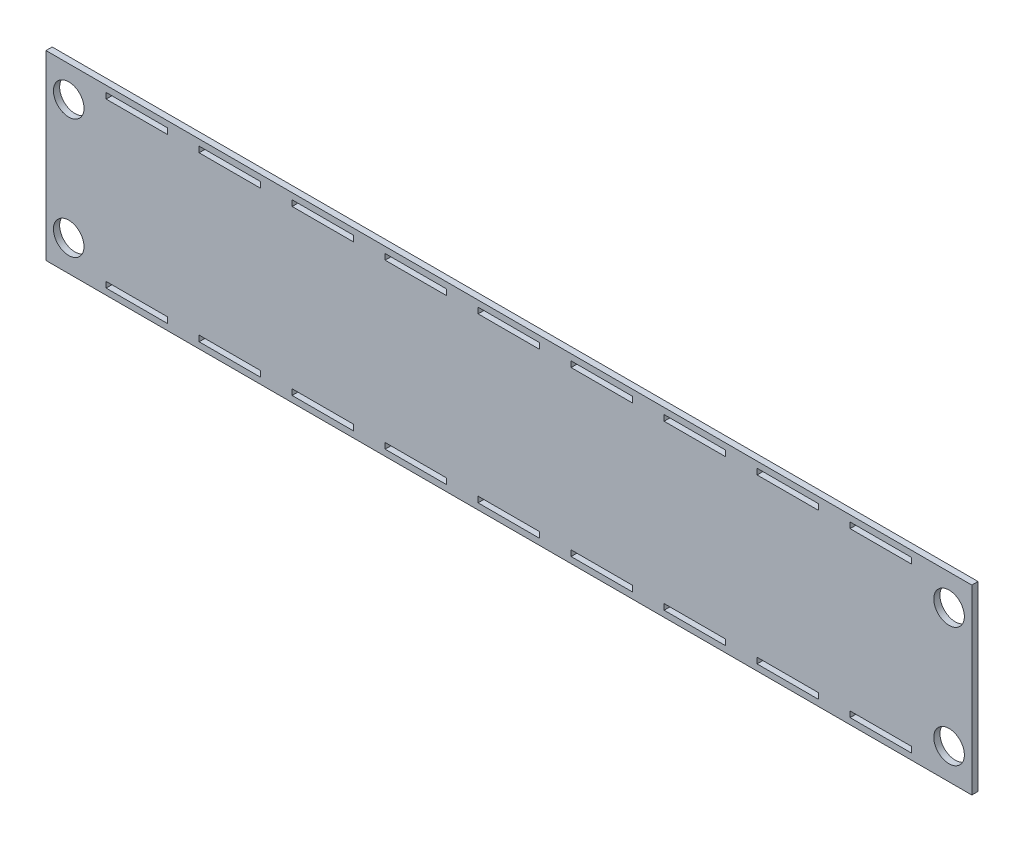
ISO-10303-21;
HEADER;
FILE_DESCRIPTION(('STEP AP214'),'2;1');
FILE_NAME('part.step','',(''),(''),'','','');
FILE_SCHEMA(('AUTOMOTIVE_DESIGN { 1 0 10303 214 1 1 1 1 }'));
ENDSEC;
DATA;
#1=APPLICATION_CONTEXT('core data for automotive mechanical design processes');
#2=APPLICATION_PROTOCOL_DEFINITION('international standard','automotive_design',2000,#1);
#3=PRODUCT_CONTEXT('',#1,'mechanical');
#4=PRODUCT('Part','Part','',(#3));
#5=PRODUCT_RELATED_PRODUCT_CATEGORY('part','',(#4));
#6=PRODUCT_DEFINITION_FORMATION('','',#4);
#7=PRODUCT_DEFINITION_CONTEXT('part definition',#1,'design');
#8=PRODUCT_DEFINITION('design','',#6,#7);
#9=PRODUCT_DEFINITION_SHAPE('','',#8);
#10=(LENGTH_UNIT() NAMED_UNIT(*) SI_UNIT(.MILLI.,.METRE.));
#11=(NAMED_UNIT(*) PLANE_ANGLE_UNIT() SI_UNIT($,.RADIAN.));
#12=(NAMED_UNIT(*) SI_UNIT($,.STERADIAN.) SOLID_ANGLE_UNIT());
#13=UNCERTAINTY_MEASURE_WITH_UNIT(LENGTH_MEASURE(1.E-05),#10,'distance_accuracy_value','');
#14=(GEOMETRIC_REPRESENTATION_CONTEXT(3) GLOBAL_UNCERTAINTY_ASSIGNED_CONTEXT((#13)) GLOBAL_UNIT_ASSIGNED_CONTEXT((#10,
#11,#12)) REPRESENTATION_CONTEXT('',''));
#15=CARTESIAN_POINT('',(0.,0.,0.));
#16=DIRECTION('',(0.,0.,1.));
#17=DIRECTION('',(1.,0.,0.));
#18=AXIS2_PLACEMENT_3D('',#15,#16,#17);
#19=CARTESIAN_POINT('',(224.,-44.,3.));
#20=DIRECTION('',(-1.,0.,0.));
#21=DIRECTION('',(0.,0.,1.));
#22=AXIS2_PLACEMENT_3D('',#19,#20,#21);
#23=PLANE('',#22);
#24=DIRECTION('',(0.,1.,0.));
#25=VECTOR('',#24,1.);
#26=CARTESIAN_POINT('',(224.,-44.,0.));
#27=LINE('',#26,#25);
#28=CARTESIAN_POINT('',(224.,-44.,0.));
#29=VERTEX_POINT('',#28);
#30=CARTESIAN_POINT('',(224.,44.,0.));
#31=VERTEX_POINT('',#30);
#32=EDGE_CURVE('E1089',#29,#31,#27,.T.);
#33=ORIENTED_EDGE('',*,*,#32,.T.);
#34=DIRECTION('',(0.,0.,-1.));
#35=VECTOR('',#34,1.);
#36=CARTESIAN_POINT('',(224.,44.,3.));
#37=LINE('',#36,#35);
#38=CARTESIAN_POINT('',(224.,44.,3.));
#39=VERTEX_POINT('',#38);
#40=EDGE_CURVE('E11',#39,#31,#37,.T.);
#41=ORIENTED_EDGE('',*,*,#40,.F.);
#42=DIRECTION('',(0.,1.,0.));
#43=VECTOR('',#42,1.);
#44=CARTESIAN_POINT('',(224.,-44.,3.));
#45=LINE('',#44,#43);
#46=CARTESIAN_POINT('',(224.,-44.,3.));
#47=VERTEX_POINT('',#46);
#48=EDGE_CURVE('E1090',#47,#39,#45,.T.);
#49=ORIENTED_EDGE('',*,*,#48,.F.);
#50=DIRECTION('',(0.,0.,-1.));
#51=VECTOR('',#50,1.);
#52=CARTESIAN_POINT('',(224.,-44.,3.));
#53=LINE('',#52,#51);
#54=EDGE_CURVE('E1100',#47,#29,#53,.T.);
#55=ORIENTED_EDGE('',*,*,#54,.T.);
#56=EDGE_LOOP('',(#33,#41,#49,#55));
#57=FACE_BOUND('',#56,.T.);
#58=ADVANCED_FACE('F32',(#57),#23,.F.);
#59=CARTESIAN_POINT('',(-224.,44.,3.));
#60=DIRECTION('',(0.,-1.,0.));
#61=DIRECTION('',(0.,0.,-1.));
#62=AXIS2_PLACEMENT_3D('',#59,#60,#61);
#63=PLANE('',#62);
#64=DIRECTION('',(-1.,0.,0.));
#65=VECTOR('',#64,1.);
#66=CARTESIAN_POINT('',(-224.,44.,0.));
#67=LINE('',#66,#65);
#68=CARTESIAN_POINT('',(-224.,44.,0.));
#69=VERTEX_POINT('',#68);
#70=EDGE_CURVE('E1103',#31,#69,#67,.T.);
#71=ORIENTED_EDGE('',*,*,#70,.T.);
#72=DIRECTION('',(0.,0.,-1.));
#73=VECTOR('',#72,1.);
#74=CARTESIAN_POINT('',(-224.,44.,3.));
#75=LINE('',#74,#73);
#76=CARTESIAN_POINT('',(-224.,44.,3.));
#77=VERTEX_POINT('',#76);
#78=EDGE_CURVE('E39',#77,#69,#75,.T.);
#79=ORIENTED_EDGE('',*,*,#78,.F.);
#80=DIRECTION('',(-1.,0.,0.));
#81=VECTOR('',#80,1.);
#82=CARTESIAN_POINT('',(-224.,44.,3.));
#83=LINE('',#82,#81);
#84=EDGE_CURVE('E1093',#39,#77,#83,.T.);
#85=ORIENTED_EDGE('',*,*,#84,.F.);
#86=ORIENTED_EDGE('',*,*,#40,.T.);
#87=EDGE_LOOP('',(#71,#79,#85,#86));
#88=FACE_BOUND('',#87,.T.);
#89=ADVANCED_FACE('F1132',(#88),#63,.F.);
#90=CARTESIAN_POINT('',(-224.,-44.,3.));
#91=DIRECTION('',(1.,0.,0.));
#92=DIRECTION('',(0.,0.,-1.));
#93=AXIS2_PLACEMENT_3D('',#90,#91,#92);
#94=PLANE('',#93);
#95=DIRECTION('',(0.,-1.,0.));
#96=VECTOR('',#95,1.);
#97=CARTESIAN_POINT('',(-224.,-44.,0.));
#98=LINE('',#97,#96);
#99=CARTESIAN_POINT('',(-224.,-44.,0.));
#100=VERTEX_POINT('',#99);
#101=EDGE_CURVE('E1105',#69,#100,#98,.T.);
#102=ORIENTED_EDGE('',*,*,#101,.T.);
#103=DIRECTION('',(0.,0.,-1.));
#104=VECTOR('',#103,1.);
#105=CARTESIAN_POINT('',(-224.,-44.,3.));
#106=LINE('',#105,#104);
#107=CARTESIAN_POINT('',(-224.,-44.,3.));
#108=VERTEX_POINT('',#107);
#109=EDGE_CURVE('E1110',#108,#100,#106,.T.);
#110=ORIENTED_EDGE('',*,*,#109,.F.);
#111=DIRECTION('',(0.,-1.,0.));
#112=VECTOR('',#111,1.);
#113=CARTESIAN_POINT('',(-224.,-44.,3.));
#114=LINE('',#113,#112);
#115=EDGE_CURVE('E1096',#77,#108,#114,.T.);
#116=ORIENTED_EDGE('',*,*,#115,.F.);
#117=ORIENTED_EDGE('',*,*,#78,.T.);
#118=EDGE_LOOP('',(#102,#110,#116,#117));
#119=FACE_BOUND('',#118,.T.);
#120=ADVANCED_FACE('F1117',(#119),#94,.F.);
#121=CARTESIAN_POINT('',(-224.,-44.,3.));
#122=DIRECTION('',(0.,1.,0.));
#123=DIRECTION('',(0.,0.,1.));
#124=AXIS2_PLACEMENT_3D('',#121,#122,#123);
#125=PLANE('',#124);
#126=DIRECTION('',(1.,0.,0.));
#127=VECTOR('',#126,1.);
#128=CARTESIAN_POINT('',(-224.,-44.,0.));
#129=LINE('',#128,#127);
#130=EDGE_CURVE('E1094',#100,#29,#129,.T.);
#131=ORIENTED_EDGE('',*,*,#130,.T.);
#132=ORIENTED_EDGE('',*,*,#54,.F.);
#133=DIRECTION('',(1.,0.,0.));
#134=VECTOR('',#133,1.);
#135=CARTESIAN_POINT('',(-224.,-44.,3.));
#136=LINE('',#135,#134);
#137=EDGE_CURVE('E1098',#108,#47,#136,.T.);
#138=ORIENTED_EDGE('',*,*,#137,.F.);
#139=ORIENTED_EDGE('',*,*,#109,.T.);
#140=EDGE_LOOP('',(#131,#132,#138,#139));
#141=FACE_BOUND('',#140,.T.);
#142=ADVANCED_FACE('F1125',(#141),#125,.F.);
#143=CARTESIAN_POINT('',(0.,0.,3.));
#144=DIRECTION('',(0.,0.,-1.));
#145=DIRECTION('',(-1.,0.,0.));
#146=AXIS2_PLACEMENT_3D('',#143,#144,#145);
#147=PLANE('',#146);
#148=CARTESIAN_POINT('',(-213.,-29.,3.));
#149=DIRECTION('',(0.,0.,1.));
#150=DIRECTION('',(1.,0.,0.));
#151=AXIS2_PLACEMENT_3D('',#148,#149,#150);
#152=CIRCLE('',#151,7.39999999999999);
#153=CARTESIAN_POINT('',(-205.6,-29.,3.));
#154=VERTEX_POINT('',#153);
#155=EDGE_CURVE('E1453',#154,#154,#152,.T.);
#156=ORIENTED_EDGE('',*,*,#155,.F.);
#157=EDGE_LOOP('',(#156));
#158=FACE_BOUND('',#157,.T.);
#159=CARTESIAN_POINT('',(213.,-29.,3.));
#160=DIRECTION('',(0.,0.,1.));
#161=DIRECTION('',(1.,0.,0.));
#162=AXIS2_PLACEMENT_3D('',#159,#160,#161);
#163=CIRCLE('',#162,7.39999999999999);
#164=CARTESIAN_POINT('',(220.4,-29.,3.));
#165=VERTEX_POINT('',#164);
#166=EDGE_CURVE('E1458',#165,#165,#163,.T.);
#167=ORIENTED_EDGE('',*,*,#166,.F.);
#168=EDGE_LOOP('',(#167));
#169=FACE_BOUND('',#168,.T.);
#170=CARTESIAN_POINT('',(213.,29.,3.));
#171=DIRECTION('',(0.,0.,1.));
#172=DIRECTION('',(1.,0.,0.));
#173=AXIS2_PLACEMENT_3D('',#170,#171,#172);
#174=CIRCLE('',#173,7.39999999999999);
#175=CARTESIAN_POINT('',(220.4,29.,3.));
#176=VERTEX_POINT('',#175);
#177=EDGE_CURVE('E1466',#176,#176,#174,.T.);
#178=ORIENTED_EDGE('',*,*,#177,.F.);
#179=EDGE_LOOP('',(#178));
#180=FACE_BOUND('',#179,.T.);
#181=CARTESIAN_POINT('',(-213.,29.,3.));
#182=DIRECTION('',(0.,0.,1.));
#183=DIRECTION('',(1.,0.,0.));
#184=AXIS2_PLACEMENT_3D('',#181,#182,#183);
#185=CIRCLE('',#184,7.39999999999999);
#186=CARTESIAN_POINT('',(-205.6,29.,3.));
#187=VERTEX_POINT('',#186);
#188=EDGE_CURVE('E650',#187,#187,#185,.T.);
#189=ORIENTED_EDGE('',*,*,#188,.F.);
#190=EDGE_LOOP('',(#189));
#191=FACE_BOUND('',#190,.T.);
#192=DIRECTION('',(-1.,0.,0.));
#193=VECTOR('',#192,1.);
#194=CARTESIAN_POINT('',(104.9,41.,3.));
#195=LINE('',#194,#193);
#196=CARTESIAN_POINT('',(104.9,41.,3.));
#197=VERTEX_POINT('',#196);
#198=CARTESIAN_POINT('',(75.0999999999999,41.,3.));
#199=VERTEX_POINT('',#198);
#200=EDGE_CURVE('E719',#197,#199,#195,.T.);
#201=ORIENTED_EDGE('',*,*,#200,.F.);
#202=DIRECTION('',(0.,1.,0.));
#203=VECTOR('',#202,1.);
#204=CARTESIAN_POINT('',(104.9,38.2,3.));
#205=LINE('',#204,#203);
#206=CARTESIAN_POINT('',(104.9,38.2,3.));
#207=VERTEX_POINT('',#206);
#208=EDGE_CURVE('E46',#207,#197,#205,.T.);
#209=ORIENTED_EDGE('',*,*,#208,.F.);
#210=DIRECTION('',(1.,0.,0.));
#211=VECTOR('',#210,1.);
#212=CARTESIAN_POINT('',(104.9,38.2,3.));
#213=LINE('',#212,#211);
#214=CARTESIAN_POINT('',(75.0999999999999,38.2,3.));
#215=VERTEX_POINT('',#214);
#216=EDGE_CURVE('E725',#215,#207,#213,.T.);
#217=ORIENTED_EDGE('',*,*,#216,.F.);
#218=DIRECTION('',(0.,-1.,0.));
#219=VECTOR('',#218,1.);
#220=CARTESIAN_POINT('',(75.0999999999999,38.2,3.));
#221=LINE('',#220,#219);
#222=EDGE_CURVE('E722',#199,#215,#221,.T.);
#223=ORIENTED_EDGE('',*,*,#222,.F.);
#224=EDGE_LOOP('',(#201,#209,#217,#223));
#225=FACE_BOUND('',#224,.T.);
#226=DIRECTION('',(-1.,0.,0.));
#227=VECTOR('',#226,1.);
#228=CARTESIAN_POINT('',(149.9,41.,3.));
#229=LINE('',#228,#227);
#230=CARTESIAN_POINT('',(149.9,41.,3.));
#231=VERTEX_POINT('',#230);
#232=CARTESIAN_POINT('',(120.1,41.,3.));
#233=VERTEX_POINT('',#232);
#234=EDGE_CURVE('E689',#231,#233,#229,.T.);
#235=ORIENTED_EDGE('',*,*,#234,.F.);
#236=DIRECTION('',(0.,1.,0.));
#237=VECTOR('',#236,1.);
#238=CARTESIAN_POINT('',(149.9,38.2,3.));
#239=LINE('',#238,#237);
#240=CARTESIAN_POINT('',(149.9,38.2,3.));
#241=VERTEX_POINT('',#240);
#242=EDGE_CURVE('E54',#241,#231,#239,.T.);
#243=ORIENTED_EDGE('',*,*,#242,.F.);
#244=DIRECTION('',(1.,0.,0.));
#245=VECTOR('',#244,1.);
#246=CARTESIAN_POINT('',(149.9,38.2,3.));
#247=LINE('',#246,#245);
#248=CARTESIAN_POINT('',(120.1,38.2,3.));
#249=VERTEX_POINT('',#248);
#250=EDGE_CURVE('E695',#249,#241,#247,.T.);
#251=ORIENTED_EDGE('',*,*,#250,.F.);
#252=DIRECTION('',(0.,-1.,0.));
#253=VECTOR('',#252,1.);
#254=CARTESIAN_POINT('',(120.1,38.2,3.));
#255=LINE('',#254,#253);
#256=EDGE_CURVE('E692',#233,#249,#255,.T.);
#257=ORIENTED_EDGE('',*,*,#256,.F.);
#258=EDGE_LOOP('',(#235,#243,#251,#257));
#259=FACE_BOUND('',#258,.T.);
#260=DIRECTION('',(-1.,0.,0.));
#261=VECTOR('',#260,1.);
#262=CARTESIAN_POINT('',(194.9,41.,3.));
#263=LINE('',#262,#261);
#264=CARTESIAN_POINT('',(194.9,41.,3.));
#265=VERTEX_POINT('',#264);
#266=CARTESIAN_POINT('',(165.1,41.,3.));
#267=VERTEX_POINT('',#266);
#268=EDGE_CURVE('E782',#265,#267,#263,.T.);
#269=ORIENTED_EDGE('',*,*,#268,.F.);
#270=DIRECTION('',(0.,1.,0.));
#271=VECTOR('',#270,1.);
#272=CARTESIAN_POINT('',(194.9,38.2,3.));
#273=LINE('',#272,#271);
#274=CARTESIAN_POINT('',(194.9,38.2,3.));
#275=VERTEX_POINT('',#274);
#276=EDGE_CURVE('E780',#275,#265,#273,.T.);
#277=ORIENTED_EDGE('',*,*,#276,.F.);
#278=DIRECTION('',(1.,0.,0.));
#279=VECTOR('',#278,1.);
#280=CARTESIAN_POINT('',(194.9,38.2,3.));
#281=LINE('',#280,#279);
#282=CARTESIAN_POINT('',(165.1,38.2,3.));
#283=VERTEX_POINT('',#282);
#284=EDGE_CURVE('E788',#283,#275,#281,.T.);
#285=ORIENTED_EDGE('',*,*,#284,.F.);
#286=DIRECTION('',(0.,-1.,0.));
#287=VECTOR('',#286,1.);
#288=CARTESIAN_POINT('',(165.1,38.2,3.));
#289=LINE('',#288,#287);
#290=EDGE_CURVE('E785',#267,#283,#289,.T.);
#291=ORIENTED_EDGE('',*,*,#290,.F.);
#292=EDGE_LOOP('',(#269,#277,#285,#291));
#293=FACE_BOUND('',#292,.T.);
#294=DIRECTION('',(0.,1.,0.));
#295=VECTOR('',#294,1.);
#296=CARTESIAN_POINT('',(-165.1,38.2,3.));
#297=LINE('',#296,#295);
#298=CARTESIAN_POINT('',(-165.1,38.2,3.));
#299=VERTEX_POINT('',#298);
#300=CARTESIAN_POINT('',(-165.1,41.,3.));
#301=VERTEX_POINT('',#300);
#302=EDGE_CURVE('E750',#299,#301,#297,.T.);
#303=ORIENTED_EDGE('',*,*,#302,.F.);
#304=DIRECTION('',(1.,0.,0.));
#305=VECTOR('',#304,1.);
#306=CARTESIAN_POINT('',(-194.9,38.2,3.));
#307=LINE('',#306,#305);
#308=CARTESIAN_POINT('',(-194.9,38.2,3.));
#309=VERTEX_POINT('',#308);
#310=EDGE_CURVE('E748',#309,#299,#307,.T.);
#311=ORIENTED_EDGE('',*,*,#310,.F.);
#312=DIRECTION('',(0.,-1.,0.));
#313=VECTOR('',#312,1.);
#314=CARTESIAN_POINT('',(-194.9,38.2,3.));
#315=LINE('',#314,#313);
#316=CARTESIAN_POINT('',(-194.9,41.,3.));
#317=VERTEX_POINT('',#316);
#318=EDGE_CURVE('E756',#317,#309,#315,.T.);
#319=ORIENTED_EDGE('',*,*,#318,.F.);
#320=DIRECTION('',(-1.,0.,0.));
#321=VECTOR('',#320,1.);
#322=CARTESIAN_POINT('',(-194.9,41.,3.));
#323=LINE('',#322,#321);
#324=EDGE_CURVE('E753',#301,#317,#323,.T.);
#325=ORIENTED_EDGE('',*,*,#324,.F.);
#326=EDGE_LOOP('',(#303,#311,#319,#325));
#327=FACE_BOUND('',#326,.T.);
#328=DIRECTION('',(-1.,0.,0.));
#329=VECTOR('',#328,1.);
#330=CARTESIAN_POINT('',(59.8999999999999,41.,3.));
#331=LINE('',#330,#329);
#332=CARTESIAN_POINT('',(59.8999999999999,41.,3.));
#333=VERTEX_POINT('',#332);
#334=CARTESIAN_POINT('',(30.0999999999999,41.,3.));
#335=VERTEX_POINT('',#334);
#336=EDGE_CURVE('E533',#333,#335,#331,.T.);
#337=ORIENTED_EDGE('',*,*,#336,.F.);
#338=DIRECTION('',(0.,1.,0.));
#339=VECTOR('',#338,1.);
#340=CARTESIAN_POINT('',(59.8999999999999,38.2,3.));
#341=LINE('',#340,#339);
#342=CARTESIAN_POINT('',(59.8999999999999,38.2,3.));
#343=VERTEX_POINT('',#342);
#344=EDGE_CURVE('E525',#343,#333,#341,.T.);
#345=ORIENTED_EDGE('',*,*,#344,.F.);
#346=DIRECTION('',(1.,0.,0.));
#347=VECTOR('',#346,1.);
#348=CARTESIAN_POINT('',(59.8999999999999,38.2,3.));
#349=LINE('',#348,#347);
#350=CARTESIAN_POINT('',(30.0999999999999,38.2,3.));
#351=VERTEX_POINT('',#350);
#352=EDGE_CURVE('E526',#351,#343,#349,.T.);
#353=ORIENTED_EDGE('',*,*,#352,.F.);
#354=DIRECTION('',(0.,-1.,0.));
#355=VECTOR('',#354,1.);
#356=CARTESIAN_POINT('',(30.0999999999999,38.2,3.));
#357=LINE('',#356,#355);
#358=EDGE_CURVE('E540',#335,#351,#357,.T.);
#359=ORIENTED_EDGE('',*,*,#358,.F.);
#360=EDGE_LOOP('',(#337,#345,#353,#359));
#361=FACE_BOUND('',#360,.T.);
#362=DIRECTION('',(0.,-1.,0.));
#363=VECTOR('',#362,1.);
#364=CARTESIAN_POINT('',(30.0999999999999,-38.2,3.));
#365=LINE('',#364,#363);
#366=CARTESIAN_POINT('',(30.0999999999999,-38.2,3.));
#367=VERTEX_POINT('',#366);
#368=CARTESIAN_POINT('',(30.0999999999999,-41.,3.));
#369=VERTEX_POINT('',#368);
#370=EDGE_CURVE('E561',#367,#369,#365,.T.);
#371=ORIENTED_EDGE('',*,*,#370,.F.);
#372=DIRECTION('',(-1.,0.,0.));
#373=VECTOR('',#372,1.);
#374=CARTESIAN_POINT('',(59.8999999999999,-38.2,3.));
#375=LINE('',#374,#373);
#376=CARTESIAN_POINT('',(59.8999999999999,-38.2,3.));
#377=VERTEX_POINT('',#376);
#378=EDGE_CURVE('E559',#377,#367,#375,.T.);
#379=ORIENTED_EDGE('',*,*,#378,.F.);
#380=DIRECTION('',(0.,1.,0.));
#381=VECTOR('',#380,1.);
#382=CARTESIAN_POINT('',(59.8999999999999,-38.2,3.));
#383=LINE('',#382,#381);
#384=CARTESIAN_POINT('',(59.8999999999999,-41.,3.));
#385=VERTEX_POINT('',#384);
#386=EDGE_CURVE('E567',#385,#377,#383,.T.);
#387=ORIENTED_EDGE('',*,*,#386,.F.);
#388=DIRECTION('',(1.,0.,0.));
#389=VECTOR('',#388,1.);
#390=CARTESIAN_POINT('',(59.8999999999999,-41.,3.));
#391=LINE('',#390,#389);
#392=EDGE_CURVE('E564',#369,#385,#391,.T.);
#393=ORIENTED_EDGE('',*,*,#392,.F.);
#394=EDGE_LOOP('',(#371,#379,#387,#393));
#395=FACE_BOUND('',#394,.T.);
#396=DIRECTION('',(0.,-1.,0.));
#397=VECTOR('',#396,1.);
#398=CARTESIAN_POINT('',(75.0999999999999,-38.2,3.));
#399=LINE('',#398,#397);
#400=CARTESIAN_POINT('',(75.0999999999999,-38.2,3.));
#401=VERTEX_POINT('',#400);
#402=CARTESIAN_POINT('',(75.0999999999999,-41.,3.));
#403=VERTEX_POINT('',#402);
#404=EDGE_CURVE('E594',#401,#403,#399,.T.);
#405=ORIENTED_EDGE('',*,*,#404,.F.);
#406=DIRECTION('',(-1.,0.,0.));
#407=VECTOR('',#406,1.);
#408=CARTESIAN_POINT('',(104.9,-38.2,3.));
#409=LINE('',#408,#407);
#410=CARTESIAN_POINT('',(104.9,-38.2,3.));
#411=VERTEX_POINT('',#410);
#412=EDGE_CURVE('E592',#411,#401,#409,.T.);
#413=ORIENTED_EDGE('',*,*,#412,.F.);
#414=DIRECTION('',(0.,1.,0.));
#415=VECTOR('',#414,1.);
#416=CARTESIAN_POINT('',(104.9,-38.2,3.));
#417=LINE('',#416,#415);
#418=CARTESIAN_POINT('',(104.9,-41.,3.));
#419=VERTEX_POINT('',#418);
#420=EDGE_CURVE('E600',#419,#411,#417,.T.);
#421=ORIENTED_EDGE('',*,*,#420,.F.);
#422=DIRECTION('',(1.,0.,0.));
#423=VECTOR('',#422,1.);
#424=CARTESIAN_POINT('',(104.9,-41.,3.));
#425=LINE('',#424,#423);
#426=EDGE_CURVE('E597',#403,#419,#425,.T.);
#427=ORIENTED_EDGE('',*,*,#426,.F.);
#428=EDGE_LOOP('',(#405,#413,#421,#427));
#429=FACE_BOUND('',#428,.T.);
#430=DIRECTION('',(0.,-1.,0.));
#431=VECTOR('',#430,1.);
#432=CARTESIAN_POINT('',(120.1,-38.2,3.));
#433=LINE('',#432,#431);
#434=CARTESIAN_POINT('',(120.1,-38.2,3.));
#435=VERTEX_POINT('',#434);
#436=CARTESIAN_POINT('',(120.1,-41.,3.));
#437=VERTEX_POINT('',#436);
#438=EDGE_CURVE('E626',#435,#437,#433,.T.);
#439=ORIENTED_EDGE('',*,*,#438,.F.);
#440=DIRECTION('',(-1.,0.,0.));
#441=VECTOR('',#440,1.);
#442=CARTESIAN_POINT('',(149.9,-38.2,3.));
#443=LINE('',#442,#441);
#444=CARTESIAN_POINT('',(149.9,-38.2,3.));
#445=VERTEX_POINT('',#444);
#446=EDGE_CURVE('E624',#445,#435,#443,.T.);
#447=ORIENTED_EDGE('',*,*,#446,.F.);
#448=DIRECTION('',(0.,1.,0.));
#449=VECTOR('',#448,1.);
#450=CARTESIAN_POINT('',(149.9,-38.2,3.));
#451=LINE('',#450,#449);
#452=CARTESIAN_POINT('',(149.9,-41.,3.));
#453=VERTEX_POINT('',#452);
#454=EDGE_CURVE('E632',#453,#445,#451,.T.);
#455=ORIENTED_EDGE('',*,*,#454,.F.);
#456=DIRECTION('',(1.,0.,0.));
#457=VECTOR('',#456,1.);
#458=CARTESIAN_POINT('',(149.9,-41.,3.));
#459=LINE('',#458,#457);
#460=EDGE_CURVE('E629',#437,#453,#459,.T.);
#461=ORIENTED_EDGE('',*,*,#460,.F.);
#462=EDGE_LOOP('',(#439,#447,#455,#461));
#463=FACE_BOUND('',#462,.T.);
#464=DIRECTION('',(0.,-1.,0.));
#465=VECTOR('',#464,1.);
#466=CARTESIAN_POINT('',(165.1,-38.2,3.));
#467=LINE('',#466,#465);
#468=CARTESIAN_POINT('',(165.1,-38.2,3.));
#469=VERTEX_POINT('',#468);
#470=CARTESIAN_POINT('',(165.1,-41.,3.));
#471=VERTEX_POINT('',#470);
#472=EDGE_CURVE('E658',#469,#471,#467,.T.);
#473=ORIENTED_EDGE('',*,*,#472,.F.);
#474=DIRECTION('',(-1.,0.,0.));
#475=VECTOR('',#474,1.);
#476=CARTESIAN_POINT('',(194.9,-38.2,3.));
#477=LINE('',#476,#475);
#478=CARTESIAN_POINT('',(194.9,-38.2,3.));
#479=VERTEX_POINT('',#478);
#480=EDGE_CURVE('E656',#479,#469,#477,.T.);
#481=ORIENTED_EDGE('',*,*,#480,.F.);
#482=DIRECTION('',(0.,1.,0.));
#483=VECTOR('',#482,1.);
#484=CARTESIAN_POINT('',(194.9,-38.2,3.));
#485=LINE('',#484,#483);
#486=CARTESIAN_POINT('',(194.9,-41.,3.));
#487=VERTEX_POINT('',#486);
#488=EDGE_CURVE('E664',#487,#479,#485,.T.);
#489=ORIENTED_EDGE('',*,*,#488,.F.);
#490=DIRECTION('',(1.,0.,0.));
#491=VECTOR('',#490,1.);
#492=CARTESIAN_POINT('',(194.9,-41.,3.));
#493=LINE('',#492,#491);
#494=EDGE_CURVE('E661',#471,#487,#493,.T.);
#495=ORIENTED_EDGE('',*,*,#494,.F.);
#496=EDGE_LOOP('',(#473,#481,#489,#495));
#497=FACE_BOUND('',#496,.T.);
#498=DIRECTION('',(0.,1.,0.));
#499=VECTOR('',#498,1.);
#500=CARTESIAN_POINT('',(-120.1,38.2,3.));
#501=LINE('',#500,#499);
#502=CARTESIAN_POINT('',(-120.1,38.2,3.));
#503=VERTEX_POINT('',#502);
#504=CARTESIAN_POINT('',(-120.1,41.,3.));
#505=VERTEX_POINT('',#504);
#506=EDGE_CURVE('E1038',#503,#505,#501,.T.);
#507=ORIENTED_EDGE('',*,*,#506,.F.);
#508=DIRECTION('',(1.,0.,0.));
#509=VECTOR('',#508,1.);
#510=CARTESIAN_POINT('',(-149.9,38.2,3.));
#511=LINE('',#510,#509);
#512=CARTESIAN_POINT('',(-149.9,38.2,3.));
#513=VERTEX_POINT('',#512);
#514=EDGE_CURVE('E1036',#513,#503,#511,.T.);
#515=ORIENTED_EDGE('',*,*,#514,.F.);
#516=DIRECTION('',(0.,-1.,0.));
#517=VECTOR('',#516,1.);
#518=CARTESIAN_POINT('',(-149.9,38.2,3.));
#519=LINE('',#518,#517);
#520=CARTESIAN_POINT('',(-149.9,41.,3.));
#521=VERTEX_POINT('',#520);
#522=EDGE_CURVE('E1044',#521,#513,#519,.T.);
#523=ORIENTED_EDGE('',*,*,#522,.F.);
#524=DIRECTION('',(-1.,0.,0.));
#525=VECTOR('',#524,1.);
#526=CARTESIAN_POINT('',(-149.9,41.,3.));
#527=LINE('',#526,#525);
#528=EDGE_CURVE('E1041',#505,#521,#527,.T.);
#529=ORIENTED_EDGE('',*,*,#528,.F.);
#530=EDGE_LOOP('',(#507,#515,#523,#529));
#531=FACE_BOUND('',#530,.T.);
#532=DIRECTION('',(0.,1.,0.));
#533=VECTOR('',#532,1.);
#534=CARTESIAN_POINT('',(-75.1,38.2,3.));
#535=LINE('',#534,#533);
#536=CARTESIAN_POINT('',(-75.1,38.2,3.));
#537=VERTEX_POINT('',#536);
#538=CARTESIAN_POINT('',(-75.1,41.,3.));
#539=VERTEX_POINT('',#538);
#540=EDGE_CURVE('E1008',#537,#539,#535,.T.);
#541=ORIENTED_EDGE('',*,*,#540,.F.);
#542=DIRECTION('',(1.,0.,0.));
#543=VECTOR('',#542,1.);
#544=CARTESIAN_POINT('',(-104.9,38.2,3.));
#545=LINE('',#544,#543);
#546=CARTESIAN_POINT('',(-104.9,38.2,3.));
#547=VERTEX_POINT('',#546);
#548=EDGE_CURVE('E1006',#547,#537,#545,.T.);
#549=ORIENTED_EDGE('',*,*,#548,.F.);
#550=DIRECTION('',(0.,-1.,0.));
#551=VECTOR('',#550,1.);
#552=CARTESIAN_POINT('',(-104.9,38.2,3.));
#553=LINE('',#552,#551);
#554=CARTESIAN_POINT('',(-104.9,41.,3.));
#555=VERTEX_POINT('',#554);
#556=EDGE_CURVE('E1014',#555,#547,#553,.T.);
#557=ORIENTED_EDGE('',*,*,#556,.F.);
#558=DIRECTION('',(-1.,0.,0.));
#559=VECTOR('',#558,1.);
#560=CARTESIAN_POINT('',(-104.9,41.,3.));
#561=LINE('',#560,#559);
#562=EDGE_CURVE('E1011',#539,#555,#561,.T.);
#563=ORIENTED_EDGE('',*,*,#562,.F.);
#564=EDGE_LOOP('',(#541,#549,#557,#563));
#565=FACE_BOUND('',#564,.T.);
#566=DIRECTION('',(0.,1.,0.));
#567=VECTOR('',#566,1.);
#568=CARTESIAN_POINT('',(-30.1,38.2,3.));
#569=LINE('',#568,#567);
#570=CARTESIAN_POINT('',(-30.1,38.2,3.));
#571=VERTEX_POINT('',#570);
#572=CARTESIAN_POINT('',(-30.1,41.,3.));
#573=VERTEX_POINT('',#572);
#574=EDGE_CURVE('E976',#571,#573,#569,.T.);
#575=ORIENTED_EDGE('',*,*,#574,.F.);
#576=DIRECTION('',(1.,0.,0.));
#577=VECTOR('',#576,1.);
#578=CARTESIAN_POINT('',(-59.9,38.2,3.));
#579=LINE('',#578,#577);
#580=CARTESIAN_POINT('',(-59.9,38.2,3.));
#581=VERTEX_POINT('',#580);
#582=EDGE_CURVE('E974',#581,#571,#579,.T.);
#583=ORIENTED_EDGE('',*,*,#582,.F.);
#584=DIRECTION('',(0.,-1.,0.));
#585=VECTOR('',#584,1.);
#586=CARTESIAN_POINT('',(-59.9,38.2,3.));
#587=LINE('',#586,#585);
#588=CARTESIAN_POINT('',(-59.9,41.,3.));
#589=VERTEX_POINT('',#588);
#590=EDGE_CURVE('E982',#589,#581,#587,.T.);
#591=ORIENTED_EDGE('',*,*,#590,.F.);
#592=DIRECTION('',(-1.,0.,0.));
#593=VECTOR('',#592,1.);
#594=CARTESIAN_POINT('',(-59.9,41.,3.));
#595=LINE('',#594,#593);
#596=EDGE_CURVE('E979',#573,#589,#595,.T.);
#597=ORIENTED_EDGE('',*,*,#596,.F.);
#598=EDGE_LOOP('',(#575,#583,#591,#597));
#599=FACE_BOUND('',#598,.T.);
#600=DIRECTION('',(0.,1.,0.));
#601=VECTOR('',#600,1.);
#602=CARTESIAN_POINT('',(14.8999999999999,38.2,3.));
#603=LINE('',#602,#601);
#604=CARTESIAN_POINT('',(14.8999999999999,38.2,3.));
#605=VERTEX_POINT('',#604);
#606=CARTESIAN_POINT('',(14.8999999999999,41.,3.));
#607=VERTEX_POINT('',#606);
#608=EDGE_CURVE('E944',#605,#607,#603,.T.);
#609=ORIENTED_EDGE('',*,*,#608,.F.);
#610=DIRECTION('',(1.,0.,0.));
#611=VECTOR('',#610,1.);
#612=CARTESIAN_POINT('',(14.8999999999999,38.2,3.));
#613=LINE('',#612,#611);
#614=CARTESIAN_POINT('',(-14.9,38.2,3.));
#615=VERTEX_POINT('',#614);
#616=EDGE_CURVE('E942',#615,#605,#613,.T.);
#617=ORIENTED_EDGE('',*,*,#616,.F.);
#618=DIRECTION('',(0.,-1.,0.));
#619=VECTOR('',#618,1.);
#620=CARTESIAN_POINT('',(-14.9,38.2,3.));
#621=LINE('',#620,#619);
#622=CARTESIAN_POINT('',(-14.9,41.,3.));
#623=VERTEX_POINT('',#622);
#624=EDGE_CURVE('E950',#623,#615,#621,.T.);
#625=ORIENTED_EDGE('',*,*,#624,.F.);
#626=DIRECTION('',(-1.,0.,0.));
#627=VECTOR('',#626,1.);
#628=CARTESIAN_POINT('',(14.8999999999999,41.,3.));
#629=LINE('',#628,#627);
#630=EDGE_CURVE('E947',#607,#623,#629,.T.);
#631=ORIENTED_EDGE('',*,*,#630,.F.);
#632=EDGE_LOOP('',(#609,#617,#625,#631));
#633=FACE_BOUND('',#632,.T.);
#634=DIRECTION('',(1.,0.,0.));
#635=VECTOR('',#634,1.);
#636=CARTESIAN_POINT('',(14.8999999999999,-41.,3.));
#637=LINE('',#636,#635);
#638=CARTESIAN_POINT('',(-14.9,-41.,3.));
#639=VERTEX_POINT('',#638);
#640=CARTESIAN_POINT('',(14.8999999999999,-41.,3.));
#641=VERTEX_POINT('',#640);
#642=EDGE_CURVE('E912',#639,#641,#637,.T.);
#643=ORIENTED_EDGE('',*,*,#642,.F.);
#644=DIRECTION('',(0.,-1.,0.));
#645=VECTOR('',#644,1.);
#646=CARTESIAN_POINT('',(-14.9,-38.2,3.));
#647=LINE('',#646,#645);
#648=CARTESIAN_POINT('',(-14.9,-38.2,3.));
#649=VERTEX_POINT('',#648);
#650=EDGE_CURVE('E910',#649,#639,#647,.T.);
#651=ORIENTED_EDGE('',*,*,#650,.F.);
#652=DIRECTION('',(-1.,0.,0.));
#653=VECTOR('',#652,1.);
#654=CARTESIAN_POINT('',(14.8999999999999,-38.2,3.));
#655=LINE('',#654,#653);
#656=CARTESIAN_POINT('',(14.8999999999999,-38.2,3.));
#657=VERTEX_POINT('',#656);
#658=EDGE_CURVE('E918',#657,#649,#655,.T.);
#659=ORIENTED_EDGE('',*,*,#658,.F.);
#660=DIRECTION('',(0.,1.,0.));
#661=VECTOR('',#660,1.);
#662=CARTESIAN_POINT('',(14.8999999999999,-38.2,3.));
#663=LINE('',#662,#661);
#664=EDGE_CURVE('E915',#641,#657,#663,.T.);
#665=ORIENTED_EDGE('',*,*,#664,.F.);
#666=EDGE_LOOP('',(#643,#651,#659,#665));
#667=FACE_BOUND('',#666,.T.);
#668=DIRECTION('',(1.,0.,0.));
#669=VECTOR('',#668,1.);
#670=CARTESIAN_POINT('',(-59.9,-41.,3.));
#671=LINE('',#670,#669);
#672=CARTESIAN_POINT('',(-59.9,-41.,3.));
#673=VERTEX_POINT('',#672);
#674=CARTESIAN_POINT('',(-30.1,-41.,3.));
#675=VERTEX_POINT('',#674);
#676=EDGE_CURVE('E880',#673,#675,#671,.T.);
#677=ORIENTED_EDGE('',*,*,#676,.F.);
#678=DIRECTION('',(0.,-1.,0.));
#679=VECTOR('',#678,1.);
#680=CARTESIAN_POINT('',(-59.9,-38.2,3.));
#681=LINE('',#680,#679);
#682=CARTESIAN_POINT('',(-59.9,-38.2,3.));
#683=VERTEX_POINT('',#682);
#684=EDGE_CURVE('E878',#683,#673,#681,.T.);
#685=ORIENTED_EDGE('',*,*,#684,.F.);
#686=DIRECTION('',(-1.,0.,0.));
#687=VECTOR('',#686,1.);
#688=CARTESIAN_POINT('',(-59.9,-38.2,3.));
#689=LINE('',#688,#687);
#690=CARTESIAN_POINT('',(-30.1,-38.2,3.));
#691=VERTEX_POINT('',#690);
#692=EDGE_CURVE('E886',#691,#683,#689,.T.);
#693=ORIENTED_EDGE('',*,*,#692,.F.);
#694=DIRECTION('',(0.,1.,0.));
#695=VECTOR('',#694,1.);
#696=CARTESIAN_POINT('',(-30.1,-38.2,3.));
#697=LINE('',#696,#695);
#698=EDGE_CURVE('E883',#675,#691,#697,.T.);
#699=ORIENTED_EDGE('',*,*,#698,.F.);
#700=EDGE_LOOP('',(#677,#685,#693,#699));
#701=FACE_BOUND('',#700,.T.);
#702=DIRECTION('',(1.,0.,0.));
#703=VECTOR('',#702,1.);
#704=CARTESIAN_POINT('',(-104.9,-41.,3.));
#705=LINE('',#704,#703);
#706=CARTESIAN_POINT('',(-104.9,-41.,3.));
#707=VERTEX_POINT('',#706);
#708=CARTESIAN_POINT('',(-75.1,-41.,3.));
#709=VERTEX_POINT('',#708);
#710=EDGE_CURVE('E848',#707,#709,#705,.T.);
#711=ORIENTED_EDGE('',*,*,#710,.F.);
#712=DIRECTION('',(0.,-1.,0.));
#713=VECTOR('',#712,1.);
#714=CARTESIAN_POINT('',(-104.9,-38.2,3.));
#715=LINE('',#714,#713);
#716=CARTESIAN_POINT('',(-104.9,-38.2,3.));
#717=VERTEX_POINT('',#716);
#718=EDGE_CURVE('E846',#717,#707,#715,.T.);
#719=ORIENTED_EDGE('',*,*,#718,.F.);
#720=DIRECTION('',(-1.,0.,0.));
#721=VECTOR('',#720,1.);
#722=CARTESIAN_POINT('',(-104.9,-38.2,3.));
#723=LINE('',#722,#721);
#724=CARTESIAN_POINT('',(-75.1,-38.2,3.));
#725=VERTEX_POINT('',#724);
#726=EDGE_CURVE('E854',#725,#717,#723,.T.);
#727=ORIENTED_EDGE('',*,*,#726,.F.);
#728=DIRECTION('',(0.,1.,0.));
#729=VECTOR('',#728,1.);
#730=CARTESIAN_POINT('',(-75.1,-38.2,3.));
#731=LINE('',#730,#729);
#732=EDGE_CURVE('E851',#709,#725,#731,.T.);
#733=ORIENTED_EDGE('',*,*,#732,.F.);
#734=EDGE_LOOP('',(#711,#719,#727,#733));
#735=FACE_BOUND('',#734,.T.);
#736=DIRECTION('',(1.,0.,0.));
#737=VECTOR('',#736,1.);
#738=CARTESIAN_POINT('',(-149.9,-41.,3.));
#739=LINE('',#738,#737);
#740=CARTESIAN_POINT('',(-149.9,-41.,3.));
#741=VERTEX_POINT('',#740);
#742=CARTESIAN_POINT('',(-120.1,-41.,3.));
#743=VERTEX_POINT('',#742);
#744=EDGE_CURVE('E814',#741,#743,#739,.T.);
#745=ORIENTED_EDGE('',*,*,#744,.F.);
#746=DIRECTION('',(0.,-1.,0.));
#747=VECTOR('',#746,1.);
#748=CARTESIAN_POINT('',(-149.9,-38.2,3.));
#749=LINE('',#748,#747);
#750=CARTESIAN_POINT('',(-149.9,-38.2,3.));
#751=VERTEX_POINT('',#750);
#752=EDGE_CURVE('E812',#751,#741,#749,.T.);
#753=ORIENTED_EDGE('',*,*,#752,.F.);
#754=DIRECTION('',(-1.,0.,0.));
#755=VECTOR('',#754,1.);
#756=CARTESIAN_POINT('',(-149.9,-38.2,3.));
#757=LINE('',#756,#755);
#758=CARTESIAN_POINT('',(-120.1,-38.2,3.));
#759=VERTEX_POINT('',#758);
#760=EDGE_CURVE('E820',#759,#751,#757,.T.);
#761=ORIENTED_EDGE('',*,*,#760,.F.);
#762=DIRECTION('',(0.,1.,0.));
#763=VECTOR('',#762,1.);
#764=CARTESIAN_POINT('',(-120.1,-38.2,3.));
#765=LINE('',#764,#763);
#766=EDGE_CURVE('E817',#743,#759,#765,.T.);
#767=ORIENTED_EDGE('',*,*,#766,.F.);
#768=EDGE_LOOP('',(#745,#753,#761,#767));
#769=FACE_BOUND('',#768,.T.);
#770=DIRECTION('',(1.,0.,0.));
#771=VECTOR('',#770,1.);
#772=CARTESIAN_POINT('',(-194.9,-41.,3.));
#773=LINE('',#772,#771);
#774=CARTESIAN_POINT('',(-194.9,-41.,3.));
#775=VERTEX_POINT('',#774);
#776=CARTESIAN_POINT('',(-165.1,-41.,3.));
#777=VERTEX_POINT('',#776);
#778=EDGE_CURVE('E1068',#775,#777,#773,.T.);
#779=ORIENTED_EDGE('',*,*,#778,.F.);
#780=DIRECTION('',(0.,-1.,0.));
#781=VECTOR('',#780,1.);
#782=CARTESIAN_POINT('',(-194.9,-38.2,3.));
#783=LINE('',#782,#781);
#784=CARTESIAN_POINT('',(-194.9,-38.2,3.));
#785=VERTEX_POINT('',#784);
#786=EDGE_CURVE('E1066',#785,#775,#783,.T.);
#787=ORIENTED_EDGE('',*,*,#786,.F.);
#788=DIRECTION('',(-1.,0.,0.));
#789=VECTOR('',#788,1.);
#790=CARTESIAN_POINT('',(-194.9,-38.2,3.));
#791=LINE('',#790,#789);
#792=CARTESIAN_POINT('',(-165.1,-38.2,3.));
#793=VERTEX_POINT('',#792);
#794=EDGE_CURVE('E1074',#793,#785,#791,.T.);
#795=ORIENTED_EDGE('',*,*,#794,.F.);
#796=DIRECTION('',(0.,1.,0.));
#797=VECTOR('',#796,1.);
#798=CARTESIAN_POINT('',(-165.1,-38.2,3.));
#799=LINE('',#798,#797);
#800=EDGE_CURVE('E1071',#777,#793,#799,.T.);
#801=ORIENTED_EDGE('',*,*,#800,.F.);
#802=EDGE_LOOP('',(#779,#787,#795,#801));
#803=FACE_BOUND('',#802,.T.);
#804=ORIENTED_EDGE('',*,*,#48,.T.);
#805=ORIENTED_EDGE('',*,*,#84,.T.);
#806=ORIENTED_EDGE('',*,*,#115,.T.);
#807=ORIENTED_EDGE('',*,*,#137,.T.);
#808=EDGE_LOOP('',(#804,#805,#806,#807));
#809=FACE_BOUND('',#808,.T.);
#810=ADVANCED_FACE('F1131',(#158,#169,#180,#191,#225,#259,#293,#327,#361,#395,#429,#463,#497,
#531,#565,#599,#633,#667,#701,#735,#769,#803,#809),#147,.F.);
#811=CARTESIAN_POINT('',(0.,0.,0.));
#812=DIRECTION('',(0.,0.,-1.));
#813=DIRECTION('',(-1.,0.,0.));
#814=AXIS2_PLACEMENT_3D('',#811,#812,#813);
#815=PLANE('',#814);
#816=CARTESIAN_POINT('',(-213.,-29.,0.));
#817=DIRECTION('',(0.,0.,-1.));
#818=DIRECTION('',(-1.,0.,0.));
#819=AXIS2_PLACEMENT_3D('',#816,#817,#818);
#820=CIRCLE('',#819,7.39999999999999);
#821=CARTESIAN_POINT('',(-205.6,-29.,0.));
#822=VERTEX_POINT('',#821);
#823=EDGE_CURVE('E1450',#822,#822,#820,.F.);
#824=ORIENTED_EDGE('',*,*,#823,.T.);
#825=EDGE_LOOP('',(#824));
#826=FACE_BOUND('',#825,.T.);
#827=CARTESIAN_POINT('',(213.,-29.,0.));
#828=DIRECTION('',(0.,0.,-1.));
#829=DIRECTION('',(-1.,0.,0.));
#830=AXIS2_PLACEMENT_3D('',#827,#828,#829);
#831=CIRCLE('',#830,7.39999999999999);
#832=CARTESIAN_POINT('',(220.4,-29.,0.));
#833=VERTEX_POINT('',#832);
#834=EDGE_CURVE('E1463',#833,#833,#831,.F.);
#835=ORIENTED_EDGE('',*,*,#834,.T.);
#836=EDGE_LOOP('',(#835));
#837=FACE_BOUND('',#836,.T.);
#838=CARTESIAN_POINT('',(213.,29.,0.));
#839=DIRECTION('',(0.,0.,-1.));
#840=DIRECTION('',(-1.,0.,0.));
#841=AXIS2_PLACEMENT_3D('',#838,#839,#840);
#842=CIRCLE('',#841,7.39999999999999);
#843=CARTESIAN_POINT('',(220.4,29.,0.));
#844=VERTEX_POINT('',#843);
#845=EDGE_CURVE('E1469',#844,#844,#842,.F.);
#846=ORIENTED_EDGE('',*,*,#845,.T.);
#847=EDGE_LOOP('',(#846));
#848=FACE_BOUND('',#847,.T.);
#849=CARTESIAN_POINT('',(-213.,29.,0.));
#850=DIRECTION('',(0.,0.,-1.));
#851=DIRECTION('',(-1.,0.,0.));
#852=AXIS2_PLACEMENT_3D('',#849,#850,#851);
#853=CIRCLE('',#852,7.39999999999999);
#854=CARTESIAN_POINT('',(-205.6,29.,0.));
#855=VERTEX_POINT('',#854);
#856=EDGE_CURVE('E1454',#855,#855,#853,.F.);
#857=ORIENTED_EDGE('',*,*,#856,.T.);
#858=EDGE_LOOP('',(#857));
#859=FACE_BOUND('',#858,.T.);
#860=DIRECTION('',(0.,1.,0.));
#861=VECTOR('',#860,1.);
#862=CARTESIAN_POINT('',(104.9,38.2,0.));
#863=LINE('',#862,#861);
#864=CARTESIAN_POINT('',(104.9,38.2,0.));
#865=VERTEX_POINT('',#864);
#866=CARTESIAN_POINT('',(104.9,41.,0.));
#867=VERTEX_POINT('',#866);
#868=EDGE_CURVE('E715',#865,#867,#863,.T.);
#869=ORIENTED_EDGE('',*,*,#868,.T.);
#870=DIRECTION('',(-1.,0.,0.));
#871=VECTOR('',#870,1.);
#872=CARTESIAN_POINT('',(104.9,41.,0.));
#873=LINE('',#872,#871);
#874=CARTESIAN_POINT('',(75.0999999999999,41.,0.));
#875=VERTEX_POINT('',#874);
#876=EDGE_CURVE('E682',#867,#875,#873,.T.);
#877=ORIENTED_EDGE('',*,*,#876,.T.);
#878=DIRECTION('',(0.,-1.,0.));
#879=VECTOR('',#878,1.);
#880=CARTESIAN_POINT('',(75.0999999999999,38.2,0.));
#881=LINE('',#880,#879);
#882=CARTESIAN_POINT('',(75.0999999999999,38.2,0.));
#883=VERTEX_POINT('',#882);
#884=EDGE_CURVE('E517',#875,#883,#881,.T.);
#885=ORIENTED_EDGE('',*,*,#884,.T.);
#886=DIRECTION('',(1.,0.,0.));
#887=VECTOR('',#886,1.);
#888=CARTESIAN_POINT('',(104.9,38.2,0.));
#889=LINE('',#888,#887);
#890=EDGE_CURVE('E712',#883,#865,#889,.T.);
#891=ORIENTED_EDGE('',*,*,#890,.T.);
#892=EDGE_LOOP('',(#869,#877,#885,#891));
#893=FACE_BOUND('',#892,.T.);
#894=DIRECTION('',(0.,1.,0.));
#895=VECTOR('',#894,1.);
#896=CARTESIAN_POINT('',(149.9,38.2,0.));
#897=LINE('',#896,#895);
#898=CARTESIAN_POINT('',(149.9,38.2,0.));
#899=VERTEX_POINT('',#898);
#900=CARTESIAN_POINT('',(149.9,41.,0.));
#901=VERTEX_POINT('',#900);
#902=EDGE_CURVE('E685',#899,#901,#897,.T.);
#903=ORIENTED_EDGE('',*,*,#902,.T.);
#904=DIRECTION('',(-1.,0.,0.));
#905=VECTOR('',#904,1.);
#906=CARTESIAN_POINT('',(149.9,41.,0.));
#907=LINE('',#906,#905);
#908=CARTESIAN_POINT('',(120.1,41.,0.));
#909=VERTEX_POINT('',#908);
#910=EDGE_CURVE('E701',#901,#909,#907,.T.);
#911=ORIENTED_EDGE('',*,*,#910,.T.);
#912=DIRECTION('',(0.,-1.,0.));
#913=VECTOR('',#912,1.);
#914=CARTESIAN_POINT('',(120.1,38.2,0.));
#915=LINE('',#914,#913);
#916=CARTESIAN_POINT('',(120.1,38.2,0.));
#917=VERTEX_POINT('',#916);
#918=EDGE_CURVE('E678',#909,#917,#915,.T.);
#919=ORIENTED_EDGE('',*,*,#918,.T.);
#920=DIRECTION('',(1.,0.,0.));
#921=VECTOR('',#920,1.);
#922=CARTESIAN_POINT('',(149.9,38.2,0.));
#923=LINE('',#922,#921);
#924=EDGE_CURVE('E681',#917,#899,#923,.T.);
#925=ORIENTED_EDGE('',*,*,#924,.T.);
#926=EDGE_LOOP('',(#903,#911,#919,#925));
#927=FACE_BOUND('',#926,.T.);
#928=DIRECTION('',(0.,1.,0.));
#929=VECTOR('',#928,1.);
#930=CARTESIAN_POINT('',(194.9,38.2,0.));
#931=LINE('',#930,#929);
#932=CARTESIAN_POINT('',(194.9,38.2,0.));
#933=VERTEX_POINT('',#932);
#934=CARTESIAN_POINT('',(194.9,41.,0.));
#935=VERTEX_POINT('',#934);
#936=EDGE_CURVE('E777',#933,#935,#931,.T.);
#937=ORIENTED_EDGE('',*,*,#936,.T.);
#938=DIRECTION('',(-1.,0.,0.));
#939=VECTOR('',#938,1.);
#940=CARTESIAN_POINT('',(194.9,41.,0.));
#941=LINE('',#940,#939);
#942=CARTESIAN_POINT('',(165.1,41.,0.));
#943=VERTEX_POINT('',#942);
#944=EDGE_CURVE('E742',#935,#943,#941,.T.);
#945=ORIENTED_EDGE('',*,*,#944,.T.);
#946=DIRECTION('',(0.,-1.,0.));
#947=VECTOR('',#946,1.);
#948=CARTESIAN_POINT('',(165.1,38.2,0.));
#949=LINE('',#948,#947);
#950=CARTESIAN_POINT('',(165.1,38.2,0.));
#951=VERTEX_POINT('',#950);
#952=EDGE_CURVE('E709',#943,#951,#949,.T.);
#953=ORIENTED_EDGE('',*,*,#952,.T.);
#954=DIRECTION('',(1.,0.,0.));
#955=VECTOR('',#954,1.);
#956=CARTESIAN_POINT('',(194.9,38.2,0.));
#957=LINE('',#956,#955);
#958=EDGE_CURVE('E774',#951,#933,#957,.T.);
#959=ORIENTED_EDGE('',*,*,#958,.T.);
#960=EDGE_LOOP('',(#937,#945,#953,#959));
#961=FACE_BOUND('',#960,.T.);
#962=DIRECTION('',(1.,0.,0.));
#963=VECTOR('',#962,1.);
#964=CARTESIAN_POINT('',(-194.9,38.2,0.));
#965=LINE('',#964,#963);
#966=CARTESIAN_POINT('',(-194.9,38.2,0.));
#967=VERTEX_POINT('',#966);
#968=CARTESIAN_POINT('',(-165.1,38.2,0.));
#969=VERTEX_POINT('',#968);
#970=EDGE_CURVE('E745',#967,#969,#965,.T.);
#971=ORIENTED_EDGE('',*,*,#970,.T.);
#972=DIRECTION('',(0.,1.,0.));
#973=VECTOR('',#972,1.);
#974=CARTESIAN_POINT('',(-165.1,38.2,0.));
#975=LINE('',#974,#973);
#976=CARTESIAN_POINT('',(-165.1,41.,0.));
#977=VERTEX_POINT('',#976);
#978=EDGE_CURVE('E762',#969,#977,#975,.T.);
#979=ORIENTED_EDGE('',*,*,#978,.T.);
#980=DIRECTION('',(-1.,0.,0.));
#981=VECTOR('',#980,1.);
#982=CARTESIAN_POINT('',(-194.9,41.,0.));
#983=LINE('',#982,#981);
#984=CARTESIAN_POINT('',(-194.9,41.,0.));
#985=VERTEX_POINT('',#984);
#986=EDGE_CURVE('E738',#977,#985,#983,.T.);
#987=ORIENTED_EDGE('',*,*,#986,.T.);
#988=DIRECTION('',(0.,-1.,0.));
#989=VECTOR('',#988,1.);
#990=CARTESIAN_POINT('',(-194.9,38.2,0.));
#991=LINE('',#990,#989);
#992=EDGE_CURVE('E741',#985,#967,#991,.T.);
#993=ORIENTED_EDGE('',*,*,#992,.T.);
#994=EDGE_LOOP('',(#971,#979,#987,#993));
#995=FACE_BOUND('',#994,.T.);
#996=DIRECTION('',(0.,1.,0.));
#997=VECTOR('',#996,1.);
#998=CARTESIAN_POINT('',(59.8999999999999,38.2,0.));
#999=LINE('',#998,#997);
#1000=CARTESIAN_POINT('',(59.8999999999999,38.2,0.));
#1001=VERTEX_POINT('',#1000);
#1002=CARTESIAN_POINT('',(59.8999999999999,41.,0.));
#1003=VERTEX_POINT('',#1002);
#1004=EDGE_CURVE('E522',#1001,#1003,#999,.T.);
#1005=ORIENTED_EDGE('',*,*,#1004,.T.);
#1006=DIRECTION('',(-1.,0.,0.));
#1007=VECTOR('',#1006,1.);
#1008=CARTESIAN_POINT('',(59.8999999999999,41.,0.));
#1009=LINE('',#1008,#1007);
#1010=CARTESIAN_POINT('',(30.0999999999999,41.,0.));
#1011=VERTEX_POINT('',#1010);
#1012=EDGE_CURVE('E506',#1003,#1011,#1009,.T.);
#1013=ORIENTED_EDGE('',*,*,#1012,.T.);
#1014=DIRECTION('',(0.,-1.,0.));
#1015=VECTOR('',#1014,1.);
#1016=CARTESIAN_POINT('',(30.0999999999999,38.2,0.));
#1017=LINE('',#1016,#1015);
#1018=CARTESIAN_POINT('',(30.0999999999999,38.2,0.));
#1019=VERTEX_POINT('',#1018);
#1020=EDGE_CURVE('E535',#1011,#1019,#1017,.T.);
#1021=ORIENTED_EDGE('',*,*,#1020,.T.);
#1022=DIRECTION('',(1.,0.,0.));
#1023=VECTOR('',#1022,1.);
#1024=CARTESIAN_POINT('',(59.8999999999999,38.2,0.));
#1025=LINE('',#1024,#1023);
#1026=EDGE_CURVE('E531',#1019,#1001,#1025,.T.);
#1027=ORIENTED_EDGE('',*,*,#1026,.T.);
#1028=EDGE_LOOP('',(#1005,#1013,#1021,#1027));
#1029=FACE_BOUND('',#1028,.T.);
#1030=DIRECTION('',(-1.,0.,0.));
#1031=VECTOR('',#1030,1.);
#1032=CARTESIAN_POINT('',(59.8999999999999,-38.2,0.));
#1033=LINE('',#1032,#1031);
#1034=CARTESIAN_POINT('',(59.8999999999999,-38.2,0.));
#1035=VERTEX_POINT('',#1034);
#1036=CARTESIAN_POINT('',(30.0999999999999,-38.2,0.));
#1037=VERTEX_POINT('',#1036);
#1038=EDGE_CURVE('E556',#1035,#1037,#1033,.T.);
#1039=ORIENTED_EDGE('',*,*,#1038,.T.);
#1040=DIRECTION('',(0.,-1.,0.));
#1041=VECTOR('',#1040,1.);
#1042=CARTESIAN_POINT('',(30.0999999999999,-38.2,0.));
#1043=LINE('',#1042,#1041);
#1044=CARTESIAN_POINT('',(30.0999999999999,-41.,0.));
#1045=VERTEX_POINT('',#1044);
#1046=EDGE_CURVE('E573',#1037,#1045,#1043,.T.);
#1047=ORIENTED_EDGE('',*,*,#1046,.T.);
#1048=DIRECTION('',(1.,0.,0.));
#1049=VECTOR('',#1048,1.);
#1050=CARTESIAN_POINT('',(59.8999999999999,-41.,0.));
#1051=LINE('',#1050,#1049);
#1052=CARTESIAN_POINT('',(59.8999999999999,-41.,0.));
#1053=VERTEX_POINT('',#1052);
#1054=EDGE_CURVE('E549',#1045,#1053,#1051,.T.);
#1055=ORIENTED_EDGE('',*,*,#1054,.T.);
#1056=DIRECTION('',(0.,1.,0.));
#1057=VECTOR('',#1056,1.);
#1058=CARTESIAN_POINT('',(59.8999999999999,-38.2,0.));
#1059=LINE('',#1058,#1057);
#1060=EDGE_CURVE('E552',#1053,#1035,#1059,.T.);
#1061=ORIENTED_EDGE('',*,*,#1060,.T.);
#1062=EDGE_LOOP('',(#1039,#1047,#1055,#1061));
#1063=FACE_BOUND('',#1062,.T.);
#1064=DIRECTION('',(-1.,0.,0.));
#1065=VECTOR('',#1064,1.);
#1066=CARTESIAN_POINT('',(104.9,-38.2,0.));
#1067=LINE('',#1066,#1065);
#1068=CARTESIAN_POINT('',(104.9,-38.2,0.));
#1069=VERTEX_POINT('',#1068);
#1070=CARTESIAN_POINT('',(75.0999999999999,-38.2,0.));
#1071=VERTEX_POINT('',#1070);
#1072=EDGE_CURVE('E589',#1069,#1071,#1067,.T.);
#1073=ORIENTED_EDGE('',*,*,#1072,.T.);
#1074=DIRECTION('',(0.,-1.,0.));
#1075=VECTOR('',#1074,1.);
#1076=CARTESIAN_POINT('',(75.0999999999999,-38.2,0.));
#1077=LINE('',#1076,#1075);
#1078=CARTESIAN_POINT('',(75.0999999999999,-41.,0.));
#1079=VERTEX_POINT('',#1078);
#1080=EDGE_CURVE('E553',#1071,#1079,#1077,.T.);
#1081=ORIENTED_EDGE('',*,*,#1080,.T.);
#1082=DIRECTION('',(1.,0.,0.));
#1083=VECTOR('',#1082,1.);
#1084=CARTESIAN_POINT('',(104.9,-41.,0.));
#1085=LINE('',#1084,#1083);
#1086=CARTESIAN_POINT('',(104.9,-41.,0.));
#1087=VERTEX_POINT('',#1086);
#1088=EDGE_CURVE('E582',#1079,#1087,#1085,.T.);
#1089=ORIENTED_EDGE('',*,*,#1088,.T.);
#1090=DIRECTION('',(0.,1.,0.));
#1091=VECTOR('',#1090,1.);
#1092=CARTESIAN_POINT('',(104.9,-38.2,0.));
#1093=LINE('',#1092,#1091);
#1094=EDGE_CURVE('E585',#1087,#1069,#1093,.T.);
#1095=ORIENTED_EDGE('',*,*,#1094,.T.);
#1096=EDGE_LOOP('',(#1073,#1081,#1089,#1095));
#1097=FACE_BOUND('',#1096,.T.);
#1098=DIRECTION('',(-1.,0.,0.));
#1099=VECTOR('',#1098,1.);
#1100=CARTESIAN_POINT('',(149.9,-38.2,0.));
#1101=LINE('',#1100,#1099);
#1102=CARTESIAN_POINT('',(149.9,-38.2,0.));
#1103=VERTEX_POINT('',#1102);
#1104=CARTESIAN_POINT('',(120.1,-38.2,0.));
#1105=VERTEX_POINT('',#1104);
#1106=EDGE_CURVE('E621',#1103,#1105,#1101,.T.);
#1107=ORIENTED_EDGE('',*,*,#1106,.T.);
#1108=DIRECTION('',(0.,-1.,0.));
#1109=VECTOR('',#1108,1.);
#1110=CARTESIAN_POINT('',(120.1,-38.2,0.));
#1111=LINE('',#1110,#1109);
#1112=CARTESIAN_POINT('',(120.1,-41.,0.));
#1113=VERTEX_POINT('',#1112);
#1114=EDGE_CURVE('E586',#1105,#1113,#1111,.T.);
#1115=ORIENTED_EDGE('',*,*,#1114,.T.);
#1116=DIRECTION('',(1.,0.,0.));
#1117=VECTOR('',#1116,1.);
#1118=CARTESIAN_POINT('',(149.9,-41.,0.));
#1119=LINE('',#1118,#1117);
#1120=CARTESIAN_POINT('',(149.9,-41.,0.));
#1121=VERTEX_POINT('',#1120);
#1122=EDGE_CURVE('E614',#1113,#1121,#1119,.T.);
#1123=ORIENTED_EDGE('',*,*,#1122,.T.);
#1124=DIRECTION('',(0.,1.,0.));
#1125=VECTOR('',#1124,1.);
#1126=CARTESIAN_POINT('',(149.9,-38.2,0.));
#1127=LINE('',#1126,#1125);
#1128=EDGE_CURVE('E617',#1121,#1103,#1127,.T.);
#1129=ORIENTED_EDGE('',*,*,#1128,.T.);
#1130=EDGE_LOOP('',(#1107,#1115,#1123,#1129));
#1131=FACE_BOUND('',#1130,.T.);
#1132=DIRECTION('',(-1.,0.,0.));
#1133=VECTOR('',#1132,1.);
#1134=CARTESIAN_POINT('',(194.9,-38.2,0.));
#1135=LINE('',#1134,#1133);
#1136=CARTESIAN_POINT('',(194.9,-38.2,0.));
#1137=VERTEX_POINT('',#1136);
#1138=CARTESIAN_POINT('',(165.1,-38.2,0.));
#1139=VERTEX_POINT('',#1138);
#1140=EDGE_CURVE('E653',#1137,#1139,#1135,.T.);
#1141=ORIENTED_EDGE('',*,*,#1140,.T.);
#1142=DIRECTION('',(0.,-1.,0.));
#1143=VECTOR('',#1142,1.);
#1144=CARTESIAN_POINT('',(165.1,-38.2,0.));
#1145=LINE('',#1144,#1143);
#1146=CARTESIAN_POINT('',(165.1,-41.,0.));
#1147=VERTEX_POINT('',#1146);
#1148=EDGE_CURVE('E618',#1139,#1147,#1145,.T.);
#1149=ORIENTED_EDGE('',*,*,#1148,.T.);
#1150=DIRECTION('',(1.,0.,0.));
#1151=VECTOR('',#1150,1.);
#1152=CARTESIAN_POINT('',(194.9,-41.,0.));
#1153=LINE('',#1152,#1151);
#1154=CARTESIAN_POINT('',(194.9,-41.,0.));
#1155=VERTEX_POINT('',#1154);
#1156=EDGE_CURVE('E646',#1147,#1155,#1153,.T.);
#1157=ORIENTED_EDGE('',*,*,#1156,.T.);
#1158=DIRECTION('',(0.,1.,0.));
#1159=VECTOR('',#1158,1.);
#1160=CARTESIAN_POINT('',(194.9,-38.2,0.));
#1161=LINE('',#1160,#1159);
#1162=EDGE_CURVE('E649',#1155,#1137,#1161,.T.);
#1163=ORIENTED_EDGE('',*,*,#1162,.T.);
#1164=EDGE_LOOP('',(#1141,#1149,#1157,#1163));
#1165=FACE_BOUND('',#1164,.T.);
#1166=DIRECTION('',(1.,0.,0.));
#1167=VECTOR('',#1166,1.);
#1168=CARTESIAN_POINT('',(-149.9,38.2,0.));
#1169=LINE('',#1168,#1167);
#1170=CARTESIAN_POINT('',(-149.9,38.2,0.));
#1171=VERTEX_POINT('',#1170);
#1172=CARTESIAN_POINT('',(-120.1,38.2,0.));
#1173=VERTEX_POINT('',#1172);
#1174=EDGE_CURVE('E1033',#1171,#1173,#1169,.T.);
#1175=ORIENTED_EDGE('',*,*,#1174,.T.);
#1176=DIRECTION('',(0.,1.,0.));
#1177=VECTOR('',#1176,1.);
#1178=CARTESIAN_POINT('',(-120.1,38.2,0.));
#1179=LINE('',#1178,#1177);
#1180=CARTESIAN_POINT('',(-120.1,41.,0.));
#1181=VERTEX_POINT('',#1180);
#1182=EDGE_CURVE('E1000',#1173,#1181,#1179,.T.);
#1183=ORIENTED_EDGE('',*,*,#1182,.T.);
#1184=DIRECTION('',(-1.,0.,0.));
#1185=VECTOR('',#1184,1.);
#1186=CARTESIAN_POINT('',(-149.9,41.,0.));
#1187=LINE('',#1186,#1185);
#1188=CARTESIAN_POINT('',(-149.9,41.,0.));
#1189=VERTEX_POINT('',#1188);
#1190=EDGE_CURVE('E771',#1181,#1189,#1187,.T.);
#1191=ORIENTED_EDGE('',*,*,#1190,.T.);
#1192=DIRECTION('',(0.,-1.,0.));
#1193=VECTOR('',#1192,1.);
#1194=CARTESIAN_POINT('',(-149.9,38.2,0.));
#1195=LINE('',#1194,#1193);
#1196=EDGE_CURVE('E1030',#1189,#1171,#1195,.T.);
#1197=ORIENTED_EDGE('',*,*,#1196,.T.);
#1198=EDGE_LOOP('',(#1175,#1183,#1191,#1197));
#1199=FACE_BOUND('',#1198,.T.);
#1200=DIRECTION('',(1.,0.,0.));
#1201=VECTOR('',#1200,1.);
#1202=CARTESIAN_POINT('',(-104.9,38.2,0.));
#1203=LINE('',#1202,#1201);
#1204=CARTESIAN_POINT('',(-104.9,38.2,0.));
#1205=VERTEX_POINT('',#1204);
#1206=CARTESIAN_POINT('',(-75.1,38.2,0.));
#1207=VERTEX_POINT('',#1206);
#1208=EDGE_CURVE('E1003',#1205,#1207,#1203,.T.);
#1209=ORIENTED_EDGE('',*,*,#1208,.T.);
#1210=DIRECTION('',(0.,1.,0.));
#1211=VECTOR('',#1210,1.);
#1212=CARTESIAN_POINT('',(-75.1,38.2,0.));
#1213=LINE('',#1212,#1211);
#1214=CARTESIAN_POINT('',(-75.1,41.,0.));
#1215=VERTEX_POINT('',#1214);
#1216=EDGE_CURVE('E968',#1207,#1215,#1213,.T.);
#1217=ORIENTED_EDGE('',*,*,#1216,.T.);
#1218=DIRECTION('',(-1.,0.,0.));
#1219=VECTOR('',#1218,1.);
#1220=CARTESIAN_POINT('',(-104.9,41.,0.));
#1221=LINE('',#1220,#1219);
#1222=CARTESIAN_POINT('',(-104.9,41.,0.));
#1223=VERTEX_POINT('',#1222);
#1224=EDGE_CURVE('E996',#1215,#1223,#1221,.T.);
#1225=ORIENTED_EDGE('',*,*,#1224,.T.);
#1226=DIRECTION('',(0.,-1.,0.));
#1227=VECTOR('',#1226,1.);
#1228=CARTESIAN_POINT('',(-104.9,38.2,0.));
#1229=LINE('',#1228,#1227);
#1230=EDGE_CURVE('E999',#1223,#1205,#1229,.T.);
#1231=ORIENTED_EDGE('',*,*,#1230,.T.);
#1232=EDGE_LOOP('',(#1209,#1217,#1225,#1231));
#1233=FACE_BOUND('',#1232,.T.);
#1234=DIRECTION('',(1.,0.,0.));
#1235=VECTOR('',#1234,1.);
#1236=CARTESIAN_POINT('',(-59.9,38.2,0.));
#1237=LINE('',#1236,#1235);
#1238=CARTESIAN_POINT('',(-59.9,38.2,0.));
#1239=VERTEX_POINT('',#1238);
#1240=CARTESIAN_POINT('',(-30.1,38.2,0.));
#1241=VERTEX_POINT('',#1240);
#1242=EDGE_CURVE('E971',#1239,#1241,#1237,.T.);
#1243=ORIENTED_EDGE('',*,*,#1242,.T.);
#1244=DIRECTION('',(0.,1.,0.));
#1245=VECTOR('',#1244,1.);
#1246=CARTESIAN_POINT('',(-30.1,38.2,0.));
#1247=LINE('',#1246,#1245);
#1248=CARTESIAN_POINT('',(-30.1,41.,0.));
#1249=VERTEX_POINT('',#1248);
#1250=EDGE_CURVE('E936',#1241,#1249,#1247,.T.);
#1251=ORIENTED_EDGE('',*,*,#1250,.T.);
#1252=DIRECTION('',(-1.,0.,0.));
#1253=VECTOR('',#1252,1.);
#1254=CARTESIAN_POINT('',(-59.9,41.,0.));
#1255=LINE('',#1254,#1253);
#1256=CARTESIAN_POINT('',(-59.9,41.,0.));
#1257=VERTEX_POINT('',#1256);
#1258=EDGE_CURVE('E964',#1249,#1257,#1255,.T.);
#1259=ORIENTED_EDGE('',*,*,#1258,.T.);
#1260=DIRECTION('',(0.,-1.,0.));
#1261=VECTOR('',#1260,1.);
#1262=CARTESIAN_POINT('',(-59.9,38.2,0.));
#1263=LINE('',#1262,#1261);
#1264=EDGE_CURVE('E967',#1257,#1239,#1263,.T.);
#1265=ORIENTED_EDGE('',*,*,#1264,.T.);
#1266=EDGE_LOOP('',(#1243,#1251,#1259,#1265));
#1267=FACE_BOUND('',#1266,.T.);
#1268=DIRECTION('',(1.,0.,0.));
#1269=VECTOR('',#1268,1.);
#1270=CARTESIAN_POINT('',(14.8999999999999,38.2,0.));
#1271=LINE('',#1270,#1269);
#1272=CARTESIAN_POINT('',(-14.9,38.2,0.));
#1273=VERTEX_POINT('',#1272);
#1274=CARTESIAN_POINT('',(14.8999999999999,38.2,0.));
#1275=VERTEX_POINT('',#1274);
#1276=EDGE_CURVE('E939',#1273,#1275,#1271,.T.);
#1277=ORIENTED_EDGE('',*,*,#1276,.T.);
#1278=DIRECTION('',(0.,1.,0.));
#1279=VECTOR('',#1278,1.);
#1280=CARTESIAN_POINT('',(14.8999999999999,38.2,0.));
#1281=LINE('',#1280,#1279);
#1282=CARTESIAN_POINT('',(14.8999999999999,41.,0.));
#1283=VERTEX_POINT('',#1282);
#1284=EDGE_CURVE('E904',#1275,#1283,#1281,.T.);
#1285=ORIENTED_EDGE('',*,*,#1284,.T.);
#1286=DIRECTION('',(-1.,0.,0.));
#1287=VECTOR('',#1286,1.);
#1288=CARTESIAN_POINT('',(14.8999999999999,41.,0.));
#1289=LINE('',#1288,#1287);
#1290=CARTESIAN_POINT('',(-14.9,41.,0.));
#1291=VERTEX_POINT('',#1290);
#1292=EDGE_CURVE('E932',#1283,#1291,#1289,.T.);
#1293=ORIENTED_EDGE('',*,*,#1292,.T.);
#1294=DIRECTION('',(0.,-1.,0.));
#1295=VECTOR('',#1294,1.);
#1296=CARTESIAN_POINT('',(-14.9,38.2,0.));
#1297=LINE('',#1296,#1295);
#1298=EDGE_CURVE('E935',#1291,#1273,#1297,.T.);
#1299=ORIENTED_EDGE('',*,*,#1298,.T.);
#1300=EDGE_LOOP('',(#1277,#1285,#1293,#1299));
#1301=FACE_BOUND('',#1300,.T.);
#1302=DIRECTION('',(0.,-1.,0.));
#1303=VECTOR('',#1302,1.);
#1304=CARTESIAN_POINT('',(-14.9,-38.2,0.));
#1305=LINE('',#1304,#1303);
#1306=CARTESIAN_POINT('',(-14.9,-38.2,0.));
#1307=VERTEX_POINT('',#1306);
#1308=CARTESIAN_POINT('',(-14.9,-41.,0.));
#1309=VERTEX_POINT('',#1308);
#1310=EDGE_CURVE('E907',#1307,#1309,#1305,.T.);
#1311=ORIENTED_EDGE('',*,*,#1310,.T.);
#1312=DIRECTION('',(1.,0.,0.));
#1313=VECTOR('',#1312,1.);
#1314=CARTESIAN_POINT('',(14.8999999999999,-41.,0.));
#1315=LINE('',#1314,#1313);
#1316=CARTESIAN_POINT('',(14.8999999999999,-41.,0.));
#1317=VERTEX_POINT('',#1316);
#1318=EDGE_CURVE('E872',#1309,#1317,#1315,.T.);
#1319=ORIENTED_EDGE('',*,*,#1318,.T.);
#1320=DIRECTION('',(0.,1.,0.));
#1321=VECTOR('',#1320,1.);
#1322=CARTESIAN_POINT('',(14.8999999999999,-38.2,0.));
#1323=LINE('',#1322,#1321);
#1324=CARTESIAN_POINT('',(14.8999999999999,-38.2,0.));
#1325=VERTEX_POINT('',#1324);
#1326=EDGE_CURVE('E900',#1317,#1325,#1323,.T.);
#1327=ORIENTED_EDGE('',*,*,#1326,.T.);
#1328=DIRECTION('',(-1.,0.,0.));
#1329=VECTOR('',#1328,1.);
#1330=CARTESIAN_POINT('',(14.8999999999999,-38.2,0.));
#1331=LINE('',#1330,#1329);
#1332=EDGE_CURVE('E903',#1325,#1307,#1331,.T.);
#1333=ORIENTED_EDGE('',*,*,#1332,.T.);
#1334=EDGE_LOOP('',(#1311,#1319,#1327,#1333));
#1335=FACE_BOUND('',#1334,.T.);
#1336=DIRECTION('',(0.,-1.,0.));
#1337=VECTOR('',#1336,1.);
#1338=CARTESIAN_POINT('',(-59.9,-38.2,0.));
#1339=LINE('',#1338,#1337);
#1340=CARTESIAN_POINT('',(-59.9,-38.2,0.));
#1341=VERTEX_POINT('',#1340);
#1342=CARTESIAN_POINT('',(-59.9,-41.,0.));
#1343=VERTEX_POINT('',#1342);
#1344=EDGE_CURVE('E875',#1341,#1343,#1339,.T.);
#1345=ORIENTED_EDGE('',*,*,#1344,.T.);
#1346=DIRECTION('',(1.,0.,0.));
#1347=VECTOR('',#1346,1.);
#1348=CARTESIAN_POINT('',(-59.9,-41.,0.));
#1349=LINE('',#1348,#1347);
#1350=CARTESIAN_POINT('',(-30.1,-41.,0.));
#1351=VERTEX_POINT('',#1350);
#1352=EDGE_CURVE('E840',#1343,#1351,#1349,.T.);
#1353=ORIENTED_EDGE('',*,*,#1352,.T.);
#1354=DIRECTION('',(0.,1.,0.));
#1355=VECTOR('',#1354,1.);
#1356=CARTESIAN_POINT('',(-30.1,-38.2,0.));
#1357=LINE('',#1356,#1355);
#1358=CARTESIAN_POINT('',(-30.1,-38.2,0.));
#1359=VERTEX_POINT('',#1358);
#1360=EDGE_CURVE('E868',#1351,#1359,#1357,.T.);
#1361=ORIENTED_EDGE('',*,*,#1360,.T.);
#1362=DIRECTION('',(-1.,0.,0.));
#1363=VECTOR('',#1362,1.);
#1364=CARTESIAN_POINT('',(-59.9,-38.2,0.));
#1365=LINE('',#1364,#1363);
#1366=EDGE_CURVE('E871',#1359,#1341,#1365,.T.);
#1367=ORIENTED_EDGE('',*,*,#1366,.T.);
#1368=EDGE_LOOP('',(#1345,#1353,#1361,#1367));
#1369=FACE_BOUND('',#1368,.T.);
#1370=DIRECTION('',(0.,-1.,0.));
#1371=VECTOR('',#1370,1.);
#1372=CARTESIAN_POINT('',(-104.9,-38.2,0.));
#1373=LINE('',#1372,#1371);
#1374=CARTESIAN_POINT('',(-104.9,-38.2,0.));
#1375=VERTEX_POINT('',#1374);
#1376=CARTESIAN_POINT('',(-104.9,-41.,0.));
#1377=VERTEX_POINT('',#1376);
#1378=EDGE_CURVE('E843',#1375,#1377,#1373,.T.);
#1379=ORIENTED_EDGE('',*,*,#1378,.T.);
#1380=DIRECTION('',(1.,0.,0.));
#1381=VECTOR('',#1380,1.);
#1382=CARTESIAN_POINT('',(-104.9,-41.,0.));
#1383=LINE('',#1382,#1381);
#1384=CARTESIAN_POINT('',(-75.1,-41.,0.));
#1385=VERTEX_POINT('',#1384);
#1386=EDGE_CURVE('E806',#1377,#1385,#1383,.T.);
#1387=ORIENTED_EDGE('',*,*,#1386,.T.);
#1388=DIRECTION('',(0.,1.,0.));
#1389=VECTOR('',#1388,1.);
#1390=CARTESIAN_POINT('',(-75.1,-38.2,0.));
#1391=LINE('',#1390,#1389);
#1392=CARTESIAN_POINT('',(-75.1,-38.2,0.));
#1393=VERTEX_POINT('',#1392);
#1394=EDGE_CURVE('E836',#1385,#1393,#1391,.T.);
#1395=ORIENTED_EDGE('',*,*,#1394,.T.);
#1396=DIRECTION('',(-1.,0.,0.));
#1397=VECTOR('',#1396,1.);
#1398=CARTESIAN_POINT('',(-104.9,-38.2,0.));
#1399=LINE('',#1398,#1397);
#1400=EDGE_CURVE('E839',#1393,#1375,#1399,.T.);
#1401=ORIENTED_EDGE('',*,*,#1400,.T.);
#1402=EDGE_LOOP('',(#1379,#1387,#1395,#1401));
#1403=FACE_BOUND('',#1402,.T.);
#1404=DIRECTION('',(0.,-1.,0.));
#1405=VECTOR('',#1404,1.);
#1406=CARTESIAN_POINT('',(-149.9,-38.2,0.));
#1407=LINE('',#1406,#1405);
#1408=CARTESIAN_POINT('',(-149.9,-38.2,0.));
#1409=VERTEX_POINT('',#1408);
#1410=CARTESIAN_POINT('',(-149.9,-41.,0.));
#1411=VERTEX_POINT('',#1410);
#1412=EDGE_CURVE('E809',#1409,#1411,#1407,.T.);
#1413=ORIENTED_EDGE('',*,*,#1412,.T.);
#1414=DIRECTION('',(1.,0.,0.));
#1415=VECTOR('',#1414,1.);
#1416=CARTESIAN_POINT('',(-149.9,-41.,0.));
#1417=LINE('',#1416,#1415);
#1418=CARTESIAN_POINT('',(-120.1,-41.,0.));
#1419=VERTEX_POINT('',#1418);
#1420=EDGE_CURVE('E826',#1411,#1419,#1417,.T.);
#1421=ORIENTED_EDGE('',*,*,#1420,.T.);
#1422=DIRECTION('',(0.,1.,0.));
#1423=VECTOR('',#1422,1.);
#1424=CARTESIAN_POINT('',(-120.1,-38.2,0.));
#1425=LINE('',#1424,#1423);
#1426=CARTESIAN_POINT('',(-120.1,-38.2,0.));
#1427=VERTEX_POINT('',#1426);
#1428=EDGE_CURVE('E802',#1419,#1427,#1425,.T.);
#1429=ORIENTED_EDGE('',*,*,#1428,.T.);
#1430=DIRECTION('',(-1.,0.,0.));
#1431=VECTOR('',#1430,1.);
#1432=CARTESIAN_POINT('',(-149.9,-38.2,0.));
#1433=LINE('',#1432,#1431);
#1434=EDGE_CURVE('E805',#1427,#1409,#1433,.T.);
#1435=ORIENTED_EDGE('',*,*,#1434,.T.);
#1436=EDGE_LOOP('',(#1413,#1421,#1429,#1435));
#1437=FACE_BOUND('',#1436,.T.);
#1438=DIRECTION('',(0.,-1.,0.));
#1439=VECTOR('',#1438,1.);
#1440=CARTESIAN_POINT('',(-194.9,-38.2,0.));
#1441=LINE('',#1440,#1439);
#1442=CARTESIAN_POINT('',(-194.9,-38.2,0.));
#1443=VERTEX_POINT('',#1442);
#1444=CARTESIAN_POINT('',(-194.9,-41.,0.));
#1445=VERTEX_POINT('',#1444);
#1446=EDGE_CURVE('E1063',#1443,#1445,#1441,.T.);
#1447=ORIENTED_EDGE('',*,*,#1446,.T.);
#1448=DIRECTION('',(1.,0.,0.));
#1449=VECTOR('',#1448,1.);
#1450=CARTESIAN_POINT('',(-194.9,-41.,0.));
#1451=LINE('',#1450,#1449);
#1452=CARTESIAN_POINT('',(-165.1,-41.,0.));
#1453=VERTEX_POINT('',#1452);
#1454=EDGE_CURVE('E1080',#1445,#1453,#1451,.T.);
#1455=ORIENTED_EDGE('',*,*,#1454,.T.);
#1456=DIRECTION('',(0.,1.,0.));
#1457=VECTOR('',#1456,1.);
#1458=CARTESIAN_POINT('',(-165.1,-38.2,0.));
#1459=LINE('',#1458,#1457);
#1460=CARTESIAN_POINT('',(-165.1,-38.2,0.));
#1461=VERTEX_POINT('',#1460);
#1462=EDGE_CURVE('E835',#1453,#1461,#1459,.T.);
#1463=ORIENTED_EDGE('',*,*,#1462,.T.);
#1464=DIRECTION('',(-1.,0.,0.));
#1465=VECTOR('',#1464,1.);
#1466=CARTESIAN_POINT('',(-194.9,-38.2,0.));
#1467=LINE('',#1466,#1465);
#1468=EDGE_CURVE('E1060',#1461,#1443,#1467,.T.);
#1469=ORIENTED_EDGE('',*,*,#1468,.T.);
#1470=EDGE_LOOP('',(#1447,#1455,#1463,#1469));
#1471=FACE_BOUND('',#1470,.T.);
#1472=ORIENTED_EDGE('',*,*,#32,.F.);
#1473=ORIENTED_EDGE('',*,*,#130,.F.);
#1474=ORIENTED_EDGE('',*,*,#101,.F.);
#1475=ORIENTED_EDGE('',*,*,#70,.F.);
#1476=EDGE_LOOP('',(#1472,#1473,#1474,#1475));
#1477=FACE_BOUND('',#1476,.T.);
#1478=ADVANCED_FACE('F529',(#826,#837,#848,#859,#893,#927,#961,#995,#1029,#1063,#1097,#1131,
#1165,#1199,#1233,#1267,#1301,#1335,#1369,#1403,#1437,#1471,#1477),#815,.T.);
#1479=CARTESIAN_POINT('',(-194.9,-38.2,-0.00100000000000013));
#1480=DIRECTION('',(-1.,0.,0.));
#1481=DIRECTION('',(0.,0.,1.));
#1482=AXIS2_PLACEMENT_3D('',#1479,#1480,#1481);
#1483=PLANE('',#1482);
#1484=DIRECTION('',(0.,0.,1.));
#1485=VECTOR('',#1484,1.);
#1486=CARTESIAN_POINT('',(-194.9,-38.2,-0.00100000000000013));
#1487=LINE('',#1486,#1485);
#1488=EDGE_CURVE('E1078',#1443,#785,#1487,.T.);
#1489=ORIENTED_EDGE('',*,*,#1488,.T.);
#1490=ORIENTED_EDGE('',*,*,#786,.T.);
#1491=DIRECTION('',(0.,0.,1.));
#1492=VECTOR('',#1491,1.);
#1493=CARTESIAN_POINT('',(-194.9,-41.,-0.00100000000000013));
#1494=LINE('',#1493,#1492);
#1495=EDGE_CURVE('E1077',#1445,#775,#1494,.T.);
#1496=ORIENTED_EDGE('',*,*,#1495,.F.);
#1497=ORIENTED_EDGE('',*,*,#1446,.F.);
#1498=EDGE_LOOP('',(#1489,#1490,#1496,#1497));
#1499=FACE_BOUND('',#1498,.T.);
#1500=ADVANCED_FACE('F1144',(#1499),#1483,.F.);
#1501=CARTESIAN_POINT('',(-194.9,-38.2,-0.00100000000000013));
#1502=DIRECTION('',(0.,1.,0.));
#1503=DIRECTION('',(-1.,0.,0.));
#1504=AXIS2_PLACEMENT_3D('',#1501,#1502,#1503);
#1505=PLANE('',#1504);
#1506=DIRECTION('',(0.,0.,1.));
#1507=VECTOR('',#1506,1.);
#1508=CARTESIAN_POINT('',(-165.1,-38.2,-0.00100000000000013));
#1509=LINE('',#1508,#1507);
#1510=EDGE_CURVE('E1081',#1461,#793,#1509,.T.);
#1511=ORIENTED_EDGE('',*,*,#1510,.T.);
#1512=ORIENTED_EDGE('',*,*,#794,.T.);
#1513=ORIENTED_EDGE('',*,*,#1488,.F.);
#1514=ORIENTED_EDGE('',*,*,#1468,.F.);
#1515=EDGE_LOOP('',(#1511,#1512,#1513,#1514));
#1516=FACE_BOUND('',#1515,.T.);
#1517=ADVANCED_FACE('F1151',(#1516),#1505,.F.);
#1518=CARTESIAN_POINT('',(-165.1,-38.2,-0.00100000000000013));
#1519=DIRECTION('',(1.,0.,0.));
#1520=DIRECTION('',(0.,0.,-1.));
#1521=AXIS2_PLACEMENT_3D('',#1518,#1519,#1520);
#1522=PLANE('',#1521);
#1523=DIRECTION('',(0.,0.,1.));
#1524=VECTOR('',#1523,1.);
#1525=CARTESIAN_POINT('',(-165.1,-41.,-0.00100000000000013));
#1526=LINE('',#1525,#1524);
#1527=EDGE_CURVE('E1083',#1453,#777,#1526,.T.);
#1528=ORIENTED_EDGE('',*,*,#1527,.T.);
#1529=ORIENTED_EDGE('',*,*,#800,.T.);
#1530=ORIENTED_EDGE('',*,*,#1510,.F.);
#1531=ORIENTED_EDGE('',*,*,#1462,.F.);
#1532=EDGE_LOOP('',(#1528,#1529,#1530,#1531));
#1533=FACE_BOUND('',#1532,.T.);
#1534=ADVANCED_FACE('F1157',(#1533),#1522,.F.);
#1535=CARTESIAN_POINT('',(-194.9,-41.,-0.00100000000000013));
#1536=DIRECTION('',(0.,-1.,0.));
#1537=DIRECTION('',(1.,0.,0.));
#1538=AXIS2_PLACEMENT_3D('',#1535,#1536,#1537);
#1539=PLANE('',#1538);
#1540=ORIENTED_EDGE('',*,*,#1495,.T.);
#1541=ORIENTED_EDGE('',*,*,#778,.T.);
#1542=ORIENTED_EDGE('',*,*,#1527,.F.);
#1543=ORIENTED_EDGE('',*,*,#1454,.F.);
#1544=EDGE_LOOP('',(#1540,#1541,#1542,#1543));
#1545=FACE_BOUND('',#1544,.T.);
#1546=ADVANCED_FACE('F1153',(#1545),#1539,.F.);
#1547=CARTESIAN_POINT('',(-149.9,-38.2,-0.00100000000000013));
#1548=DIRECTION('',(-1.,0.,0.));
#1549=DIRECTION('',(0.,-1.,0.));
#1550=AXIS2_PLACEMENT_3D('',#1547,#1548,#1549);
#1551=PLANE('',#1550);
#1552=DIRECTION('',(0.,0.,1.));
#1553=VECTOR('',#1552,1.);
#1554=CARTESIAN_POINT('',(-149.9,-38.2,-0.00100000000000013));
#1555=LINE('',#1554,#1553);
#1556=EDGE_CURVE('E824',#1409,#751,#1555,.T.);
#1557=ORIENTED_EDGE('',*,*,#1556,.T.);
#1558=ORIENTED_EDGE('',*,*,#752,.T.);
#1559=DIRECTION('',(0.,0.,1.));
#1560=VECTOR('',#1559,1.);
#1561=CARTESIAN_POINT('',(-149.9,-41.,-0.00100000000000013));
#1562=LINE('',#1561,#1560);
#1563=EDGE_CURVE('E823',#1411,#741,#1562,.T.);
#1564=ORIENTED_EDGE('',*,*,#1563,.F.);
#1565=ORIENTED_EDGE('',*,*,#1412,.F.);
#1566=EDGE_LOOP('',(#1557,#1558,#1564,#1565));
#1567=FACE_BOUND('',#1566,.T.);
#1568=ADVANCED_FACE('F1156',(#1567),#1551,.F.);
#1569=CARTESIAN_POINT('',(-149.9,-38.2,-0.00100000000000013));
#1570=DIRECTION('',(0.,1.,0.));
#1571=DIRECTION('',(-1.,0.,0.));
#1572=AXIS2_PLACEMENT_3D('',#1569,#1570,#1571);
#1573=PLANE('',#1572);
#1574=DIRECTION('',(0.,0.,1.));
#1575=VECTOR('',#1574,1.);
#1576=CARTESIAN_POINT('',(-120.1,-38.2,-0.00100000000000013));
#1577=LINE('',#1576,#1575);
#1578=EDGE_CURVE('E827',#1427,#759,#1577,.T.);
#1579=ORIENTED_EDGE('',*,*,#1578,.T.);
#1580=ORIENTED_EDGE('',*,*,#760,.T.);
#1581=ORIENTED_EDGE('',*,*,#1556,.F.);
#1582=ORIENTED_EDGE('',*,*,#1434,.F.);
#1583=EDGE_LOOP('',(#1579,#1580,#1581,#1582));
#1584=FACE_BOUND('',#1583,.T.);
#1585=ADVANCED_FACE('F1281',(#1584),#1573,.F.);
#1586=CARTESIAN_POINT('',(-120.1,-38.2,-0.00100000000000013));
#1587=DIRECTION('',(1.,0.,0.));
#1588=DIRECTION('',(0.,1.,0.));
#1589=AXIS2_PLACEMENT_3D('',#1586,#1587,#1588);
#1590=PLANE('',#1589);
#1591=DIRECTION('',(0.,0.,1.));
#1592=VECTOR('',#1591,1.);
#1593=CARTESIAN_POINT('',(-120.1,-41.,-0.00100000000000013));
#1594=LINE('',#1593,#1592);
#1595=EDGE_CURVE('E829',#1419,#743,#1594,.T.);
#1596=ORIENTED_EDGE('',*,*,#1595,.T.);
#1597=ORIENTED_EDGE('',*,*,#766,.T.);
#1598=ORIENTED_EDGE('',*,*,#1578,.F.);
#1599=ORIENTED_EDGE('',*,*,#1428,.F.);
#1600=EDGE_LOOP('',(#1596,#1597,#1598,#1599));
#1601=FACE_BOUND('',#1600,.T.);
#1602=ADVANCED_FACE('F1285',(#1601),#1590,.F.);
#1603=CARTESIAN_POINT('',(-149.9,-41.,-0.00100000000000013));
#1604=DIRECTION('',(0.,-1.,0.));
#1605=DIRECTION('',(1.,0.,0.));
#1606=AXIS2_PLACEMENT_3D('',#1603,#1604,#1605);
#1607=PLANE('',#1606);
#1608=ORIENTED_EDGE('',*,*,#1563,.T.);
#1609=ORIENTED_EDGE('',*,*,#744,.T.);
#1610=ORIENTED_EDGE('',*,*,#1595,.F.);
#1611=ORIENTED_EDGE('',*,*,#1420,.F.);
#1612=EDGE_LOOP('',(#1608,#1609,#1610,#1611));
#1613=FACE_BOUND('',#1612,.T.);
#1614=ADVANCED_FACE('F1267',(#1613),#1607,.F.);
#1615=CARTESIAN_POINT('',(-104.9,-38.2,-0.00100000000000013));
#1616=DIRECTION('',(-1.,0.,0.));
#1617=DIRECTION('',(0.,-1.,0.));
#1618=AXIS2_PLACEMENT_3D('',#1615,#1616,#1617);
#1619=PLANE('',#1618);
#1620=DIRECTION('',(0.,0.,1.));
#1621=VECTOR('',#1620,1.);
#1622=CARTESIAN_POINT('',(-104.9,-38.2,-0.00100000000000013));
#1623=LINE('',#1622,#1621);
#1624=EDGE_CURVE('E858',#1375,#717,#1623,.T.);
#1625=ORIENTED_EDGE('',*,*,#1624,.T.);
#1626=ORIENTED_EDGE('',*,*,#718,.T.);
#1627=DIRECTION('',(0.,0.,1.));
#1628=VECTOR('',#1627,1.);
#1629=CARTESIAN_POINT('',(-104.9,-41.,-0.00100000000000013));
#1630=LINE('',#1629,#1628);
#1631=EDGE_CURVE('E857',#1377,#707,#1630,.T.);
#1632=ORIENTED_EDGE('',*,*,#1631,.F.);
#1633=ORIENTED_EDGE('',*,*,#1378,.F.);
#1634=EDGE_LOOP('',(#1625,#1626,#1632,#1633));
#1635=FACE_BOUND('',#1634,.T.);
#1636=ADVANCED_FACE('F1263',(#1635),#1619,.F.);
#1637=CARTESIAN_POINT('',(-104.9,-38.2,-0.00100000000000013));
#1638=DIRECTION('',(0.,1.,0.));
#1639=DIRECTION('',(-1.,0.,0.));
#1640=AXIS2_PLACEMENT_3D('',#1637,#1638,#1639);
#1641=PLANE('',#1640);
#1642=DIRECTION('',(0.,0.,1.));
#1643=VECTOR('',#1642,1.);
#1644=CARTESIAN_POINT('',(-75.1,-38.2,-0.00100000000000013));
#1645=LINE('',#1644,#1643);
#1646=EDGE_CURVE('E860',#1393,#725,#1645,.T.);
#1647=ORIENTED_EDGE('',*,*,#1646,.T.);
#1648=ORIENTED_EDGE('',*,*,#726,.T.);
#1649=ORIENTED_EDGE('',*,*,#1624,.F.);
#1650=ORIENTED_EDGE('',*,*,#1400,.F.);
#1651=EDGE_LOOP('',(#1647,#1648,#1649,#1650));
#1652=FACE_BOUND('',#1651,.T.);
#1653=ADVANCED_FACE('F1266',(#1652),#1641,.F.);
#1654=CARTESIAN_POINT('',(-75.1,-38.2,-0.00100000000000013));
#1655=DIRECTION('',(1.,0.,0.));
#1656=DIRECTION('',(0.,1.,0.));
#1657=AXIS2_PLACEMENT_3D('',#1654,#1655,#1656);
#1658=PLANE('',#1657);
#1659=DIRECTION('',(0.,0.,1.));
#1660=VECTOR('',#1659,1.);
#1661=CARTESIAN_POINT('',(-75.1,-41.,-0.00100000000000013));
#1662=LINE('',#1661,#1660);
#1663=EDGE_CURVE('E862',#1385,#709,#1662,.T.);
#1664=ORIENTED_EDGE('',*,*,#1663,.T.);
#1665=ORIENTED_EDGE('',*,*,#732,.T.);
#1666=ORIENTED_EDGE('',*,*,#1646,.F.);
#1667=ORIENTED_EDGE('',*,*,#1394,.F.);
#1668=EDGE_LOOP('',(#1664,#1665,#1666,#1667));
#1669=FACE_BOUND('',#1668,.T.);
#1670=ADVANCED_FACE('F1271',(#1669),#1658,.F.);
#1671=CARTESIAN_POINT('',(-104.9,-41.,-0.00100000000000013));
#1672=DIRECTION('',(0.,-1.,0.));
#1673=DIRECTION('',(1.,0.,0.));
#1674=AXIS2_PLACEMENT_3D('',#1671,#1672,#1673);
#1675=PLANE('',#1674);
#1676=ORIENTED_EDGE('',*,*,#1631,.T.);
#1677=ORIENTED_EDGE('',*,*,#710,.T.);
#1678=ORIENTED_EDGE('',*,*,#1663,.F.);
#1679=ORIENTED_EDGE('',*,*,#1386,.F.);
#1680=EDGE_LOOP('',(#1676,#1677,#1678,#1679));
#1681=FACE_BOUND('',#1680,.T.);
#1682=ADVANCED_FACE('F1251',(#1681),#1675,.F.);
#1683=CARTESIAN_POINT('',(-59.9,-38.2,-0.00100000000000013));
#1684=DIRECTION('',(-1.,0.,0.));
#1685=DIRECTION('',(0.,-1.,0.));
#1686=AXIS2_PLACEMENT_3D('',#1683,#1684,#1685);
#1687=PLANE('',#1686);
#1688=DIRECTION('',(0.,0.,1.));
#1689=VECTOR('',#1688,1.);
#1690=CARTESIAN_POINT('',(-59.9,-38.2,-0.00100000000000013));
#1691=LINE('',#1690,#1689);
#1692=EDGE_CURVE('E890',#1341,#683,#1691,.T.);
#1693=ORIENTED_EDGE('',*,*,#1692,.T.);
#1694=ORIENTED_EDGE('',*,*,#684,.T.);
#1695=DIRECTION('',(0.,0.,1.));
#1696=VECTOR('',#1695,1.);
#1697=CARTESIAN_POINT('',(-59.9,-41.,-0.00100000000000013));
#1698=LINE('',#1697,#1696);
#1699=EDGE_CURVE('E889',#1343,#673,#1698,.T.);
#1700=ORIENTED_EDGE('',*,*,#1699,.F.);
#1701=ORIENTED_EDGE('',*,*,#1344,.F.);
#1702=EDGE_LOOP('',(#1693,#1694,#1700,#1701));
#1703=FACE_BOUND('',#1702,.T.);
#1704=ADVANCED_FACE('F1247',(#1703),#1687,.F.);
#1705=CARTESIAN_POINT('',(-59.9,-38.2,-0.00100000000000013));
#1706=DIRECTION('',(0.,1.,0.));
#1707=DIRECTION('',(-1.,0.,0.));
#1708=AXIS2_PLACEMENT_3D('',#1705,#1706,#1707);
#1709=PLANE('',#1708);
#1710=DIRECTION('',(0.,0.,1.));
#1711=VECTOR('',#1710,1.);
#1712=CARTESIAN_POINT('',(-30.1,-38.2,-0.00100000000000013));
#1713=LINE('',#1712,#1711);
#1714=EDGE_CURVE('E892',#1359,#691,#1713,.T.);
#1715=ORIENTED_EDGE('',*,*,#1714,.T.);
#1716=ORIENTED_EDGE('',*,*,#692,.T.);
#1717=ORIENTED_EDGE('',*,*,#1692,.F.);
#1718=ORIENTED_EDGE('',*,*,#1366,.F.);
#1719=EDGE_LOOP('',(#1715,#1716,#1717,#1718));
#1720=FACE_BOUND('',#1719,.T.);
#1721=ADVANCED_FACE('F1250',(#1720),#1709,.F.);
#1722=CARTESIAN_POINT('',(-30.1,-38.2,-0.00100000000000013));
#1723=DIRECTION('',(1.,0.,0.));
#1724=DIRECTION('',(0.,0.,-1.));
#1725=AXIS2_PLACEMENT_3D('',#1722,#1723,#1724);
#1726=PLANE('',#1725);
#1727=DIRECTION('',(0.,0.,1.));
#1728=VECTOR('',#1727,1.);
#1729=CARTESIAN_POINT('',(-30.1,-41.,-0.00100000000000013));
#1730=LINE('',#1729,#1728);
#1731=EDGE_CURVE('E894',#1351,#675,#1730,.T.);
#1732=ORIENTED_EDGE('',*,*,#1731,.T.);
#1733=ORIENTED_EDGE('',*,*,#698,.T.);
#1734=ORIENTED_EDGE('',*,*,#1714,.F.);
#1735=ORIENTED_EDGE('',*,*,#1360,.F.);
#1736=EDGE_LOOP('',(#1732,#1733,#1734,#1735));
#1737=FACE_BOUND('',#1736,.T.);
#1738=ADVANCED_FACE('F1255',(#1737),#1726,.F.);
#1739=CARTESIAN_POINT('',(-59.9,-41.,-0.00100000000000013));
#1740=DIRECTION('',(0.,-1.,0.));
#1741=DIRECTION('',(1.,0.,0.));
#1742=AXIS2_PLACEMENT_3D('',#1739,#1740,#1741);
#1743=PLANE('',#1742);
#1744=ORIENTED_EDGE('',*,*,#1699,.T.);
#1745=ORIENTED_EDGE('',*,*,#676,.T.);
#1746=ORIENTED_EDGE('',*,*,#1731,.F.);
#1747=ORIENTED_EDGE('',*,*,#1352,.F.);
#1748=EDGE_LOOP('',(#1744,#1745,#1746,#1747));
#1749=FACE_BOUND('',#1748,.T.);
#1750=ADVANCED_FACE('F1235',(#1749),#1743,.F.);
#1751=CARTESIAN_POINT('',(-14.9,-38.2,-0.00100000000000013));
#1752=DIRECTION('',(-1.,0.,0.));
#1753=DIRECTION('',(0.,0.,1.));
#1754=AXIS2_PLACEMENT_3D('',#1751,#1752,#1753);
#1755=PLANE('',#1754);
#1756=DIRECTION('',(0.,0.,1.));
#1757=VECTOR('',#1756,1.);
#1758=CARTESIAN_POINT('',(-14.9,-38.2,-0.00100000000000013));
#1759=LINE('',#1758,#1757);
#1760=EDGE_CURVE('E922',#1307,#649,#1759,.T.);
#1761=ORIENTED_EDGE('',*,*,#1760,.T.);
#1762=ORIENTED_EDGE('',*,*,#650,.T.);
#1763=DIRECTION('',(0.,0.,1.));
#1764=VECTOR('',#1763,1.);
#1765=CARTESIAN_POINT('',(-14.9,-41.,-0.00100000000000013));
#1766=LINE('',#1765,#1764);
#1767=EDGE_CURVE('E921',#1309,#639,#1766,.T.);
#1768=ORIENTED_EDGE('',*,*,#1767,.F.);
#1769=ORIENTED_EDGE('',*,*,#1310,.F.);
#1770=EDGE_LOOP('',(#1761,#1762,#1768,#1769));
#1771=FACE_BOUND('',#1770,.T.);
#1772=ADVANCED_FACE('F1231',(#1771),#1755,.F.);
#1773=CARTESIAN_POINT('',(14.8999999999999,-38.2,-0.00100000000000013));
#1774=DIRECTION('',(0.,1.,0.));
#1775=DIRECTION('',(0.,0.,1.));
#1776=AXIS2_PLACEMENT_3D('',#1773,#1774,#1775);
#1777=PLANE('',#1776);
#1778=DIRECTION('',(0.,0.,1.));
#1779=VECTOR('',#1778,1.);
#1780=CARTESIAN_POINT('',(14.8999999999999,-38.2,-0.00100000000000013));
#1781=LINE('',#1780,#1779);
#1782=EDGE_CURVE('E924',#1325,#657,#1781,.T.);
#1783=ORIENTED_EDGE('',*,*,#1782,.T.);
#1784=ORIENTED_EDGE('',*,*,#658,.T.);
#1785=ORIENTED_EDGE('',*,*,#1760,.F.);
#1786=ORIENTED_EDGE('',*,*,#1332,.F.);
#1787=EDGE_LOOP('',(#1783,#1784,#1785,#1786));
#1788=FACE_BOUND('',#1787,.T.);
#1789=ADVANCED_FACE('F1234',(#1788),#1777,.F.);
#1790=CARTESIAN_POINT('',(14.8999999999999,-38.2,-0.00100000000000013));
#1791=DIRECTION('',(1.,0.,0.));
#1792=DIRECTION('',(0.,0.,-1.));
#1793=AXIS2_PLACEMENT_3D('',#1790,#1791,#1792);
#1794=PLANE('',#1793);
#1795=DIRECTION('',(0.,0.,1.));
#1796=VECTOR('',#1795,1.);
#1797=CARTESIAN_POINT('',(14.8999999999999,-41.,-0.00100000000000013));
#1798=LINE('',#1797,#1796);
#1799=EDGE_CURVE('E926',#1317,#641,#1798,.T.);
#1800=ORIENTED_EDGE('',*,*,#1799,.T.);
#1801=ORIENTED_EDGE('',*,*,#664,.T.);
#1802=ORIENTED_EDGE('',*,*,#1782,.F.);
#1803=ORIENTED_EDGE('',*,*,#1326,.F.);
#1804=EDGE_LOOP('',(#1800,#1801,#1802,#1803));
#1805=FACE_BOUND('',#1804,.T.);
#1806=ADVANCED_FACE('F1239',(#1805),#1794,.F.);
#1807=CARTESIAN_POINT('',(14.8999999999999,-41.,-0.00100000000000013));
#1808=DIRECTION('',(0.,-1.,0.));
#1809=DIRECTION('',(0.,0.,-1.));
#1810=AXIS2_PLACEMENT_3D('',#1807,#1808,#1809);
#1811=PLANE('',#1810);
#1812=ORIENTED_EDGE('',*,*,#1767,.T.);
#1813=ORIENTED_EDGE('',*,*,#642,.T.);
#1814=ORIENTED_EDGE('',*,*,#1799,.F.);
#1815=ORIENTED_EDGE('',*,*,#1318,.F.);
#1816=EDGE_LOOP('',(#1812,#1813,#1814,#1815));
#1817=FACE_BOUND('',#1816,.T.);
#1818=ADVANCED_FACE('F1219',(#1817),#1811,.F.);
#1819=CARTESIAN_POINT('',(14.8999999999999,38.2,-0.00100000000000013));
#1820=DIRECTION('',(0.,-1.,0.));
#1821=DIRECTION('',(0.,0.,-1.));
#1822=AXIS2_PLACEMENT_3D('',#1819,#1820,#1821);
#1823=PLANE('',#1822);
#1824=DIRECTION('',(0.,0.,1.));
#1825=VECTOR('',#1824,1.);
#1826=CARTESIAN_POINT('',(-14.9,38.2,-0.00100000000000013));
#1827=LINE('',#1826,#1825);
#1828=EDGE_CURVE('E954',#1273,#615,#1827,.T.);
#1829=ORIENTED_EDGE('',*,*,#1828,.T.);
#1830=ORIENTED_EDGE('',*,*,#616,.T.);
#1831=DIRECTION('',(0.,0.,1.));
#1832=VECTOR('',#1831,1.);
#1833=CARTESIAN_POINT('',(14.8999999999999,38.2,-0.00100000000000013));
#1834=LINE('',#1833,#1832);
#1835=EDGE_CURVE('E953',#1275,#605,#1834,.T.);
#1836=ORIENTED_EDGE('',*,*,#1835,.F.);
#1837=ORIENTED_EDGE('',*,*,#1276,.F.);
#1838=EDGE_LOOP('',(#1829,#1830,#1836,#1837));
#1839=FACE_BOUND('',#1838,.T.);
#1840=ADVANCED_FACE('F1215',(#1839),#1823,.F.);
#1841=CARTESIAN_POINT('',(-14.9,38.2,-0.00100000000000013));
#1842=DIRECTION('',(-1.,0.,0.));
#1843=DIRECTION('',(0.,0.,1.));
#1844=AXIS2_PLACEMENT_3D('',#1841,#1842,#1843);
#1845=PLANE('',#1844);
#1846=DIRECTION('',(0.,0.,1.));
#1847=VECTOR('',#1846,1.);
#1848=CARTESIAN_POINT('',(-14.9,41.,-0.00100000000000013));
#1849=LINE('',#1848,#1847);
#1850=EDGE_CURVE('E956',#1291,#623,#1849,.T.);
#1851=ORIENTED_EDGE('',*,*,#1850,.T.);
#1852=ORIENTED_EDGE('',*,*,#624,.T.);
#1853=ORIENTED_EDGE('',*,*,#1828,.F.);
#1854=ORIENTED_EDGE('',*,*,#1298,.F.);
#1855=EDGE_LOOP('',(#1851,#1852,#1853,#1854));
#1856=FACE_BOUND('',#1855,.T.);
#1857=ADVANCED_FACE('F1218',(#1856),#1845,.F.);
#1858=CARTESIAN_POINT('',(14.8999999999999,41.,-0.00100000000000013));
#1859=DIRECTION('',(0.,1.,0.));
#1860=DIRECTION('',(0.,0.,1.));
#1861=AXIS2_PLACEMENT_3D('',#1858,#1859,#1860);
#1862=PLANE('',#1861);
#1863=DIRECTION('',(0.,0.,1.));
#1864=VECTOR('',#1863,1.);
#1865=CARTESIAN_POINT('',(14.8999999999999,41.,-0.00100000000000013));
#1866=LINE('',#1865,#1864);
#1867=EDGE_CURVE('E958',#1283,#607,#1866,.T.);
#1868=ORIENTED_EDGE('',*,*,#1867,.T.);
#1869=ORIENTED_EDGE('',*,*,#630,.T.);
#1870=ORIENTED_EDGE('',*,*,#1850,.F.);
#1871=ORIENTED_EDGE('',*,*,#1292,.F.);
#1872=EDGE_LOOP('',(#1868,#1869,#1870,#1871));
#1873=FACE_BOUND('',#1872,.T.);
#1874=ADVANCED_FACE('F1223',(#1873),#1862,.F.);
#1875=CARTESIAN_POINT('',(14.8999999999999,38.2,-0.00100000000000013));
#1876=DIRECTION('',(1.,0.,0.));
#1877=DIRECTION('',(0.,0.,-1.));
#1878=AXIS2_PLACEMENT_3D('',#1875,#1876,#1877);
#1879=PLANE('',#1878);
#1880=ORIENTED_EDGE('',*,*,#1835,.T.);
#1881=ORIENTED_EDGE('',*,*,#608,.T.);
#1882=ORIENTED_EDGE('',*,*,#1867,.F.);
#1883=ORIENTED_EDGE('',*,*,#1284,.F.);
#1884=EDGE_LOOP('',(#1880,#1881,#1882,#1883));
#1885=FACE_BOUND('',#1884,.T.);
#1886=ADVANCED_FACE('F1203',(#1885),#1879,.F.);
#1887=CARTESIAN_POINT('',(-59.9,38.2,-0.00100000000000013));
#1888=DIRECTION('',(0.,-1.,0.));
#1889=DIRECTION('',(1.,0.,0.));
#1890=AXIS2_PLACEMENT_3D('',#1887,#1888,#1889);
#1891=PLANE('',#1890);
#1892=DIRECTION('',(0.,0.,1.));
#1893=VECTOR('',#1892,1.);
#1894=CARTESIAN_POINT('',(-59.9,38.2,-0.00100000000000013));
#1895=LINE('',#1894,#1893);
#1896=EDGE_CURVE('E986',#1239,#581,#1895,.T.);
#1897=ORIENTED_EDGE('',*,*,#1896,.T.);
#1898=ORIENTED_EDGE('',*,*,#582,.T.);
#1899=DIRECTION('',(0.,0.,1.));
#1900=VECTOR('',#1899,1.);
#1901=CARTESIAN_POINT('',(-30.1,38.2,-0.00100000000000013));
#1902=LINE('',#1901,#1900);
#1903=EDGE_CURVE('E985',#1241,#571,#1902,.T.);
#1904=ORIENTED_EDGE('',*,*,#1903,.F.);
#1905=ORIENTED_EDGE('',*,*,#1242,.F.);
#1906=EDGE_LOOP('',(#1897,#1898,#1904,#1905));
#1907=FACE_BOUND('',#1906,.T.);
#1908=ADVANCED_FACE('F1199',(#1907),#1891,.F.);
#1909=CARTESIAN_POINT('',(-59.9,38.2,-0.00100000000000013));
#1910=DIRECTION('',(-1.,0.,0.));
#1911=DIRECTION('',(0.,-1.,0.));
#1912=AXIS2_PLACEMENT_3D('',#1909,#1910,#1911);
#1913=PLANE('',#1912);
#1914=DIRECTION('',(0.,0.,1.));
#1915=VECTOR('',#1914,1.);
#1916=CARTESIAN_POINT('',(-59.9,41.,-0.00100000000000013));
#1917=LINE('',#1916,#1915);
#1918=EDGE_CURVE('E988',#1257,#589,#1917,.T.);
#1919=ORIENTED_EDGE('',*,*,#1918,.T.);
#1920=ORIENTED_EDGE('',*,*,#590,.T.);
#1921=ORIENTED_EDGE('',*,*,#1896,.F.);
#1922=ORIENTED_EDGE('',*,*,#1264,.F.);
#1923=EDGE_LOOP('',(#1919,#1920,#1921,#1922));
#1924=FACE_BOUND('',#1923,.T.);
#1925=ADVANCED_FACE('F1202',(#1924),#1913,.F.);
#1926=CARTESIAN_POINT('',(-59.9,41.,-0.00100000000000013));
#1927=DIRECTION('',(0.,1.,0.));
#1928=DIRECTION('',(-1.,0.,0.));
#1929=AXIS2_PLACEMENT_3D('',#1926,#1927,#1928);
#1930=PLANE('',#1929);
#1931=DIRECTION('',(0.,0.,1.));
#1932=VECTOR('',#1931,1.);
#1933=CARTESIAN_POINT('',(-30.1,41.,-0.00100000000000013));
#1934=LINE('',#1933,#1932);
#1935=EDGE_CURVE('E990',#1249,#573,#1934,.T.);
#1936=ORIENTED_EDGE('',*,*,#1935,.T.);
#1937=ORIENTED_EDGE('',*,*,#596,.T.);
#1938=ORIENTED_EDGE('',*,*,#1918,.F.);
#1939=ORIENTED_EDGE('',*,*,#1258,.F.);
#1940=EDGE_LOOP('',(#1936,#1937,#1938,#1939));
#1941=FACE_BOUND('',#1940,.T.);
#1942=ADVANCED_FACE('F1207',(#1941),#1930,.F.);
#1943=CARTESIAN_POINT('',(-30.1,38.2,-0.00100000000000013));
#1944=DIRECTION('',(1.,0.,0.));
#1945=DIRECTION('',(0.,0.,-1.));
#1946=AXIS2_PLACEMENT_3D('',#1943,#1944,#1945);
#1947=PLANE('',#1946);
#1948=ORIENTED_EDGE('',*,*,#1903,.T.);
#1949=ORIENTED_EDGE('',*,*,#574,.T.);
#1950=ORIENTED_EDGE('',*,*,#1935,.F.);
#1951=ORIENTED_EDGE('',*,*,#1250,.F.);
#1952=EDGE_LOOP('',(#1948,#1949,#1950,#1951));
#1953=FACE_BOUND('',#1952,.T.);
#1954=ADVANCED_FACE('F1187',(#1953),#1947,.F.);
#1955=CARTESIAN_POINT('',(-104.9,38.2,-0.00100000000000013));
#1956=DIRECTION('',(0.,-1.,0.));
#1957=DIRECTION('',(1.,0.,0.));
#1958=AXIS2_PLACEMENT_3D('',#1955,#1956,#1957);
#1959=PLANE('',#1958);
#1960=DIRECTION('',(0.,0.,1.));
#1961=VECTOR('',#1960,1.);
#1962=CARTESIAN_POINT('',(-104.9,38.2,-0.00100000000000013));
#1963=LINE('',#1962,#1961);
#1964=EDGE_CURVE('E1018',#1205,#547,#1963,.T.);
#1965=ORIENTED_EDGE('',*,*,#1964,.T.);
#1966=ORIENTED_EDGE('',*,*,#548,.T.);
#1967=DIRECTION('',(0.,0.,1.));
#1968=VECTOR('',#1967,1.);
#1969=CARTESIAN_POINT('',(-75.1,38.2,-0.00100000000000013));
#1970=LINE('',#1969,#1968);
#1971=EDGE_CURVE('E1017',#1207,#537,#1970,.T.);
#1972=ORIENTED_EDGE('',*,*,#1971,.F.);
#1973=ORIENTED_EDGE('',*,*,#1208,.F.);
#1974=EDGE_LOOP('',(#1965,#1966,#1972,#1973));
#1975=FACE_BOUND('',#1974,.T.);
#1976=ADVANCED_FACE('F1183',(#1975),#1959,.F.);
#1977=CARTESIAN_POINT('',(-104.9,38.2,-0.00100000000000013));
#1978=DIRECTION('',(-1.,0.,0.));
#1979=DIRECTION('',(0.,-1.,0.));
#1980=AXIS2_PLACEMENT_3D('',#1977,#1978,#1979);
#1981=PLANE('',#1980);
#1982=DIRECTION('',(0.,0.,1.));
#1983=VECTOR('',#1982,1.);
#1984=CARTESIAN_POINT('',(-104.9,41.,-0.00100000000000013));
#1985=LINE('',#1984,#1983);
#1986=EDGE_CURVE('E1020',#1223,#555,#1985,.T.);
#1987=ORIENTED_EDGE('',*,*,#1986,.T.);
#1988=ORIENTED_EDGE('',*,*,#556,.T.);
#1989=ORIENTED_EDGE('',*,*,#1964,.F.);
#1990=ORIENTED_EDGE('',*,*,#1230,.F.);
#1991=EDGE_LOOP('',(#1987,#1988,#1989,#1990));
#1992=FACE_BOUND('',#1991,.T.);
#1993=ADVANCED_FACE('F1186',(#1992),#1981,.F.);
#1994=CARTESIAN_POINT('',(-104.9,41.,-0.00100000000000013));
#1995=DIRECTION('',(0.,1.,0.));
#1996=DIRECTION('',(-1.,0.,0.));
#1997=AXIS2_PLACEMENT_3D('',#1994,#1995,#1996);
#1998=PLANE('',#1997);
#1999=DIRECTION('',(0.,0.,1.));
#2000=VECTOR('',#1999,1.);
#2001=CARTESIAN_POINT('',(-75.1,41.,-0.00100000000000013));
#2002=LINE('',#2001,#2000);
#2003=EDGE_CURVE('E1022',#1215,#539,#2002,.T.);
#2004=ORIENTED_EDGE('',*,*,#2003,.T.);
#2005=ORIENTED_EDGE('',*,*,#562,.T.);
#2006=ORIENTED_EDGE('',*,*,#1986,.F.);
#2007=ORIENTED_EDGE('',*,*,#1224,.F.);
#2008=EDGE_LOOP('',(#2004,#2005,#2006,#2007));
#2009=FACE_BOUND('',#2008,.T.);
#2010=ADVANCED_FACE('F1191',(#2009),#1998,.F.);
#2011=CARTESIAN_POINT('',(-75.1,38.2,-0.00100000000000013));
#2012=DIRECTION('',(1.,0.,0.));
#2013=DIRECTION('',(0.,1.,0.));
#2014=AXIS2_PLACEMENT_3D('',#2011,#2012,#2013);
#2015=PLANE('',#2014);
#2016=ORIENTED_EDGE('',*,*,#1971,.T.);
#2017=ORIENTED_EDGE('',*,*,#540,.T.);
#2018=ORIENTED_EDGE('',*,*,#2003,.F.);
#2019=ORIENTED_EDGE('',*,*,#1216,.F.);
#2020=EDGE_LOOP('',(#2016,#2017,#2018,#2019));
#2021=FACE_BOUND('',#2020,.T.);
#2022=ADVANCED_FACE('F1169',(#2021),#2015,.F.);
#2023=CARTESIAN_POINT('',(-149.9,38.2,-0.00100000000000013));
#2024=DIRECTION('',(0.,-1.,0.));
#2025=DIRECTION('',(1.,0.,0.));
#2026=AXIS2_PLACEMENT_3D('',#2023,#2024,#2025);
#2027=PLANE('',#2026);
#2028=DIRECTION('',(0.,0.,1.));
#2029=VECTOR('',#2028,1.);
#2030=CARTESIAN_POINT('',(-149.9,38.2,-0.00100000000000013));
#2031=LINE('',#2030,#2029);
#2032=EDGE_CURVE('E1048',#1171,#513,#2031,.T.);
#2033=ORIENTED_EDGE('',*,*,#2032,.T.);
#2034=ORIENTED_EDGE('',*,*,#514,.T.);
#2035=DIRECTION('',(0.,0.,1.));
#2036=VECTOR('',#2035,1.);
#2037=CARTESIAN_POINT('',(-120.1,38.2,-0.00100000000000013));
#2038=LINE('',#2037,#2036);
#2039=EDGE_CURVE('E1047',#1173,#503,#2038,.T.);
#2040=ORIENTED_EDGE('',*,*,#2039,.F.);
#2041=ORIENTED_EDGE('',*,*,#1174,.F.);
#2042=EDGE_LOOP('',(#2033,#2034,#2040,#2041));
#2043=FACE_BOUND('',#2042,.T.);
#2044=ADVANCED_FACE('F1165',(#2043),#2027,.F.);
#2045=CARTESIAN_POINT('',(-149.9,38.2,-0.00100000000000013));
#2046=DIRECTION('',(-1.,0.,0.));
#2047=DIRECTION('',(0.,-1.,0.));
#2048=AXIS2_PLACEMENT_3D('',#2045,#2046,#2047);
#2049=PLANE('',#2048);
#2050=DIRECTION('',(0.,0.,1.));
#2051=VECTOR('',#2050,1.);
#2052=CARTESIAN_POINT('',(-149.9,41.,-0.00100000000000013));
#2053=LINE('',#2052,#2051);
#2054=EDGE_CURVE('E1050',#1189,#521,#2053,.T.);
#2055=ORIENTED_EDGE('',*,*,#2054,.T.);
#2056=ORIENTED_EDGE('',*,*,#522,.T.);
#2057=ORIENTED_EDGE('',*,*,#2032,.F.);
#2058=ORIENTED_EDGE('',*,*,#1196,.F.);
#2059=EDGE_LOOP('',(#2055,#2056,#2057,#2058));
#2060=FACE_BOUND('',#2059,.T.);
#2061=ADVANCED_FACE('F1168',(#2060),#2049,.F.);
#2062=CARTESIAN_POINT('',(-149.9,41.,-0.00100000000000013));
#2063=DIRECTION('',(0.,1.,0.));
#2064=DIRECTION('',(-1.,0.,0.));
#2065=AXIS2_PLACEMENT_3D('',#2062,#2063,#2064);
#2066=PLANE('',#2065);
#2067=DIRECTION('',(0.,0.,1.));
#2068=VECTOR('',#2067,1.);
#2069=CARTESIAN_POINT('',(-120.1,41.,-0.00100000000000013));
#2070=LINE('',#2069,#2068);
#2071=EDGE_CURVE('E1052',#1181,#505,#2070,.T.);
#2072=ORIENTED_EDGE('',*,*,#2071,.T.);
#2073=ORIENTED_EDGE('',*,*,#528,.T.);
#2074=ORIENTED_EDGE('',*,*,#2054,.F.);
#2075=ORIENTED_EDGE('',*,*,#1190,.F.);
#2076=EDGE_LOOP('',(#2072,#2073,#2074,#2075));
#2077=FACE_BOUND('',#2076,.T.);
#2078=ADVANCED_FACE('F1175',(#2077),#2066,.F.);
#2079=CARTESIAN_POINT('',(-120.1,38.2,-0.00100000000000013));
#2080=DIRECTION('',(1.,0.,0.));
#2081=DIRECTION('',(0.,1.,0.));
#2082=AXIS2_PLACEMENT_3D('',#2079,#2080,#2081);
#2083=PLANE('',#2082);
#2084=ORIENTED_EDGE('',*,*,#2039,.T.);
#2085=ORIENTED_EDGE('',*,*,#506,.T.);
#2086=ORIENTED_EDGE('',*,*,#2071,.F.);
#2087=ORIENTED_EDGE('',*,*,#1182,.F.);
#2088=EDGE_LOOP('',(#2084,#2085,#2086,#2087));
#2089=FACE_BOUND('',#2088,.T.);
#2090=ADVANCED_FACE('F1171',(#2089),#2083,.F.);
#2091=CARTESIAN_POINT('',(194.9,-38.2,-0.00100000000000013));
#2092=DIRECTION('',(0.,1.,0.));
#2093=DIRECTION('',(-1.,0.,0.));
#2094=AXIS2_PLACEMENT_3D('',#2091,#2092,#2093);
#2095=PLANE('',#2094);
#2096=DIRECTION('',(0.,0.,1.));
#2097=VECTOR('',#2096,1.);
#2098=CARTESIAN_POINT('',(194.9,-38.2,-0.00100000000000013));
#2099=LINE('',#2098,#2097);
#2100=EDGE_CURVE('E668',#1137,#479,#2099,.T.);
#2101=ORIENTED_EDGE('',*,*,#2100,.T.);
#2102=ORIENTED_EDGE('',*,*,#480,.T.);
#2103=DIRECTION('',(0.,0.,1.));
#2104=VECTOR('',#2103,1.);
#2105=CARTESIAN_POINT('',(165.1,-38.2,-0.00100000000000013));
#2106=LINE('',#2105,#2104);
#2107=EDGE_CURVE('E667',#1139,#469,#2106,.T.);
#2108=ORIENTED_EDGE('',*,*,#2107,.F.);
#2109=ORIENTED_EDGE('',*,*,#1140,.F.);
#2110=EDGE_LOOP('',(#2101,#2102,#2108,#2109));
#2111=FACE_BOUND('',#2110,.T.);
#2112=ADVANCED_FACE('F1174',(#2111),#2095,.F.);
#2113=CARTESIAN_POINT('',(194.9,-38.2,-0.00100000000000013));
#2114=DIRECTION('',(1.,0.,0.));
#2115=DIRECTION('',(0.,0.,-1.));
#2116=AXIS2_PLACEMENT_3D('',#2113,#2114,#2115);
#2117=PLANE('',#2116);
#2118=DIRECTION('',(0.,0.,1.));
#2119=VECTOR('',#2118,1.);
#2120=CARTESIAN_POINT('',(194.9,-41.,-0.00100000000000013));
#2121=LINE('',#2120,#2119);
#2122=EDGE_CURVE('E670',#1155,#487,#2121,.T.);
#2123=ORIENTED_EDGE('',*,*,#2122,.T.);
#2124=ORIENTED_EDGE('',*,*,#488,.T.);
#2125=ORIENTED_EDGE('',*,*,#2100,.F.);
#2126=ORIENTED_EDGE('',*,*,#1162,.F.);
#2127=EDGE_LOOP('',(#2123,#2124,#2125,#2126));
#2128=FACE_BOUND('',#2127,.T.);
#2129=ADVANCED_FACE('F1358',(#2128),#2117,.F.);
#2130=CARTESIAN_POINT('',(194.9,-41.,-0.00100000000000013));
#2131=DIRECTION('',(0.,-1.,0.));
#2132=DIRECTION('',(1.,0.,0.));
#2133=AXIS2_PLACEMENT_3D('',#2130,#2131,#2132);
#2134=PLANE('',#2133);
#2135=DIRECTION('',(0.,0.,1.));
#2136=VECTOR('',#2135,1.);
#2137=CARTESIAN_POINT('',(165.1,-41.,-0.00100000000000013));
#2138=LINE('',#2137,#2136);
#2139=EDGE_CURVE('E672',#1147,#471,#2138,.T.);
#2140=ORIENTED_EDGE('',*,*,#2139,.T.);
#2141=ORIENTED_EDGE('',*,*,#494,.T.);
#2142=ORIENTED_EDGE('',*,*,#2122,.F.);
#2143=ORIENTED_EDGE('',*,*,#1156,.F.);
#2144=EDGE_LOOP('',(#2140,#2141,#2142,#2143));
#2145=FACE_BOUND('',#2144,.T.);
#2146=ADVANCED_FACE('F1364',(#2145),#2134,.F.);
#2147=CARTESIAN_POINT('',(165.1,-38.2,-0.00100000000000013));
#2148=DIRECTION('',(-1.,0.,0.));
#2149=DIRECTION('',(0.,0.,1.));
#2150=AXIS2_PLACEMENT_3D('',#2147,#2148,#2149);
#2151=PLANE('',#2150);
#2152=ORIENTED_EDGE('',*,*,#2107,.T.);
#2153=ORIENTED_EDGE('',*,*,#472,.T.);
#2154=ORIENTED_EDGE('',*,*,#2139,.F.);
#2155=ORIENTED_EDGE('',*,*,#1148,.F.);
#2156=EDGE_LOOP('',(#2152,#2153,#2154,#2155));
#2157=FACE_BOUND('',#2156,.T.);
#2158=ADVANCED_FACE('F1360',(#2157),#2151,.F.);
#2159=CARTESIAN_POINT('',(149.9,-38.2,-0.00100000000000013));
#2160=DIRECTION('',(0.,1.,0.));
#2161=DIRECTION('',(-1.,0.,0.));
#2162=AXIS2_PLACEMENT_3D('',#2159,#2160,#2161);
#2163=PLANE('',#2162);
#2164=DIRECTION('',(0.,0.,1.));
#2165=VECTOR('',#2164,1.);
#2166=CARTESIAN_POINT('',(149.9,-38.2,-0.00100000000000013));
#2167=LINE('',#2166,#2165);
#2168=EDGE_CURVE('E636',#1103,#445,#2167,.T.);
#2169=ORIENTED_EDGE('',*,*,#2168,.T.);
#2170=ORIENTED_EDGE('',*,*,#446,.T.);
#2171=DIRECTION('',(0.,0.,1.));
#2172=VECTOR('',#2171,1.);
#2173=CARTESIAN_POINT('',(120.1,-38.2,-0.00100000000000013));
#2174=LINE('',#2173,#2172);
#2175=EDGE_CURVE('E635',#1105,#435,#2174,.T.);
#2176=ORIENTED_EDGE('',*,*,#2175,.F.);
#2177=ORIENTED_EDGE('',*,*,#1106,.F.);
#2178=EDGE_LOOP('',(#2169,#2170,#2176,#2177));
#2179=FACE_BOUND('',#2178,.T.);
#2180=ADVANCED_FACE('F1363',(#2179),#2163,.F.);
#2181=CARTESIAN_POINT('',(149.9,-38.2,-0.00100000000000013));
#2182=DIRECTION('',(1.,0.,0.));
#2183=DIRECTION('',(0.,1.,0.));
#2184=AXIS2_PLACEMENT_3D('',#2181,#2182,#2183);
#2185=PLANE('',#2184);
#2186=DIRECTION('',(0.,0.,1.));
#2187=VECTOR('',#2186,1.);
#2188=CARTESIAN_POINT('',(149.9,-41.,-0.00100000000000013));
#2189=LINE('',#2188,#2187);
#2190=EDGE_CURVE('E638',#1121,#453,#2189,.T.);
#2191=ORIENTED_EDGE('',*,*,#2190,.T.);
#2192=ORIENTED_EDGE('',*,*,#454,.T.);
#2193=ORIENTED_EDGE('',*,*,#2168,.F.);
#2194=ORIENTED_EDGE('',*,*,#1128,.F.);
#2195=EDGE_LOOP('',(#2191,#2192,#2193,#2194));
#2196=FACE_BOUND('',#2195,.T.);
#2197=ADVANCED_FACE('F1374',(#2196),#2185,.F.);
#2198=CARTESIAN_POINT('',(149.9,-41.,-0.00100000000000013));
#2199=DIRECTION('',(0.,-1.,0.));
#2200=DIRECTION('',(1.,0.,0.));
#2201=AXIS2_PLACEMENT_3D('',#2198,#2199,#2200);
#2202=PLANE('',#2201);
#2203=DIRECTION('',(0.,0.,1.));
#2204=VECTOR('',#2203,1.);
#2205=CARTESIAN_POINT('',(120.1,-41.,-0.00100000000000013));
#2206=LINE('',#2205,#2204);
#2207=EDGE_CURVE('E640',#1113,#437,#2206,.T.);
#2208=ORIENTED_EDGE('',*,*,#2207,.T.);
#2209=ORIENTED_EDGE('',*,*,#460,.T.);
#2210=ORIENTED_EDGE('',*,*,#2190,.F.);
#2211=ORIENTED_EDGE('',*,*,#1122,.F.);
#2212=EDGE_LOOP('',(#2208,#2209,#2210,#2211));
#2213=FACE_BOUND('',#2212,.T.);
#2214=ADVANCED_FACE('F1380',(#2213),#2202,.F.);
#2215=CARTESIAN_POINT('',(120.1,-38.2,-0.00100000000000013));
#2216=DIRECTION('',(-1.,0.,0.));
#2217=DIRECTION('',(0.,-1.,0.));
#2218=AXIS2_PLACEMENT_3D('',#2215,#2216,#2217);
#2219=PLANE('',#2218);
#2220=ORIENTED_EDGE('',*,*,#2175,.T.);
#2221=ORIENTED_EDGE('',*,*,#438,.T.);
#2222=ORIENTED_EDGE('',*,*,#2207,.F.);
#2223=ORIENTED_EDGE('',*,*,#1114,.F.);
#2224=EDGE_LOOP('',(#2220,#2221,#2222,#2223));
#2225=FACE_BOUND('',#2224,.T.);
#2226=ADVANCED_FACE('F1376',(#2225),#2219,.F.);
#2227=CARTESIAN_POINT('',(104.9,-38.2,-0.00100000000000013));
#2228=DIRECTION('',(0.,1.,0.));
#2229=DIRECTION('',(-1.,0.,0.));
#2230=AXIS2_PLACEMENT_3D('',#2227,#2228,#2229);
#2231=PLANE('',#2230);
#2232=DIRECTION('',(0.,0.,1.));
#2233=VECTOR('',#2232,1.);
#2234=CARTESIAN_POINT('',(104.9,-38.2,-0.00100000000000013));
#2235=LINE('',#2234,#2233);
#2236=EDGE_CURVE('E604',#1069,#411,#2235,.T.);
#2237=ORIENTED_EDGE('',*,*,#2236,.T.);
#2238=ORIENTED_EDGE('',*,*,#412,.T.);
#2239=DIRECTION('',(0.,0.,1.));
#2240=VECTOR('',#2239,1.);
#2241=CARTESIAN_POINT('',(75.0999999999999,-38.2,-0.00100000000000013));
#2242=LINE('',#2241,#2240);
#2243=EDGE_CURVE('E603',#1071,#401,#2242,.T.);
#2244=ORIENTED_EDGE('',*,*,#2243,.F.);
#2245=ORIENTED_EDGE('',*,*,#1072,.F.);
#2246=EDGE_LOOP('',(#2237,#2238,#2244,#2245));
#2247=FACE_BOUND('',#2246,.T.);
#2248=ADVANCED_FACE('F1379',(#2247),#2231,.F.);
#2249=CARTESIAN_POINT('',(104.9,-38.2,-0.00100000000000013));
#2250=DIRECTION('',(1.,0.,0.));
#2251=DIRECTION('',(0.,1.,0.));
#2252=AXIS2_PLACEMENT_3D('',#2249,#2250,#2251);
#2253=PLANE('',#2252);
#2254=DIRECTION('',(0.,0.,1.));
#2255=VECTOR('',#2254,1.);
#2256=CARTESIAN_POINT('',(104.9,-41.,-0.00100000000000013));
#2257=LINE('',#2256,#2255);
#2258=EDGE_CURVE('E606',#1087,#419,#2257,.T.);
#2259=ORIENTED_EDGE('',*,*,#2258,.T.);
#2260=ORIENTED_EDGE('',*,*,#420,.T.);
#2261=ORIENTED_EDGE('',*,*,#2236,.F.);
#2262=ORIENTED_EDGE('',*,*,#1094,.F.);
#2263=EDGE_LOOP('',(#2259,#2260,#2261,#2262));
#2264=FACE_BOUND('',#2263,.T.);
#2265=ADVANCED_FACE('F1390',(#2264),#2253,.F.);
#2266=CARTESIAN_POINT('',(104.9,-41.,-0.00100000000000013));
#2267=DIRECTION('',(0.,-1.,0.));
#2268=DIRECTION('',(1.,0.,0.));
#2269=AXIS2_PLACEMENT_3D('',#2266,#2267,#2268);
#2270=PLANE('',#2269);
#2271=DIRECTION('',(0.,0.,1.));
#2272=VECTOR('',#2271,1.);
#2273=CARTESIAN_POINT('',(75.0999999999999,-41.,-0.00100000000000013));
#2274=LINE('',#2273,#2272);
#2275=EDGE_CURVE('E608',#1079,#403,#2274,.T.);
#2276=ORIENTED_EDGE('',*,*,#2275,.T.);
#2277=ORIENTED_EDGE('',*,*,#426,.T.);
#2278=ORIENTED_EDGE('',*,*,#2258,.F.);
#2279=ORIENTED_EDGE('',*,*,#1088,.F.);
#2280=EDGE_LOOP('',(#2276,#2277,#2278,#2279));
#2281=FACE_BOUND('',#2280,.T.);
#2282=ADVANCED_FACE('F1396',(#2281),#2270,.F.);
#2283=CARTESIAN_POINT('',(75.0999999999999,-38.2,-0.00100000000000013));
#2284=DIRECTION('',(-1.,0.,0.));
#2285=DIRECTION('',(0.,-1.,0.));
#2286=AXIS2_PLACEMENT_3D('',#2283,#2284,#2285);
#2287=PLANE('',#2286);
#2288=ORIENTED_EDGE('',*,*,#2243,.T.);
#2289=ORIENTED_EDGE('',*,*,#404,.T.);
#2290=ORIENTED_EDGE('',*,*,#2275,.F.);
#2291=ORIENTED_EDGE('',*,*,#1080,.F.);
#2292=EDGE_LOOP('',(#2288,#2289,#2290,#2291));
#2293=FACE_BOUND('',#2292,.T.);
#2294=ADVANCED_FACE('F1392',(#2293),#2287,.F.);
#2295=CARTESIAN_POINT('',(59.8999999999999,-38.2,-0.00100000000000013));
#2296=DIRECTION('',(0.,1.,0.));
#2297=DIRECTION('',(-1.,0.,0.));
#2298=AXIS2_PLACEMENT_3D('',#2295,#2296,#2297);
#2299=PLANE('',#2298);
#2300=DIRECTION('',(0.,0.,1.));
#2301=VECTOR('',#2300,1.);
#2302=CARTESIAN_POINT('',(59.8999999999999,-38.2,-0.00100000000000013));
#2303=LINE('',#2302,#2301);
#2304=EDGE_CURVE('E571',#1035,#377,#2303,.T.);
#2305=ORIENTED_EDGE('',*,*,#2304,.T.);
#2306=ORIENTED_EDGE('',*,*,#378,.T.);
#2307=DIRECTION('',(0.,0.,1.));
#2308=VECTOR('',#2307,1.);
#2309=CARTESIAN_POINT('',(30.0999999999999,-38.2,-0.00100000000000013));
#2310=LINE('',#2309,#2308);
#2311=EDGE_CURVE('E570',#1037,#367,#2310,.T.);
#2312=ORIENTED_EDGE('',*,*,#2311,.F.);
#2313=ORIENTED_EDGE('',*,*,#1038,.F.);
#2314=EDGE_LOOP('',(#2305,#2306,#2312,#2313));
#2315=FACE_BOUND('',#2314,.T.);
#2316=ADVANCED_FACE('F1395',(#2315),#2299,.F.);
#2317=CARTESIAN_POINT('',(59.8999999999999,-38.2,-0.00100000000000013));
#2318=DIRECTION('',(1.,0.,0.));
#2319=DIRECTION('',(0.,1.,0.));
#2320=AXIS2_PLACEMENT_3D('',#2317,#2318,#2319);
#2321=PLANE('',#2320);
#2322=DIRECTION('',(0.,0.,1.));
#2323=VECTOR('',#2322,1.);
#2324=CARTESIAN_POINT('',(59.8999999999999,-41.,-0.00100000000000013));
#2325=LINE('',#2324,#2323);
#2326=EDGE_CURVE('E574',#1053,#385,#2325,.T.);
#2327=ORIENTED_EDGE('',*,*,#2326,.T.);
#2328=ORIENTED_EDGE('',*,*,#386,.T.);
#2329=ORIENTED_EDGE('',*,*,#2304,.F.);
#2330=ORIENTED_EDGE('',*,*,#1060,.F.);
#2331=EDGE_LOOP('',(#2327,#2328,#2329,#2330));
#2332=FACE_BOUND('',#2331,.T.);
#2333=ADVANCED_FACE('F1406',(#2332),#2321,.F.);
#2334=CARTESIAN_POINT('',(59.8999999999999,-41.,-0.00100000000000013));
#2335=DIRECTION('',(0.,-1.,0.));
#2336=DIRECTION('',(1.,0.,0.));
#2337=AXIS2_PLACEMENT_3D('',#2334,#2335,#2336);
#2338=PLANE('',#2337);
#2339=DIRECTION('',(0.,0.,1.));
#2340=VECTOR('',#2339,1.);
#2341=CARTESIAN_POINT('',(30.0999999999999,-41.,-0.00100000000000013));
#2342=LINE('',#2341,#2340);
#2343=EDGE_CURVE('E576',#1045,#369,#2342,.T.);
#2344=ORIENTED_EDGE('',*,*,#2343,.T.);
#2345=ORIENTED_EDGE('',*,*,#392,.T.);
#2346=ORIENTED_EDGE('',*,*,#2326,.F.);
#2347=ORIENTED_EDGE('',*,*,#1054,.F.);
#2348=EDGE_LOOP('',(#2344,#2345,#2346,#2347));
#2349=FACE_BOUND('',#2348,.T.);
#2350=ADVANCED_FACE('F1411',(#2349),#2338,.F.);
#2351=CARTESIAN_POINT('',(30.0999999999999,-38.2,-0.00100000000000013));
#2352=DIRECTION('',(-1.,0.,0.));
#2353=DIRECTION('',(0.,0.,1.));
#2354=AXIS2_PLACEMENT_3D('',#2351,#2352,#2353);
#2355=PLANE('',#2354);
#2356=ORIENTED_EDGE('',*,*,#2311,.T.);
#2357=ORIENTED_EDGE('',*,*,#370,.T.);
#2358=ORIENTED_EDGE('',*,*,#2343,.F.);
#2359=ORIENTED_EDGE('',*,*,#1046,.F.);
#2360=EDGE_LOOP('',(#2356,#2357,#2358,#2359));
#2361=FACE_BOUND('',#2360,.T.);
#2362=ADVANCED_FACE('F1408',(#2361),#2355,.F.);
#2363=CARTESIAN_POINT('',(59.8999999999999,38.2,-0.00100000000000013));
#2364=DIRECTION('',(1.,0.,0.));
#2365=DIRECTION('',(0.,1.,0.));
#2366=AXIS2_PLACEMENT_3D('',#2363,#2364,#2365);
#2367=PLANE('',#2366);
#2368=DIRECTION('',(0.,0.,1.));
#2369=VECTOR('',#2368,1.);
#2370=CARTESIAN_POINT('',(59.8999999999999,38.2,-0.00100000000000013));
#2371=LINE('',#2370,#2369);
#2372=EDGE_CURVE('E518',#1001,#343,#2371,.T.);
#2373=ORIENTED_EDGE('',*,*,#2372,.T.);
#2374=ORIENTED_EDGE('',*,*,#344,.T.);
#2375=DIRECTION('',(0.,0.,1.));
#2376=VECTOR('',#2375,1.);
#2377=CARTESIAN_POINT('',(59.8999999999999,41.,-0.00100000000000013));
#2378=LINE('',#2377,#2376);
#2379=EDGE_CURVE('E510',#1003,#333,#2378,.T.);
#2380=ORIENTED_EDGE('',*,*,#2379,.F.);
#2381=ORIENTED_EDGE('',*,*,#1004,.F.);
#2382=EDGE_LOOP('',(#2373,#2374,#2380,#2381));
#2383=FACE_BOUND('',#2382,.T.);
#2384=ADVANCED_FACE('F521',(#2383),#2367,.F.);
#2385=CARTESIAN_POINT('',(59.8999999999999,38.2,-0.00100000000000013));
#2386=DIRECTION('',(0.,-1.,0.));
#2387=DIRECTION('',(1.,0.,0.));
#2388=AXIS2_PLACEMENT_3D('',#2385,#2386,#2387);
#2389=PLANE('',#2388);
#2390=DIRECTION('',(0.,0.,1.));
#2391=VECTOR('',#2390,1.);
#2392=CARTESIAN_POINT('',(30.0999999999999,38.2,-0.00100000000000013));
#2393=LINE('',#2392,#2391);
#2394=EDGE_CURVE('E546',#1019,#351,#2393,.T.);
#2395=ORIENTED_EDGE('',*,*,#2394,.T.);
#2396=ORIENTED_EDGE('',*,*,#352,.T.);
#2397=ORIENTED_EDGE('',*,*,#2372,.F.);
#2398=ORIENTED_EDGE('',*,*,#1026,.F.);
#2399=EDGE_LOOP('',(#2395,#2396,#2397,#2398));
#2400=FACE_BOUND('',#2399,.T.);
#2401=ADVANCED_FACE('F1421',(#2400),#2389,.F.);
#2402=CARTESIAN_POINT('',(30.0999999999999,38.2,-0.00100000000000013));
#2403=DIRECTION('',(-1.,0.,0.));
#2404=DIRECTION('',(0.,0.,1.));
#2405=AXIS2_PLACEMENT_3D('',#2402,#2403,#2404);
#2406=PLANE('',#2405);
#2407=DIRECTION('',(0.,0.,1.));
#2408=VECTOR('',#2407,1.);
#2409=CARTESIAN_POINT('',(30.0999999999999,41.,-0.00100000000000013));
#2410=LINE('',#2409,#2408);
#2411=EDGE_CURVE('E512',#1011,#335,#2410,.T.);
#2412=ORIENTED_EDGE('',*,*,#2411,.T.);
#2413=ORIENTED_EDGE('',*,*,#358,.T.);
#2414=ORIENTED_EDGE('',*,*,#2394,.F.);
#2415=ORIENTED_EDGE('',*,*,#1020,.F.);
#2416=EDGE_LOOP('',(#2412,#2413,#2414,#2415));
#2417=FACE_BOUND('',#2416,.T.);
#2418=ADVANCED_FACE('F1424',(#2417),#2406,.F.);
#2419=CARTESIAN_POINT('',(59.8999999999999,41.,-0.00100000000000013));
#2420=DIRECTION('',(0.,1.,0.));
#2421=DIRECTION('',(-1.,0.,0.));
#2422=AXIS2_PLACEMENT_3D('',#2419,#2420,#2421);
#2423=PLANE('',#2422);
#2424=ORIENTED_EDGE('',*,*,#2379,.T.);
#2425=ORIENTED_EDGE('',*,*,#336,.T.);
#2426=ORIENTED_EDGE('',*,*,#2411,.F.);
#2427=ORIENTED_EDGE('',*,*,#1012,.F.);
#2428=EDGE_LOOP('',(#2424,#2425,#2426,#2427));
#2429=FACE_BOUND('',#2428,.T.);
#2430=ADVANCED_FACE('F508',(#2429),#2423,.F.);
#2431=CARTESIAN_POINT('',(-194.9,38.2,-0.00100000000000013));
#2432=DIRECTION('',(0.,-1.,0.));
#2433=DIRECTION('',(1.,0.,0.));
#2434=AXIS2_PLACEMENT_3D('',#2431,#2432,#2433);
#2435=PLANE('',#2434);
#2436=DIRECTION('',(0.,0.,1.));
#2437=VECTOR('',#2436,1.);
#2438=CARTESIAN_POINT('',(-194.9,38.2,-0.00100000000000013));
#2439=LINE('',#2438,#2437);
#2440=EDGE_CURVE('E760',#967,#309,#2439,.T.);
#2441=ORIENTED_EDGE('',*,*,#2440,.T.);
#2442=ORIENTED_EDGE('',*,*,#310,.T.);
#2443=DIRECTION('',(0.,0.,1.));
#2444=VECTOR('',#2443,1.);
#2445=CARTESIAN_POINT('',(-165.1,38.2,-0.00100000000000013));
#2446=LINE('',#2445,#2444);
#2447=EDGE_CURVE('E759',#969,#299,#2446,.T.);
#2448=ORIENTED_EDGE('',*,*,#2447,.F.);
#2449=ORIENTED_EDGE('',*,*,#970,.F.);
#2450=EDGE_LOOP('',(#2441,#2442,#2448,#2449));
#2451=FACE_BOUND('',#2450,.T.);
#2452=ADVANCED_FACE('F1311',(#2451),#2435,.F.);
#2453=CARTESIAN_POINT('',(-194.9,38.2,-0.00100000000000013));
#2454=DIRECTION('',(-1.,0.,0.));
#2455=DIRECTION('',(0.,0.,1.));
#2456=AXIS2_PLACEMENT_3D('',#2453,#2454,#2455);
#2457=PLANE('',#2456);
#2458=DIRECTION('',(0.,0.,1.));
#2459=VECTOR('',#2458,1.);
#2460=CARTESIAN_POINT('',(-194.9,41.,-0.00100000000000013));
#2461=LINE('',#2460,#2459);
#2462=EDGE_CURVE('E763',#985,#317,#2461,.T.);
#2463=ORIENTED_EDGE('',*,*,#2462,.T.);
#2464=ORIENTED_EDGE('',*,*,#318,.T.);
#2465=ORIENTED_EDGE('',*,*,#2440,.F.);
#2466=ORIENTED_EDGE('',*,*,#992,.F.);
#2467=EDGE_LOOP('',(#2463,#2464,#2465,#2466));
#2468=FACE_BOUND('',#2467,.T.);
#2469=ADVANCED_FACE('F1314',(#2468),#2457,.F.);
#2470=CARTESIAN_POINT('',(-194.9,41.,-0.00100000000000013));
#2471=DIRECTION('',(0.,1.,0.));
#2472=DIRECTION('',(-1.,0.,0.));
#2473=AXIS2_PLACEMENT_3D('',#2470,#2471,#2472);
#2474=PLANE('',#2473);
#2475=DIRECTION('',(0.,0.,1.));
#2476=VECTOR('',#2475,1.);
#2477=CARTESIAN_POINT('',(-165.1,41.,-0.00100000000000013));
#2478=LINE('',#2477,#2476);
#2479=EDGE_CURVE('E765',#977,#301,#2478,.T.);
#2480=ORIENTED_EDGE('',*,*,#2479,.T.);
#2481=ORIENTED_EDGE('',*,*,#324,.T.);
#2482=ORIENTED_EDGE('',*,*,#2462,.F.);
#2483=ORIENTED_EDGE('',*,*,#986,.F.);
#2484=EDGE_LOOP('',(#2480,#2481,#2482,#2483));
#2485=FACE_BOUND('',#2484,.T.);
#2486=ADVANCED_FACE('F1318',(#2485),#2474,.F.);
#2487=CARTESIAN_POINT('',(-165.1,38.2,-0.00100000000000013));
#2488=DIRECTION('',(1.,0.,0.));
#2489=DIRECTION('',(0.,0.,-1.));
#2490=AXIS2_PLACEMENT_3D('',#2487,#2488,#2489);
#2491=PLANE('',#2490);
#2492=ORIENTED_EDGE('',*,*,#2447,.T.);
#2493=ORIENTED_EDGE('',*,*,#302,.T.);
#2494=ORIENTED_EDGE('',*,*,#2479,.F.);
#2495=ORIENTED_EDGE('',*,*,#978,.F.);
#2496=EDGE_LOOP('',(#2492,#2493,#2494,#2495));
#2497=FACE_BOUND('',#2496,.T.);
#2498=ADVANCED_FACE('F1297',(#2497),#2491,.F.);
#2499=CARTESIAN_POINT('',(194.9,38.2,-0.00100000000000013));
#2500=DIRECTION('',(1.,0.,0.));
#2501=DIRECTION('',(0.,0.,-1.));
#2502=AXIS2_PLACEMENT_3D('',#2499,#2500,#2501);
#2503=PLANE('',#2502);
#2504=DIRECTION('',(0.,0.,1.));
#2505=VECTOR('',#2504,1.);
#2506=CARTESIAN_POINT('',(194.9,38.2,-0.00100000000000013));
#2507=LINE('',#2506,#2505);
#2508=EDGE_CURVE('E792',#933,#275,#2507,.T.);
#2509=ORIENTED_EDGE('',*,*,#2508,.T.);
#2510=ORIENTED_EDGE('',*,*,#276,.T.);
#2511=DIRECTION('',(0.,0.,1.));
#2512=VECTOR('',#2511,1.);
#2513=CARTESIAN_POINT('',(194.9,41.,-0.00100000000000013));
#2514=LINE('',#2513,#2512);
#2515=EDGE_CURVE('E791',#935,#265,#2514,.T.);
#2516=ORIENTED_EDGE('',*,*,#2515,.F.);
#2517=ORIENTED_EDGE('',*,*,#936,.F.);
#2518=EDGE_LOOP('',(#2509,#2510,#2516,#2517));
#2519=FACE_BOUND('',#2518,.T.);
#2520=ADVANCED_FACE('F1293',(#2519),#2503,.F.);
#2521=CARTESIAN_POINT('',(194.9,38.2,-0.00100000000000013));
#2522=DIRECTION('',(0.,-1.,0.));
#2523=DIRECTION('',(1.,0.,0.));
#2524=AXIS2_PLACEMENT_3D('',#2521,#2522,#2523);
#2525=PLANE('',#2524);
#2526=DIRECTION('',(0.,0.,1.));
#2527=VECTOR('',#2526,1.);
#2528=CARTESIAN_POINT('',(165.1,38.2,-0.00100000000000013));
#2529=LINE('',#2528,#2527);
#2530=EDGE_CURVE('E794',#951,#283,#2529,.T.);
#2531=ORIENTED_EDGE('',*,*,#2530,.T.);
#2532=ORIENTED_EDGE('',*,*,#284,.T.);
#2533=ORIENTED_EDGE('',*,*,#2508,.F.);
#2534=ORIENTED_EDGE('',*,*,#958,.F.);
#2535=EDGE_LOOP('',(#2531,#2532,#2533,#2534));
#2536=FACE_BOUND('',#2535,.T.);
#2537=ADVANCED_FACE('F1296',(#2536),#2525,.F.);
#2538=CARTESIAN_POINT('',(165.1,38.2,-0.00100000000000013));
#2539=DIRECTION('',(-1.,0.,0.));
#2540=DIRECTION('',(0.,0.,1.));
#2541=AXIS2_PLACEMENT_3D('',#2538,#2539,#2540);
#2542=PLANE('',#2541);
#2543=DIRECTION('',(0.,0.,1.));
#2544=VECTOR('',#2543,1.);
#2545=CARTESIAN_POINT('',(165.1,41.,-0.00100000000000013));
#2546=LINE('',#2545,#2544);
#2547=EDGE_CURVE('E796',#943,#267,#2546,.T.);
#2548=ORIENTED_EDGE('',*,*,#2547,.T.);
#2549=ORIENTED_EDGE('',*,*,#290,.T.);
#2550=ORIENTED_EDGE('',*,*,#2530,.F.);
#2551=ORIENTED_EDGE('',*,*,#952,.F.);
#2552=EDGE_LOOP('',(#2548,#2549,#2550,#2551));
#2553=FACE_BOUND('',#2552,.T.);
#2554=ADVANCED_FACE('F1303',(#2553),#2542,.F.);
#2555=CARTESIAN_POINT('',(194.9,41.,-0.00100000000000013));
#2556=DIRECTION('',(0.,1.,0.));
#2557=DIRECTION('',(-1.,0.,0.));
#2558=AXIS2_PLACEMENT_3D('',#2555,#2556,#2557);
#2559=PLANE('',#2558);
#2560=ORIENTED_EDGE('',*,*,#2515,.T.);
#2561=ORIENTED_EDGE('',*,*,#268,.T.);
#2562=ORIENTED_EDGE('',*,*,#2547,.F.);
#2563=ORIENTED_EDGE('',*,*,#944,.F.);
#2564=EDGE_LOOP('',(#2560,#2561,#2562,#2563));
#2565=FACE_BOUND('',#2564,.T.);
#2566=ADVANCED_FACE('F1299',(#2565),#2559,.F.);
#2567=CARTESIAN_POINT('',(149.9,38.2,-0.00100000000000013));
#2568=DIRECTION('',(1.,0.,0.));
#2569=DIRECTION('',(0.,1.,0.));
#2570=AXIS2_PLACEMENT_3D('',#2567,#2568,#2569);
#2571=PLANE('',#2570);
#2572=DIRECTION('',(0.,0.,1.));
#2573=VECTOR('',#2572,1.);
#2574=CARTESIAN_POINT('',(149.9,38.2,-0.00100000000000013));
#2575=LINE('',#2574,#2573);
#2576=EDGE_CURVE('E699',#899,#241,#2575,.T.);
#2577=ORIENTED_EDGE('',*,*,#2576,.T.);
#2578=ORIENTED_EDGE('',*,*,#242,.T.);
#2579=DIRECTION('',(0.,0.,1.));
#2580=VECTOR('',#2579,1.);
#2581=CARTESIAN_POINT('',(149.9,41.,-0.00100000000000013));
#2582=LINE('',#2581,#2580);
#2583=EDGE_CURVE('E698',#901,#231,#2582,.T.);
#2584=ORIENTED_EDGE('',*,*,#2583,.F.);
#2585=ORIENTED_EDGE('',*,*,#902,.F.);
#2586=EDGE_LOOP('',(#2577,#2578,#2584,#2585));
#2587=FACE_BOUND('',#2586,.T.);
#2588=ADVANCED_FACE('F1302',(#2587),#2571,.F.);
#2589=CARTESIAN_POINT('',(149.9,38.2,-0.00100000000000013));
#2590=DIRECTION('',(0.,-1.,0.));
#2591=DIRECTION('',(1.,0.,0.));
#2592=AXIS2_PLACEMENT_3D('',#2589,#2590,#2591);
#2593=PLANE('',#2592);
#2594=DIRECTION('',(0.,0.,1.));
#2595=VECTOR('',#2594,1.);
#2596=CARTESIAN_POINT('',(120.1,38.2,-0.00100000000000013));
#2597=LINE('',#2596,#2595);
#2598=EDGE_CURVE('E702',#917,#249,#2597,.T.);
#2599=ORIENTED_EDGE('',*,*,#2598,.T.);
#2600=ORIENTED_EDGE('',*,*,#250,.T.);
#2601=ORIENTED_EDGE('',*,*,#2576,.F.);
#2602=ORIENTED_EDGE('',*,*,#924,.F.);
#2603=EDGE_LOOP('',(#2599,#2600,#2601,#2602));
#2604=FACE_BOUND('',#2603,.T.);
#2605=ADVANCED_FACE('F1345',(#2604),#2593,.F.);
#2606=CARTESIAN_POINT('',(120.1,38.2,-0.00100000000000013));
#2607=DIRECTION('',(-1.,0.,0.));
#2608=DIRECTION('',(0.,-1.,0.));
#2609=AXIS2_PLACEMENT_3D('',#2606,#2607,#2608);
#2610=PLANE('',#2609);
#2611=DIRECTION('',(0.,0.,1.));
#2612=VECTOR('',#2611,1.);
#2613=CARTESIAN_POINT('',(120.1,41.,-0.00100000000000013));
#2614=LINE('',#2613,#2612);
#2615=EDGE_CURVE('E704',#909,#233,#2614,.T.);
#2616=ORIENTED_EDGE('',*,*,#2615,.T.);
#2617=ORIENTED_EDGE('',*,*,#256,.T.);
#2618=ORIENTED_EDGE('',*,*,#2598,.F.);
#2619=ORIENTED_EDGE('',*,*,#918,.F.);
#2620=EDGE_LOOP('',(#2616,#2617,#2618,#2619));
#2621=FACE_BOUND('',#2620,.T.);
#2622=ADVANCED_FACE('F1348',(#2621),#2610,.F.);
#2623=CARTESIAN_POINT('',(149.9,41.,-0.00100000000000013));
#2624=DIRECTION('',(0.,1.,0.));
#2625=DIRECTION('',(-1.,0.,0.));
#2626=AXIS2_PLACEMENT_3D('',#2623,#2624,#2625);
#2627=PLANE('',#2626);
#2628=ORIENTED_EDGE('',*,*,#2583,.T.);
#2629=ORIENTED_EDGE('',*,*,#234,.T.);
#2630=ORIENTED_EDGE('',*,*,#2615,.F.);
#2631=ORIENTED_EDGE('',*,*,#910,.F.);
#2632=EDGE_LOOP('',(#2628,#2629,#2630,#2631));
#2633=FACE_BOUND('',#2632,.T.);
#2634=ADVANCED_FACE('F1330',(#2633),#2627,.F.);
#2635=CARTESIAN_POINT('',(104.9,38.2,-0.00100000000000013));
#2636=DIRECTION('',(1.,0.,0.));
#2637=DIRECTION('',(0.,1.,0.));
#2638=AXIS2_PLACEMENT_3D('',#2635,#2636,#2637);
#2639=PLANE('',#2638);
#2640=DIRECTION('',(0.,0.,1.));
#2641=VECTOR('',#2640,1.);
#2642=CARTESIAN_POINT('',(104.9,38.2,-0.00100000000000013));
#2643=LINE('',#2642,#2641);
#2644=EDGE_CURVE('E729',#865,#207,#2643,.T.);
#2645=ORIENTED_EDGE('',*,*,#2644,.T.);
#2646=ORIENTED_EDGE('',*,*,#208,.T.);
#2647=DIRECTION('',(0.,0.,1.));
#2648=VECTOR('',#2647,1.);
#2649=CARTESIAN_POINT('',(104.9,41.,-0.00100000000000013));
#2650=LINE('',#2649,#2648);
#2651=EDGE_CURVE('E728',#867,#197,#2650,.T.);
#2652=ORIENTED_EDGE('',*,*,#2651,.F.);
#2653=ORIENTED_EDGE('',*,*,#868,.F.);
#2654=EDGE_LOOP('',(#2645,#2646,#2652,#2653));
#2655=FACE_BOUND('',#2654,.T.);
#2656=ADVANCED_FACE('F1326',(#2655),#2639,.F.);
#2657=CARTESIAN_POINT('',(104.9,38.2,-0.00100000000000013));
#2658=DIRECTION('',(0.,-1.,0.));
#2659=DIRECTION('',(1.,0.,0.));
#2660=AXIS2_PLACEMENT_3D('',#2657,#2658,#2659);
#2661=PLANE('',#2660);
#2662=DIRECTION('',(0.,0.,1.));
#2663=VECTOR('',#2662,1.);
#2664=CARTESIAN_POINT('',(75.0999999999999,38.2,-0.00100000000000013));
#2665=LINE('',#2664,#2663);
#2666=EDGE_CURVE('E731',#883,#215,#2665,.T.);
#2667=ORIENTED_EDGE('',*,*,#2666,.T.);
#2668=ORIENTED_EDGE('',*,*,#216,.T.);
#2669=ORIENTED_EDGE('',*,*,#2644,.F.);
#2670=ORIENTED_EDGE('',*,*,#890,.F.);
#2671=EDGE_LOOP('',(#2667,#2668,#2669,#2670));
#2672=FACE_BOUND('',#2671,.T.);
#2673=ADVANCED_FACE('F1329',(#2672),#2661,.F.);
#2674=CARTESIAN_POINT('',(75.0999999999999,38.2,-0.00100000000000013));
#2675=DIRECTION('',(-1.,0.,0.));
#2676=DIRECTION('',(0.,-1.,0.));
#2677=AXIS2_PLACEMENT_3D('',#2674,#2675,#2676);
#2678=PLANE('',#2677);
#2679=DIRECTION('',(0.,0.,1.));
#2680=VECTOR('',#2679,1.);
#2681=CARTESIAN_POINT('',(75.0999999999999,41.,-0.00100000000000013));
#2682=LINE('',#2681,#2680);
#2683=EDGE_CURVE('E733',#875,#199,#2682,.T.);
#2684=ORIENTED_EDGE('',*,*,#2683,.T.);
#2685=ORIENTED_EDGE('',*,*,#222,.T.);
#2686=ORIENTED_EDGE('',*,*,#2666,.F.);
#2687=ORIENTED_EDGE('',*,*,#884,.F.);
#2688=EDGE_LOOP('',(#2684,#2685,#2686,#2687));
#2689=FACE_BOUND('',#2688,.T.);
#2690=ADVANCED_FACE('F1335',(#2689),#2678,.F.);
#2691=CARTESIAN_POINT('',(104.9,41.,-0.00100000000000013));
#2692=DIRECTION('',(0.,1.,0.));
#2693=DIRECTION('',(-1.,0.,0.));
#2694=AXIS2_PLACEMENT_3D('',#2691,#2692,#2693);
#2695=PLANE('',#2694);
#2696=ORIENTED_EDGE('',*,*,#2651,.T.);
#2697=ORIENTED_EDGE('',*,*,#200,.T.);
#2698=ORIENTED_EDGE('',*,*,#2683,.F.);
#2699=ORIENTED_EDGE('',*,*,#876,.F.);
#2700=EDGE_LOOP('',(#2696,#2697,#2698,#2699));
#2701=FACE_BOUND('',#2700,.T.);
#2702=ADVANCED_FACE('F1331',(#2701),#2695,.F.);
#2703=CARTESIAN_POINT('',(-213.,29.,-0.00100000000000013));
#2704=DIRECTION('',(0.,0.,1.));
#2705=DIRECTION('',(1.,0.,0.));
#2706=AXIS2_PLACEMENT_3D('',#2703,#2704,#2705);
#2707=CYLINDRICAL_SURFACE('',#2706,7.39999999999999);
#2708=CARTESIAN_POINT('',(-205.6,29.,0.));
#2709=CARTESIAN_POINT('',(-205.6,29.,0.03125));
#2710=CARTESIAN_POINT('',(-205.6,29.,0.0625));
#2711=CARTESIAN_POINT('',(-205.6,29.,0.125));
#2712=CARTESIAN_POINT('',(-205.6,29.,0.15625));
#2713=CARTESIAN_POINT('',(-205.6,29.,0.21875));
#2714=CARTESIAN_POINT('',(-205.6,29.,0.25));
#2715=CARTESIAN_POINT('',(-205.6,29.,0.3125));
#2716=CARTESIAN_POINT('',(-205.6,29.,0.34375));
#2717=CARTESIAN_POINT('',(-205.6,29.,0.40625));
#2718=CARTESIAN_POINT('',(-205.6,29.,0.4375));
#2719=CARTESIAN_POINT('',(-205.6,29.,0.5));
#2720=CARTESIAN_POINT('',(-205.6,29.,0.53125));
#2721=CARTESIAN_POINT('',(-205.6,29.,0.59375));
#2722=CARTESIAN_POINT('',(-205.6,29.,0.625));
#2723=CARTESIAN_POINT('',(-205.6,29.,0.6875));
#2724=CARTESIAN_POINT('',(-205.6,29.,0.71875));
#2725=CARTESIAN_POINT('',(-205.6,29.,0.78125));
#2726=CARTESIAN_POINT('',(-205.6,29.,0.8125));
#2727=CARTESIAN_POINT('',(-205.6,29.,0.875));
#2728=CARTESIAN_POINT('',(-205.6,29.,0.90625));
#2729=CARTESIAN_POINT('',(-205.6,29.,0.96875));
#2730=CARTESIAN_POINT('',(-205.6,29.,1.));
#2731=CARTESIAN_POINT('',(-205.6,29.,1.0625));
#2732=CARTESIAN_POINT('',(-205.6,29.,1.09375));
#2733=CARTESIAN_POINT('',(-205.6,29.,1.15625));
#2734=CARTESIAN_POINT('',(-205.6,29.,1.1875));
#2735=CARTESIAN_POINT('',(-205.6,29.,1.25));
#2736=CARTESIAN_POINT('',(-205.6,29.,1.28125));
#2737=CARTESIAN_POINT('',(-205.6,29.,1.34375));
#2738=CARTESIAN_POINT('',(-205.6,29.,1.375));
#2739=CARTESIAN_POINT('',(-205.6,29.,1.4375));
#2740=CARTESIAN_POINT('',(-205.6,29.,1.46875));
#2741=CARTESIAN_POINT('',(-205.6,29.,1.53125));
#2742=CARTESIAN_POINT('',(-205.6,29.,1.5625));
#2743=CARTESIAN_POINT('',(-205.6,29.,1.625));
#2744=CARTESIAN_POINT('',(-205.6,29.,1.65625));
#2745=CARTESIAN_POINT('',(-205.6,29.,1.71875));
#2746=CARTESIAN_POINT('',(-205.6,29.,1.75));
#2747=CARTESIAN_POINT('',(-205.6,29.,1.8125));
#2748=CARTESIAN_POINT('',(-205.6,29.,1.84375));
#2749=CARTESIAN_POINT('',(-205.6,29.,1.90625));
#2750=CARTESIAN_POINT('',(-205.6,29.,1.9375));
#2751=CARTESIAN_POINT('',(-205.6,29.,2.));
#2752=CARTESIAN_POINT('',(-205.6,29.,2.03125));
#2753=CARTESIAN_POINT('',(-205.6,29.,2.09375));
#2754=CARTESIAN_POINT('',(-205.6,29.,2.125));
#2755=CARTESIAN_POINT('',(-205.6,29.,2.1875));
#2756=CARTESIAN_POINT('',(-205.6,29.,2.21875));
#2757=CARTESIAN_POINT('',(-205.6,29.,2.28125));
#2758=CARTESIAN_POINT('',(-205.6,29.,2.3125));
#2759=CARTESIAN_POINT('',(-205.6,29.,2.375));
#2760=CARTESIAN_POINT('',(-205.6,29.,2.40625));
#2761=CARTESIAN_POINT('',(-205.6,29.,2.46875));
#2762=CARTESIAN_POINT('',(-205.6,29.,2.5));
#2763=CARTESIAN_POINT('',(-205.6,29.,2.5625));
#2764=CARTESIAN_POINT('',(-205.6,29.,2.59375));
#2765=CARTESIAN_POINT('',(-205.6,29.,2.65625));
#2766=CARTESIAN_POINT('',(-205.6,29.,2.6875));
#2767=CARTESIAN_POINT('',(-205.6,29.,2.75));
#2768=CARTESIAN_POINT('',(-205.6,29.,2.78125));
#2769=CARTESIAN_POINT('',(-205.6,29.,2.84375));
#2770=CARTESIAN_POINT('',(-205.6,29.,2.875));
#2771=CARTESIAN_POINT('',(-205.6,29.,2.9375));
#2772=CARTESIAN_POINT('',(-205.6,29.,2.96875));
#2773=CARTESIAN_POINT('',(-205.6,29.,3.));
#2774=B_SPLINE_CURVE_WITH_KNOTS('',3,(#2708,#2709,#2710,#2711,#2712,#2713,#2714,#2715,#2716,
#2717,#2718,#2719,#2720,#2721,#2722,#2723,#2724,#2725,#2726,#2727,#2728,#2729,#2730,#2731,#2732,
#2733,#2734,#2735,#2736,#2737,#2738,#2739,#2740,#2741,#2742,#2743,#2744,#2745,#2746,#2747,#2748,
#2749,#2750,#2751,#2752,#2753,#2754,#2755,#2756,#2757,#2758,#2759,#2760,#2761,#2762,#2763,#2764,
#2765,#2766,#2767,#2768,#2769,#2770,#2771,#2772,#2773),.UNSPECIFIED.,.F.,.F.,(4,2,2,2,2,2,2,2,2,
2,2,2,2,2,2,2,2,2,2,2,2,2,2,2,2,2,2,2,2,2,2,2,4),(0.,0.09375,0.1875,0.28125,0.375,0.46875,
0.5625,0.65625,0.75,0.84375,0.9375,1.03125,1.125,1.21875,1.3125,1.40625,1.5,1.59375,1.6875,
1.78125,1.875,1.96875,2.0625,2.15625,2.25,2.34375,2.4375,2.53125,2.625,2.71875,2.8125,2.90625,
3.),.UNSPECIFIED.);
#2775=EDGE_CURVE('BSEAM1334',#855,#187,#2774,.T.);
#2776=ORIENTED_EDGE('',*,*,#856,.F.);
#2777=ORIENTED_EDGE('',*,*,#188,.T.);
#2778=ORIENTED_EDGE('',*,*,#2775,.T.);
#2779=ORIENTED_EDGE('',*,*,#2775,.F.);
#2780=EDGE_LOOP('',(#2776,#2778,#2777,#2779));
#2781=FACE_BOUND('',#2780,.T.);
#2782=ADVANCED_FACE('F1334',(#2781),#2707,.F.);
#2783=CARTESIAN_POINT('',(213.,29.,-0.00100000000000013));
#2784=DIRECTION('',(0.,0.,1.));
#2785=DIRECTION('',(1.,0.,0.));
#2786=AXIS2_PLACEMENT_3D('',#2783,#2784,#2785);
#2787=CYLINDRICAL_SURFACE('',#2786,7.39999999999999);
#2788=CARTESIAN_POINT('',(220.4,29.,0.));
#2789=CARTESIAN_POINT('',(220.4,29.,0.03125));
#2790=CARTESIAN_POINT('',(220.4,29.,0.0625));
#2791=CARTESIAN_POINT('',(220.4,29.,0.125));
#2792=CARTESIAN_POINT('',(220.4,29.,0.15625));
#2793=CARTESIAN_POINT('',(220.4,29.,0.21875));
#2794=CARTESIAN_POINT('',(220.4,29.,0.25));
#2795=CARTESIAN_POINT('',(220.4,29.,0.3125));
#2796=CARTESIAN_POINT('',(220.4,29.,0.34375));
#2797=CARTESIAN_POINT('',(220.4,29.,0.40625));
#2798=CARTESIAN_POINT('',(220.4,29.,0.4375));
#2799=CARTESIAN_POINT('',(220.4,29.,0.5));
#2800=CARTESIAN_POINT('',(220.4,29.,0.53125));
#2801=CARTESIAN_POINT('',(220.4,29.,0.59375));
#2802=CARTESIAN_POINT('',(220.4,29.,0.625));
#2803=CARTESIAN_POINT('',(220.4,29.,0.6875));
#2804=CARTESIAN_POINT('',(220.4,29.,0.71875));
#2805=CARTESIAN_POINT('',(220.4,29.,0.78125));
#2806=CARTESIAN_POINT('',(220.4,29.,0.8125));
#2807=CARTESIAN_POINT('',(220.4,29.,0.875));
#2808=CARTESIAN_POINT('',(220.4,29.,0.90625));
#2809=CARTESIAN_POINT('',(220.4,29.,0.96875));
#2810=CARTESIAN_POINT('',(220.4,29.,1.));
#2811=CARTESIAN_POINT('',(220.4,29.,1.0625));
#2812=CARTESIAN_POINT('',(220.4,29.,1.09375));
#2813=CARTESIAN_POINT('',(220.4,29.,1.15625));
#2814=CARTESIAN_POINT('',(220.4,29.,1.1875));
#2815=CARTESIAN_POINT('',(220.4,29.,1.25));
#2816=CARTESIAN_POINT('',(220.4,29.,1.28125));
#2817=CARTESIAN_POINT('',(220.4,29.,1.34375));
#2818=CARTESIAN_POINT('',(220.4,29.,1.375));
#2819=CARTESIAN_POINT('',(220.4,29.,1.4375));
#2820=CARTESIAN_POINT('',(220.4,29.,1.46875));
#2821=CARTESIAN_POINT('',(220.4,29.,1.53125));
#2822=CARTESIAN_POINT('',(220.4,29.,1.5625));
#2823=CARTESIAN_POINT('',(220.4,29.,1.625));
#2824=CARTESIAN_POINT('',(220.4,29.,1.65625));
#2825=CARTESIAN_POINT('',(220.4,29.,1.71875));
#2826=CARTESIAN_POINT('',(220.4,29.,1.75));
#2827=CARTESIAN_POINT('',(220.4,29.,1.8125));
#2828=CARTESIAN_POINT('',(220.4,29.,1.84375));
#2829=CARTESIAN_POINT('',(220.4,29.,1.90625));
#2830=CARTESIAN_POINT('',(220.4,29.,1.9375));
#2831=CARTESIAN_POINT('',(220.4,29.,2.));
#2832=CARTESIAN_POINT('',(220.4,29.,2.03125));
#2833=CARTESIAN_POINT('',(220.4,29.,2.09375));
#2834=CARTESIAN_POINT('',(220.4,29.,2.125));
#2835=CARTESIAN_POINT('',(220.4,29.,2.1875));
#2836=CARTESIAN_POINT('',(220.4,29.,2.21875));
#2837=CARTESIAN_POINT('',(220.4,29.,2.28125));
#2838=CARTESIAN_POINT('',(220.4,29.,2.3125));
#2839=CARTESIAN_POINT('',(220.4,29.,2.375));
#2840=CARTESIAN_POINT('',(220.4,29.,2.40625));
#2841=CARTESIAN_POINT('',(220.4,29.,2.46875));
#2842=CARTESIAN_POINT('',(220.4,29.,2.5));
#2843=CARTESIAN_POINT('',(220.4,29.,2.5625));
#2844=CARTESIAN_POINT('',(220.4,29.,2.59375));
#2845=CARTESIAN_POINT('',(220.4,29.,2.65625));
#2846=CARTESIAN_POINT('',(220.4,29.,2.6875));
#2847=CARTESIAN_POINT('',(220.4,29.,2.75));
#2848=CARTESIAN_POINT('',(220.4,29.,2.78125));
#2849=CARTESIAN_POINT('',(220.4,29.,2.84375));
#2850=CARTESIAN_POINT('',(220.4,29.,2.875));
#2851=CARTESIAN_POINT('',(220.4,29.,2.9375));
#2852=CARTESIAN_POINT('',(220.4,29.,2.96875));
#2853=CARTESIAN_POINT('',(220.4,29.,3.));
#2854=B_SPLINE_CURVE_WITH_KNOTS('',3,(#2788,#2789,#2790,#2791,#2792,#2793,#2794,#2795,#2796,
#2797,#2798,#2799,#2800,#2801,#2802,#2803,#2804,#2805,#2806,#2807,#2808,#2809,#2810,#2811,#2812,
#2813,#2814,#2815,#2816,#2817,#2818,#2819,#2820,#2821,#2822,#2823,#2824,#2825,#2826,#2827,#2828,
#2829,#2830,#2831,#2832,#2833,#2834,#2835,#2836,#2837,#2838,#2839,#2840,#2841,#2842,#2843,#2844,
#2845,#2846,#2847,#2848,#2849,#2850,#2851,#2852,#2853),.UNSPECIFIED.,.F.,.F.,(4,2,2,2,2,2,2,2,2,
2,2,2,2,2,2,2,2,2,2,2,2,2,2,2,2,2,2,2,2,2,2,2,4),(0.,0.09375,0.1875,0.28125,0.375,0.46875,
0.5625,0.65625,0.75,0.84375,0.9375,1.03125,1.125,1.21875,1.3125,1.40625,1.5,1.59375,1.6875,
1.78125,1.875,1.96875,2.0625,2.15625,2.25,2.34375,2.4375,2.53125,2.625,2.71875,2.8125,2.90625,
3.),.UNSPECIFIED.);
#2855=EDGE_CURVE('BSEAM1433',#844,#176,#2854,.T.);
#2856=ORIENTED_EDGE('',*,*,#845,.F.);
#2857=ORIENTED_EDGE('',*,*,#177,.T.);
#2858=ORIENTED_EDGE('',*,*,#2855,.T.);
#2859=ORIENTED_EDGE('',*,*,#2855,.F.);
#2860=EDGE_LOOP('',(#2856,#2858,#2857,#2859));
#2861=FACE_BOUND('',#2860,.T.);
#2862=ADVANCED_FACE('F1433',(#2861),#2787,.F.);
#2863=CARTESIAN_POINT('',(213.,-29.,-0.00100000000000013));
#2864=DIRECTION('',(0.,0.,1.));
#2865=DIRECTION('',(1.,0.,0.));
#2866=AXIS2_PLACEMENT_3D('',#2863,#2864,#2865);
#2867=CYLINDRICAL_SURFACE('',#2866,7.39999999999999);
#2868=CARTESIAN_POINT('',(220.4,-29.,0.));
#2869=CARTESIAN_POINT('',(220.4,-29.,0.03125));
#2870=CARTESIAN_POINT('',(220.4,-29.,0.0625));
#2871=CARTESIAN_POINT('',(220.4,-29.,0.125));
#2872=CARTESIAN_POINT('',(220.4,-29.,0.15625));
#2873=CARTESIAN_POINT('',(220.4,-29.,0.21875));
#2874=CARTESIAN_POINT('',(220.4,-29.,0.25));
#2875=CARTESIAN_POINT('',(220.4,-29.,0.3125));
#2876=CARTESIAN_POINT('',(220.4,-29.,0.34375));
#2877=CARTESIAN_POINT('',(220.4,-29.,0.40625));
#2878=CARTESIAN_POINT('',(220.4,-29.,0.4375));
#2879=CARTESIAN_POINT('',(220.4,-29.,0.5));
#2880=CARTESIAN_POINT('',(220.4,-29.,0.53125));
#2881=CARTESIAN_POINT('',(220.4,-29.,0.59375));
#2882=CARTESIAN_POINT('',(220.4,-29.,0.625));
#2883=CARTESIAN_POINT('',(220.4,-29.,0.6875));
#2884=CARTESIAN_POINT('',(220.4,-29.,0.71875));
#2885=CARTESIAN_POINT('',(220.4,-29.,0.78125));
#2886=CARTESIAN_POINT('',(220.4,-29.,0.8125));
#2887=CARTESIAN_POINT('',(220.4,-29.,0.875));
#2888=CARTESIAN_POINT('',(220.4,-29.,0.90625));
#2889=CARTESIAN_POINT('',(220.4,-29.,0.96875));
#2890=CARTESIAN_POINT('',(220.4,-29.,1.));
#2891=CARTESIAN_POINT('',(220.4,-29.,1.0625));
#2892=CARTESIAN_POINT('',(220.4,-29.,1.09375));
#2893=CARTESIAN_POINT('',(220.4,-29.,1.15625));
#2894=CARTESIAN_POINT('',(220.4,-29.,1.1875));
#2895=CARTESIAN_POINT('',(220.4,-29.,1.25));
#2896=CARTESIAN_POINT('',(220.4,-29.,1.28125));
#2897=CARTESIAN_POINT('',(220.4,-29.,1.34375));
#2898=CARTESIAN_POINT('',(220.4,-29.,1.375));
#2899=CARTESIAN_POINT('',(220.4,-29.,1.4375));
#2900=CARTESIAN_POINT('',(220.4,-29.,1.46875));
#2901=CARTESIAN_POINT('',(220.4,-29.,1.53125));
#2902=CARTESIAN_POINT('',(220.4,-29.,1.5625));
#2903=CARTESIAN_POINT('',(220.4,-29.,1.625));
#2904=CARTESIAN_POINT('',(220.4,-29.,1.65625));
#2905=CARTESIAN_POINT('',(220.4,-29.,1.71875));
#2906=CARTESIAN_POINT('',(220.4,-29.,1.75));
#2907=CARTESIAN_POINT('',(220.4,-29.,1.8125));
#2908=CARTESIAN_POINT('',(220.4,-29.,1.84375));
#2909=CARTESIAN_POINT('',(220.4,-29.,1.90625));
#2910=CARTESIAN_POINT('',(220.4,-29.,1.9375));
#2911=CARTESIAN_POINT('',(220.4,-29.,2.));
#2912=CARTESIAN_POINT('',(220.4,-29.,2.03125));
#2913=CARTESIAN_POINT('',(220.4,-29.,2.09375));
#2914=CARTESIAN_POINT('',(220.4,-29.,2.125));
#2915=CARTESIAN_POINT('',(220.4,-29.,2.1875));
#2916=CARTESIAN_POINT('',(220.4,-29.,2.21875));
#2917=CARTESIAN_POINT('',(220.4,-29.,2.28125));
#2918=CARTESIAN_POINT('',(220.4,-29.,2.3125));
#2919=CARTESIAN_POINT('',(220.4,-29.,2.375));
#2920=CARTESIAN_POINT('',(220.4,-29.,2.40625));
#2921=CARTESIAN_POINT('',(220.4,-29.,2.46875));
#2922=CARTESIAN_POINT('',(220.4,-29.,2.5));
#2923=CARTESIAN_POINT('',(220.4,-29.,2.5625));
#2924=CARTESIAN_POINT('',(220.4,-29.,2.59375));
#2925=CARTESIAN_POINT('',(220.4,-29.,2.65625));
#2926=CARTESIAN_POINT('',(220.4,-29.,2.6875));
#2927=CARTESIAN_POINT('',(220.4,-29.,2.75));
#2928=CARTESIAN_POINT('',(220.4,-29.,2.78125));
#2929=CARTESIAN_POINT('',(220.4,-29.,2.84375));
#2930=CARTESIAN_POINT('',(220.4,-29.,2.875));
#2931=CARTESIAN_POINT('',(220.4,-29.,2.9375));
#2932=CARTESIAN_POINT('',(220.4,-29.,2.96875));
#2933=CARTESIAN_POINT('',(220.4,-29.,3.));
#2934=B_SPLINE_CURVE_WITH_KNOTS('',3,(#2868,#2869,#2870,#2871,#2872,#2873,#2874,#2875,#2876,
#2877,#2878,#2879,#2880,#2881,#2882,#2883,#2884,#2885,#2886,#2887,#2888,#2889,#2890,#2891,#2892,
#2893,#2894,#2895,#2896,#2897,#2898,#2899,#2900,#2901,#2902,#2903,#2904,#2905,#2906,#2907,#2908,
#2909,#2910,#2911,#2912,#2913,#2914,#2915,#2916,#2917,#2918,#2919,#2920,#2921,#2922,#2923,#2924,
#2925,#2926,#2927,#2928,#2929,#2930,#2931,#2932,#2933),.UNSPECIFIED.,.F.,.F.,(4,2,2,2,2,2,2,2,2,
2,2,2,2,2,2,2,2,2,2,2,2,2,2,2,2,2,2,2,2,2,2,2,4),(0.,0.09375,0.1875,0.28125,0.375,0.46875,
0.5625,0.65625,0.75,0.84375,0.9375,1.03125,1.125,1.21875,1.3125,1.40625,1.5,1.59375,1.6875,
1.78125,1.875,1.96875,2.0625,2.15625,2.25,2.34375,2.4375,2.53125,2.625,2.71875,2.8125,2.90625,
3.),.UNSPECIFIED.);
#2935=EDGE_CURVE('BSEAM1437',#833,#165,#2934,.T.);
#2936=ORIENTED_EDGE('',*,*,#834,.F.);
#2937=ORIENTED_EDGE('',*,*,#166,.T.);
#2938=ORIENTED_EDGE('',*,*,#2935,.T.);
#2939=ORIENTED_EDGE('',*,*,#2935,.F.);
#2940=EDGE_LOOP('',(#2936,#2938,#2937,#2939));
#2941=FACE_BOUND('',#2940,.T.);
#2942=ADVANCED_FACE('F1437',(#2941),#2867,.F.);
#2943=CARTESIAN_POINT('',(-213.,-29.,-0.00100000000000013));
#2944=DIRECTION('',(0.,0.,1.));
#2945=DIRECTION('',(1.,0.,0.));
#2946=AXIS2_PLACEMENT_3D('',#2943,#2944,#2945);
#2947=CYLINDRICAL_SURFACE('',#2946,7.39999999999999);
#2948=CARTESIAN_POINT('',(-205.6,-29.,0.));
#2949=CARTESIAN_POINT('',(-205.6,-29.,0.03125));
#2950=CARTESIAN_POINT('',(-205.6,-29.,0.0625));
#2951=CARTESIAN_POINT('',(-205.6,-29.,0.125));
#2952=CARTESIAN_POINT('',(-205.6,-29.,0.15625));
#2953=CARTESIAN_POINT('',(-205.6,-29.,0.21875));
#2954=CARTESIAN_POINT('',(-205.6,-29.,0.25));
#2955=CARTESIAN_POINT('',(-205.6,-29.,0.3125));
#2956=CARTESIAN_POINT('',(-205.6,-29.,0.34375));
#2957=CARTESIAN_POINT('',(-205.6,-29.,0.40625));
#2958=CARTESIAN_POINT('',(-205.6,-29.,0.4375));
#2959=CARTESIAN_POINT('',(-205.6,-29.,0.5));
#2960=CARTESIAN_POINT('',(-205.6,-29.,0.53125));
#2961=CARTESIAN_POINT('',(-205.6,-29.,0.59375));
#2962=CARTESIAN_POINT('',(-205.6,-29.,0.625));
#2963=CARTESIAN_POINT('',(-205.6,-29.,0.6875));
#2964=CARTESIAN_POINT('',(-205.6,-29.,0.71875));
#2965=CARTESIAN_POINT('',(-205.6,-29.,0.78125));
#2966=CARTESIAN_POINT('',(-205.6,-29.,0.8125));
#2967=CARTESIAN_POINT('',(-205.6,-29.,0.875));
#2968=CARTESIAN_POINT('',(-205.6,-29.,0.90625));
#2969=CARTESIAN_POINT('',(-205.6,-29.,0.96875));
#2970=CARTESIAN_POINT('',(-205.6,-29.,1.));
#2971=CARTESIAN_POINT('',(-205.6,-29.,1.0625));
#2972=CARTESIAN_POINT('',(-205.6,-29.,1.09375));
#2973=CARTESIAN_POINT('',(-205.6,-29.,1.15625));
#2974=CARTESIAN_POINT('',(-205.6,-29.,1.1875));
#2975=CARTESIAN_POINT('',(-205.6,-29.,1.25));
#2976=CARTESIAN_POINT('',(-205.6,-29.,1.28125));
#2977=CARTESIAN_POINT('',(-205.6,-29.,1.34375));
#2978=CARTESIAN_POINT('',(-205.6,-29.,1.375));
#2979=CARTESIAN_POINT('',(-205.6,-29.,1.4375));
#2980=CARTESIAN_POINT('',(-205.6,-29.,1.46875));
#2981=CARTESIAN_POINT('',(-205.6,-29.,1.53125));
#2982=CARTESIAN_POINT('',(-205.6,-29.,1.5625));
#2983=CARTESIAN_POINT('',(-205.6,-29.,1.625));
#2984=CARTESIAN_POINT('',(-205.6,-29.,1.65625));
#2985=CARTESIAN_POINT('',(-205.6,-29.,1.71875));
#2986=CARTESIAN_POINT('',(-205.6,-29.,1.75));
#2987=CARTESIAN_POINT('',(-205.6,-29.,1.8125));
#2988=CARTESIAN_POINT('',(-205.6,-29.,1.84375));
#2989=CARTESIAN_POINT('',(-205.6,-29.,1.90625));
#2990=CARTESIAN_POINT('',(-205.6,-29.,1.9375));
#2991=CARTESIAN_POINT('',(-205.6,-29.,2.));
#2992=CARTESIAN_POINT('',(-205.6,-29.,2.03125));
#2993=CARTESIAN_POINT('',(-205.6,-29.,2.09375));
#2994=CARTESIAN_POINT('',(-205.6,-29.,2.125));
#2995=CARTESIAN_POINT('',(-205.6,-29.,2.1875));
#2996=CARTESIAN_POINT('',(-205.6,-29.,2.21875));
#2997=CARTESIAN_POINT('',(-205.6,-29.,2.28125));
#2998=CARTESIAN_POINT('',(-205.6,-29.,2.3125));
#2999=CARTESIAN_POINT('',(-205.6,-29.,2.375));
#3000=CARTESIAN_POINT('',(-205.6,-29.,2.40625));
#3001=CARTESIAN_POINT('',(-205.6,-29.,2.46875));
#3002=CARTESIAN_POINT('',(-205.6,-29.,2.5));
#3003=CARTESIAN_POINT('',(-205.6,-29.,2.5625));
#3004=CARTESIAN_POINT('',(-205.6,-29.,2.59375));
#3005=CARTESIAN_POINT('',(-205.6,-29.,2.65625));
#3006=CARTESIAN_POINT('',(-205.6,-29.,2.6875));
#3007=CARTESIAN_POINT('',(-205.6,-29.,2.75));
#3008=CARTESIAN_POINT('',(-205.6,-29.,2.78125));
#3009=CARTESIAN_POINT('',(-205.6,-29.,2.84375));
#3010=CARTESIAN_POINT('',(-205.6,-29.,2.875));
#3011=CARTESIAN_POINT('',(-205.6,-29.,2.9375));
#3012=CARTESIAN_POINT('',(-205.6,-29.,2.96875));
#3013=CARTESIAN_POINT('',(-205.6,-29.,3.));
#3014=B_SPLINE_CURVE_WITH_KNOTS('',3,(#2948,#2949,#2950,#2951,#2952,#2953,#2954,#2955,#2956,
#2957,#2958,#2959,#2960,#2961,#2962,#2963,#2964,#2965,#2966,#2967,#2968,#2969,#2970,#2971,#2972,
#2973,#2974,#2975,#2976,#2977,#2978,#2979,#2980,#2981,#2982,#2983,#2984,#2985,#2986,#2987,#2988,
#2989,#2990,#2991,#2992,#2993,#2994,#2995,#2996,#2997,#2998,#2999,#3000,#3001,#3002,#3003,#3004,
#3005,#3006,#3007,#3008,#3009,#3010,#3011,#3012,#3013),.UNSPECIFIED.,.F.,.F.,(4,2,2,2,2,2,2,2,2,
2,2,2,2,2,2,2,2,2,2,2,2,2,2,2,2,2,2,2,2,2,2,2,4),(0.,0.09375,0.1875,0.28125,0.375,0.46875,
0.5625,0.65625,0.75,0.84375,0.9375,1.03125,1.125,1.21875,1.3125,1.40625,1.5,1.59375,1.6875,
1.78125,1.875,1.96875,2.0625,2.15625,2.25,2.34375,2.4375,2.53125,2.625,2.71875,2.8125,2.90625,
3.),.UNSPECIFIED.);
#3015=EDGE_CURVE('BSEAM1441',#822,#154,#3014,.T.);
#3016=ORIENTED_EDGE('',*,*,#823,.F.);
#3017=ORIENTED_EDGE('',*,*,#155,.T.);
#3018=ORIENTED_EDGE('',*,*,#3015,.T.);
#3019=ORIENTED_EDGE('',*,*,#3015,.F.);
#3020=EDGE_LOOP('',(#3016,#3018,#3017,#3019));
#3021=FACE_BOUND('',#3020,.T.);
#3022=ADVANCED_FACE('F1441',(#3021),#2947,.F.);
#3023=CLOSED_SHELL('',(#58,#89,#120,#142,#810,#1478,#1500,#1517,#1534,#1546,#1568,#1585,#1602,
#1614,#1636,#1653,#1670,#1682,#1704,#1721,#1738,#1750,#1772,#1789,#1806,#1818,#1840,#1857,#1874,
#1886,#1908,#1925,#1942,#1954,#1976,#1993,#2010,#2022,#2044,#2061,#2078,#2090,#2112,#2129,#2146,
#2158,#2180,#2197,#2214,#2226,#2248,#2265,#2282,#2294,#2316,#2333,#2350,#2362,#2384,#2401,#2418,
#2430,#2452,#2469,#2486,#2498,#2520,#2537,#2554,#2566,#2588,#2605,#2622,#2634,#2656,#2673,#2690,
#2702,#2782,#2862,#2942,#3022));
#3024=MANIFOLD_SOLID_BREP('B2',#3023);
#3025=ADVANCED_BREP_SHAPE_REPRESENTATION('',(#18,#3024),#14);
#3026=SHAPE_DEFINITION_REPRESENTATION(#9,#3025);
ENDSEC;
END-ISO-10303-21;
